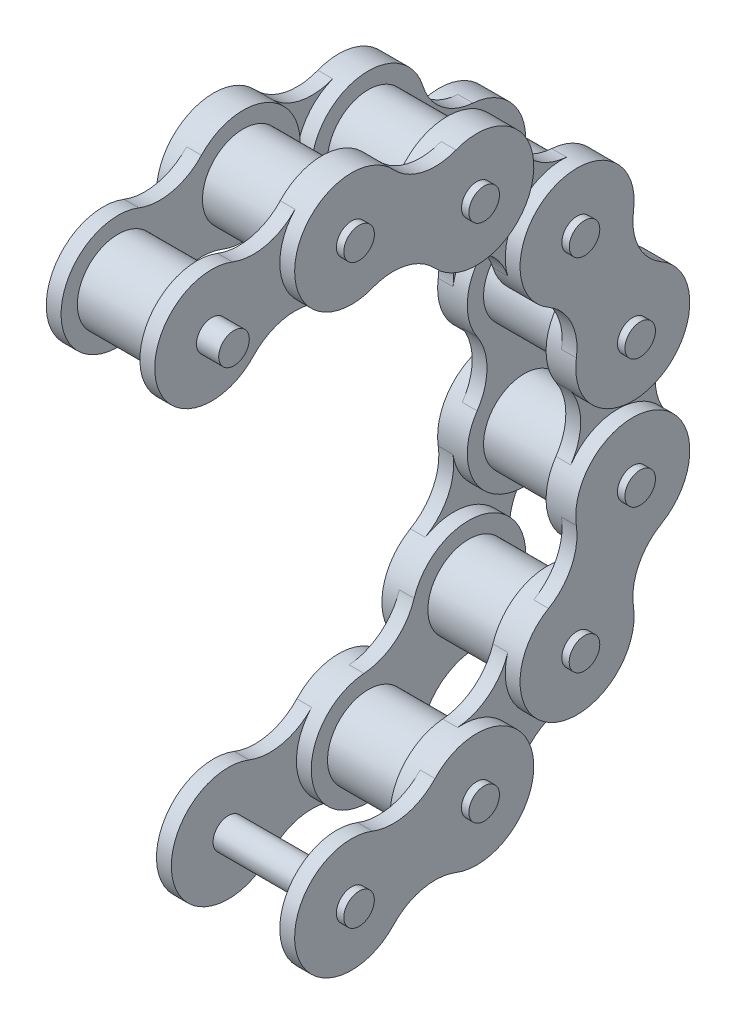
ISO-10303-21;
HEADER;
FILE_DESCRIPTION(('STEP AP214'),'2;1');
FILE_NAME('part.step','',(''),(''),'','','');
FILE_SCHEMA(('AUTOMOTIVE_DESIGN { 1 0 10303 214 1 1 1 1 }'));
ENDSEC;
DATA;
#1=APPLICATION_CONTEXT('core data for automotive mechanical design processes');
#2=APPLICATION_PROTOCOL_DEFINITION('international standard','automotive_design',2000,#1);
#3=PRODUCT_CONTEXT('',#1,'mechanical');
#4=PRODUCT('Part','Part','',(#3));
#5=PRODUCT_RELATED_PRODUCT_CATEGORY('part','',(#4));
#6=PRODUCT_DEFINITION_FORMATION('','',#4);
#7=PRODUCT_DEFINITION_CONTEXT('part definition',#1,'design');
#8=PRODUCT_DEFINITION('design','',#6,#7);
#9=PRODUCT_DEFINITION_SHAPE('','',#8);
#10=(LENGTH_UNIT() NAMED_UNIT(*) SI_UNIT(.MILLI.,.METRE.));
#11=(NAMED_UNIT(*) PLANE_ANGLE_UNIT() SI_UNIT($,.RADIAN.));
#12=(NAMED_UNIT(*) SI_UNIT($,.STERADIAN.) SOLID_ANGLE_UNIT());
#13=UNCERTAINTY_MEASURE_WITH_UNIT(LENGTH_MEASURE(1.E-05),#10,'distance_accuracy_value','');
#14=(GEOMETRIC_REPRESENTATION_CONTEXT(3) GLOBAL_UNCERTAINTY_ASSIGNED_CONTEXT((#13)) GLOBAL_UNIT_ASSIGNED_CONTEXT((#10,
#11,#12)) REPRESENTATION_CONTEXT('',''));
#15=CARTESIAN_POINT('',(0.,0.,0.));
#16=DIRECTION('',(0.,0.,1.));
#17=DIRECTION('',(1.,0.,0.));
#18=AXIS2_PLACEMENT_3D('',#15,#16,#17);
#19=CARTESIAN_POINT('',(5.55,-24.1864200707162,-25.3761696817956));
#20=DIRECTION('',(1.,0.,0.));
#21=DIRECTION('',(0.,0.,-1.));
#22=AXIS2_PLACEMENT_3D('',#19,#20,#21);
#23=PLANE('',#22);
#24=CARTESIAN_POINT('',(5.55,-38.567326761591,-18.5694919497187));
#25=DIRECTION('',(-1.,0.,0.));
#26=DIRECTION('',(0.,0.,1.));
#27=AXIS2_PLACEMENT_3D('',#24,#25,#26);
#28=CIRCLE('',#27,8.467);
#29=CARTESIAN_POINT('',(5.55,-30.1246033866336,-17.9287806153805));
#30=VERTEX_POINT('',#29);
#31=CARTESIAN_POINT('',(5.55,-41.0718668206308,-26.657592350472));
#32=VERTEX_POINT('',#31);
#33=EDGE_CURVE('E1551',#30,#32,#28,.T.);
#34=ORIENTED_EDGE('',*,*,#33,.F.);
#35=CARTESIAN_POINT('',(5.55,-21.6818800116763,-17.2880692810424));
#36=DIRECTION('',(-1.,0.,0.));
#37=DIRECTION('',(0.,0.,-1.));
#38=AXIS2_PLACEMENT_3D('',#35,#36,#37);
#39=CIRCLE('',#38,8.467);
#40=CARTESIAN_POINT('',(5.55,-24.1864200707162,-25.3761696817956));
#41=VERTEX_POINT('',#40);
#42=EDGE_CURVE('E658',#41,#30,#39,.T.);
#43=ORIENTED_EDGE('',*,*,#42,.F.);
#44=CARTESIAN_POINT('',(5.55,-26.6909601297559,-33.4642700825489));
#45=DIRECTION('',(-1.,0.,0.));
#46=DIRECTION('',(0.,0.,1.));
#47=AXIS2_PLACEMENT_3D('',#44,#45,#46);
#48=CIRCLE('',#47,8.467);
#49=CARTESIAN_POINT('',(5.55,-35.1336835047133,-34.104981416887));
#50=VERTEX_POINT('',#49);
#51=EDGE_CURVE('E478',#50,#41,#48,.T.);
#52=ORIENTED_EDGE('',*,*,#51,.F.);
#53=CARTESIAN_POINT('',(5.55,-43.5764068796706,-34.7456927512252));
#54=DIRECTION('',(-1.,0.,0.));
#55=DIRECTION('',(0.,0.,-1.));
#56=AXIS2_PLACEMENT_3D('',#53,#54,#55);
#57=CIRCLE('',#56,8.467);
#58=EDGE_CURVE('E665',#32,#50,#57,.T.);
#59=ORIENTED_EDGE('',*,*,#58,.F.);
#60=EDGE_LOOP('',(#34,#43,#52,#59));
#61=FACE_BOUND('',#60,.T.);
#62=ADVANCED_FACE('F32',(#61),#23,.F.);
#63=CARTESIAN_POINT('',(5.55,4.76076807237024,-34.7313689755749));
#64=DIRECTION('',(1.,0.,0.));
#65=DIRECTION('',(0.,0.,-1.));
#66=AXIS2_PLACEMENT_3D('',#63,#64,#65);
#67=PLANE('',#66);
#68=CARTESIAN_POINT('',(5.55,-9.52708100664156,-41.7312766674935));
#69=DIRECTION('',(-1.,0.,0.));
#70=DIRECTION('',(0.,0.,1.));
#71=AXIS2_PLACEMENT_3D('',#68,#69,#70);
#72=CIRCLE('',#71,8.467);
#73=CARTESIAN_POINT('',(5.55,-4.76423191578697,-34.7308939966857));
#74=VERTEX_POINT('',#73);
#75=CARTESIAN_POINT('',(5.55,-4.76493010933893,-48.7321343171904));
#76=VERTEX_POINT('',#75);
#77=EDGE_CURVE('E457',#74,#76,#72,.T.);
#78=ORIENTED_EDGE('',*,*,#77,.F.);
#79=CARTESIAN_POINT('',(5.55,-0.00138282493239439,-27.730511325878));
#80=DIRECTION('',(-1.,0.,0.));
#81=DIRECTION('',(0.,0.,-1.));
#82=AXIS2_PLACEMENT_3D('',#79,#80,#81);
#83=CIRCLE('',#82,8.467);
#84=CARTESIAN_POINT('',(5.55,4.76076807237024,-34.7313689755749));
#85=VERTEX_POINT('',#84);
#86=EDGE_CURVE('E771',#85,#74,#83,.T.);
#87=ORIENTED_EDGE('',*,*,#86,.F.);
#88=CARTESIAN_POINT('',(5.55,9.52291896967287,-41.7322266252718));
#89=DIRECTION('',(-1.,0.,0.));
#90=DIRECTION('',(0.,0.,1.));
#91=AXIS2_PLACEMENT_3D('',#88,#89,#90);
#92=CIRCLE('',#91,8.467);
#93=CARTESIAN_POINT('',(5.55,4.7600698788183,-48.7326092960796));
#94=VERTEX_POINT('',#93);
#95=EDGE_CURVE('E517',#94,#85,#92,.T.);
#96=ORIENTED_EDGE('',*,*,#95,.F.);
#97=CARTESIAN_POINT('',(5.55,-0.0027792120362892,-55.7329919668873));
#98=DIRECTION('',(-1.,0.,0.));
#99=DIRECTION('',(0.,0.,-1.));
#100=AXIS2_PLACEMENT_3D('',#97,#98,#99);
#101=CIRCLE('',#100,8.46699999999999);
#102=EDGE_CURVE('E778',#76,#94,#101,.T.);
#103=ORIENTED_EDGE('',*,*,#102,.F.);
#104=EDGE_LOOP('',(#78,#87,#96,#103));
#105=FACE_BOUND('',#104,.T.);
#106=ADVANCED_FACE('F1084',(#105),#67,.F.);
#107=CARTESIAN_POINT('',(5.55,30.1228151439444,-17.9317849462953));
#108=DIRECTION('',(1.,0.,0.));
#109=DIRECTION('',(0.,0.,-1.));
#110=AXIS2_PLACEMENT_3D('',#107,#108,#109);
#111=PLANE('',#110);
#112=CARTESIAN_POINT('',(5.55,26.6876225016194,-33.4669318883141));
#113=DIRECTION('',(-1.,0.,0.));
#114=DIRECTION('',(0.,0.,1.));
#115=AXIS2_PLACEMENT_3D('',#112,#113,#114);
#116=CIRCLE('',#115,8.467);
#117=CARTESIAN_POINT('',(5.55,24.1838891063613,-25.3785817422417));
#118=VERTEX_POINT('',#117);
#119=CARTESIAN_POINT('',(5.55,35.1302819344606,-34.1084852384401));
#120=VERTEX_POINT('',#119);
#121=EDGE_CURVE('E496',#118,#120,#116,.T.);
#122=ORIENTED_EDGE('',*,*,#121,.F.);
#123=CARTESIAN_POINT('',(5.55,21.6801557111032,-17.2902315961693));
#124=DIRECTION('',(-1.,0.,0.));
#125=DIRECTION('',(0.,0.,-1.));
#126=AXIS2_PLACEMENT_3D('',#123,#124,#125);
#127=CIRCLE('',#126,8.467);
#128=CARTESIAN_POINT('',(5.55,30.1228151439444,-17.9317849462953));
#129=VERTEX_POINT('',#128);
#130=EDGE_CURVE('E1003',#129,#118,#127,.T.);
#131=ORIENTED_EDGE('',*,*,#130,.F.);
#132=CARTESIAN_POINT('',(5.55,38.5654745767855,-18.5733382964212));
#133=DIRECTION('',(-1.,0.,0.));
#134=DIRECTION('',(0.,0.,1.));
#135=AXIS2_PLACEMENT_3D('',#132,#133,#134);
#136=CIRCLE('',#135,8.467);
#137=CARTESIAN_POINT('',(5.55,41.0692079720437,-26.6616884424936));
#138=VERTEX_POINT('',#137);
#139=EDGE_CURVE('E553',#138,#129,#136,.T.);
#140=ORIENTED_EDGE('',*,*,#139,.F.);
#141=CARTESIAN_POINT('',(5.55,43.5729413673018,-34.750038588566));
#142=DIRECTION('',(-1.,0.,0.));
#143=DIRECTION('',(0.,0.,-1.));
#144=AXIS2_PLACEMENT_3D('',#141,#142,#143);
#145=CIRCLE('',#144,8.46699999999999);
#146=EDGE_CURVE('E1010',#120,#138,#145,.T.);
#147=ORIENTED_EDGE('',*,*,#146,.F.);
#148=EDGE_LOOP('',(#122,#131,#140,#147));
#149=FACE_BOUND('',#148,.T.);
#150=ADVANCED_FACE('F1090',(#149),#111,.F.);
#151=CARTESIAN_POINT('',(5.55,32.8005936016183,12.3714980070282));
#152=DIRECTION('',(1.,0.,0.));
#153=DIRECTION('',(0.,0.,-1.));
#154=AXIS2_PLACEMENT_3D('',#151,#152,#153);
#155=PLANE('',#154);
#156=CARTESIAN_POINT('',(5.55,38.56593765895,18.5723767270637));
#157=DIRECTION('',(1.,0.,0.));
#158=DIRECTION('',(0.,0.,-1.));
#159=AXIS2_PLACEMENT_3D('',#156,#157,#158);
#160=CIRCLE('',#159,2.269);
#161=CARTESIAN_POINT('',(5.55,38.56593765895,16.3033767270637));
#162=VERTEX_POINT('',#161);
#163=EDGE_CURVE('E847',#162,#162,#160,.T.);
#164=ORIENTED_EDGE('',*,*,#163,.T.);
#165=EDGE_LOOP('',(#164));
#166=FACE_BOUND('',#165,.T.);
#167=CARTESIAN_POINT('',(5.55,42.8049614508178,0.));
#168=DIRECTION('',(-1.,0.,0.));
#169=DIRECTION('',(0.,0.,1.));
#170=AXIS2_PLACEMENT_3D('',#167,#168,#169);
#171=CIRCLE('',#170,8.467);
#172=CARTESIAN_POINT('',(5.55,34.9201054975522,3.08530964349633));
#173=VERTEX_POINT('',#172);
#174=CARTESIAN_POINT('',(5.55,48.5703055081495,6.20087872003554));
#175=VERTEX_POINT('',#174);
#176=EDGE_CURVE('E544',#173,#175,#171,.T.);
#177=ORIENTED_EDGE('',*,*,#176,.F.);
#178=CARTESIAN_POINT('',(5.55,27.0352495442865,6.17061928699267));
#179=DIRECTION('',(-1.,0.,0.));
#180=DIRECTION('',(0.,0.,-1.));
#181=AXIS2_PLACEMENT_3D('',#178,#179,#180);
#182=CIRCLE('',#181,8.467);
#183=CARTESIAN_POINT('',(5.55,32.8005936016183,12.3714980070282));
#184=VERTEX_POINT('',#183);
#185=EDGE_CURVE('E889',#184,#173,#182,.T.);
#186=ORIENTED_EDGE('',*,*,#185,.F.);
#187=CARTESIAN_POINT('',(5.55,38.56593765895,18.5723767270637));
#188=DIRECTION('',(1.,0.,0.));
#189=DIRECTION('',(0.,0.,-1.));
#190=AXIS2_PLACEMENT_3D('',#187,#188,#189);
#191=CIRCLE('',#190,8.467);
#192=CARTESIAN_POINT('',(5.55,46.4507936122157,15.4870670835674));
#193=VERTEX_POINT('',#192);
#194=EDGE_CURVE('E896',#193,#184,#191,.T.);
#195=ORIENTED_EDGE('',*,*,#194,.F.);
#196=CARTESIAN_POINT('',(5.55,54.3356495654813,12.4017574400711));
#197=DIRECTION('',(-1.,0.,0.));
#198=DIRECTION('',(0.,0.,-1.));
#199=AXIS2_PLACEMENT_3D('',#196,#197,#198);
#200=CIRCLE('',#199,8.467);
#201=EDGE_CURVE('E905',#175,#193,#200,.T.);
#202=ORIENTED_EDGE('',*,*,#201,.F.);
#203=EDGE_LOOP('',(#177,#186,#195,#202));
#204=FACE_BOUND('',#203,.T.);
#205=ADVANCED_FACE('F1295',(#166,#204),#155,.F.);
#206=CARTESIAN_POINT('',(21.654,-24.1864200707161,-25.3761696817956));
#207=DIRECTION('',(1.,0.,0.));
#208=DIRECTION('',(0.,0.,-1.));
#209=AXIS2_PLACEMENT_3D('',#206,#207,#208);
#210=PLANE('',#209);
#211=CARTESIAN_POINT('',(21.654,-21.6818800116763,-17.2880692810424));
#212=DIRECTION('',(-1.,0.,0.));
#213=DIRECTION('',(0.,0.,-1.));
#214=AXIS2_PLACEMENT_3D('',#211,#212,#213);
#215=CIRCLE('',#214,8.467);
#216=CARTESIAN_POINT('',(21.654,-24.1864200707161,-25.3761696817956));
#217=VERTEX_POINT('',#216);
#218=CARTESIAN_POINT('',(21.654,-30.1246033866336,-17.9287806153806));
#219=VERTEX_POINT('',#218);
#220=EDGE_CURVE('E622',#217,#219,#215,.T.);
#221=ORIENTED_EDGE('',*,*,#220,.T.);
#222=CARTESIAN_POINT('',(21.654,-38.5673267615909,-18.5694919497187));
#223=DIRECTION('',(1.,0.,0.));
#224=DIRECTION('',(0.,0.,-1.));
#225=AXIS2_PLACEMENT_3D('',#222,#223,#224);
#226=CIRCLE('',#225,8.467);
#227=CARTESIAN_POINT('',(21.654,-41.0718668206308,-26.657592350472));
#228=VERTEX_POINT('',#227);
#229=EDGE_CURVE('E592',#228,#219,#226,.T.);
#230=ORIENTED_EDGE('',*,*,#229,.F.);
#231=CARTESIAN_POINT('',(21.654,-43.5764068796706,-34.7456927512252));
#232=DIRECTION('',(-1.,0.,0.));
#233=DIRECTION('',(0.,0.,-1.));
#234=AXIS2_PLACEMENT_3D('',#231,#232,#233);
#235=CIRCLE('',#234,8.467);
#236=CARTESIAN_POINT('',(21.654,-35.1336835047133,-34.1049814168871));
#237=VERTEX_POINT('',#236);
#238=EDGE_CURVE('E624',#228,#237,#235,.T.);
#239=ORIENTED_EDGE('',*,*,#238,.T.);
#240=CARTESIAN_POINT('',(21.654,-26.6909601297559,-33.4642700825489));
#241=DIRECTION('',(1.,0.,0.));
#242=DIRECTION('',(0.,0.,-1.));
#243=AXIS2_PLACEMENT_3D('',#240,#241,#242);
#244=CIRCLE('',#243,8.467);
#245=EDGE_CURVE('E687',#217,#237,#244,.T.);
#246=ORIENTED_EDGE('',*,*,#245,.F.);
#247=EDGE_LOOP('',(#221,#230,#239,#246));
#248=FACE_BOUND('',#247,.T.);
#249=ADVANCED_FACE('F1122',(#248),#210,.T.);
#250=CARTESIAN_POINT('',(21.654,-25.4377619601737,-41.8380137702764));
#251=DIRECTION('',(1.,0.,0.));
#252=DIRECTION('',(0.,0.,-1.));
#253=AXIS2_PLACEMENT_3D('',#250,#251,#252);
#254=PLANE('',#253);
#255=CARTESIAN_POINT('',(21.654,-26.6909601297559,-33.4642700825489));
#256=DIRECTION('',(1.,0.,0.));
#257=DIRECTION('',(0.,0.,-1.));
#258=AXIS2_PLACEMENT_3D('',#255,#256,#257);
#259=CIRCLE('',#258,8.467);
#260=CARTESIAN_POINT('',(21.654,-25.4377619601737,-41.8380137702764));
#261=VERTEX_POINT('',#260);
#262=CARTESIAN_POINT('',(21.654,-19.362218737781,-29.2240296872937));
#263=VERTEX_POINT('',#262);
#264=EDGE_CURVE('E627',#261,#263,#259,.T.);
#265=ORIENTED_EDGE('',*,*,#264,.T.);
#266=CARTESIAN_POINT('',(21.654,-12.0334773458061,-24.9837892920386));
#267=DIRECTION('',(-1.,0.,0.));
#268=DIRECTION('',(0.,0.,-1.));
#269=AXIS2_PLACEMENT_3D('',#266,#267,#268);
#270=CIRCLE('',#269,8.467);
#271=CARTESIAN_POINT('',(21.654,-10.7802791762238,-33.357532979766));
#272=VERTEX_POINT('',#271);
#273=EDGE_CURVE('E695',#272,#263,#270,.T.);
#274=ORIENTED_EDGE('',*,*,#273,.F.);
#275=CARTESIAN_POINT('',(21.654,-9.52708100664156,-41.7312766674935));
#276=DIRECTION('',(1.,0.,0.));
#277=DIRECTION('',(0.,0.,-1.));
#278=AXIS2_PLACEMENT_3D('',#275,#276,#277);
#279=CIRCLE('',#278,8.46700000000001);
#280=CARTESIAN_POINT('',(21.654,-16.8558223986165,-45.9715170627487));
#281=VERTEX_POINT('',#280);
#282=EDGE_CURVE('E720',#272,#281,#279,.T.);
#283=ORIENTED_EDGE('',*,*,#282,.T.);
#284=CARTESIAN_POINT('',(21.654,-24.1845637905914,-50.2117574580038));
#285=DIRECTION('',(-1.,0.,0.));
#286=DIRECTION('',(0.,0.,-1.));
#287=AXIS2_PLACEMENT_3D('',#284,#285,#286);
#288=CIRCLE('',#287,8.467);
#289=EDGE_CURVE('E690',#261,#281,#288,.T.);
#290=ORIENTED_EDGE('',*,*,#289,.F.);
#291=EDGE_LOOP('',(#265,#274,#283,#290));
#292=FACE_BOUND('',#291,.T.);
#293=ADVANCED_FACE('F1118',(#292),#254,.F.);
#294=CARTESIAN_POINT('',(21.654,4.76076807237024,-34.7313689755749));
#295=DIRECTION('',(1.,0.,0.));
#296=DIRECTION('',(0.,0.,-1.));
#297=AXIS2_PLACEMENT_3D('',#294,#295,#296);
#298=PLANE('',#297);
#299=CARTESIAN_POINT('',(21.654,-0.0013828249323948,-27.730511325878));
#300=DIRECTION('',(-1.,0.,0.));
#301=DIRECTION('',(0.,0.,-1.));
#302=AXIS2_PLACEMENT_3D('',#299,#300,#301);
#303=CIRCLE('',#302,8.467);
#304=CARTESIAN_POINT('',(21.654,4.76076807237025,-34.7313689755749));
#305=VERTEX_POINT('',#304);
#306=CARTESIAN_POINT('',(21.654,-4.76423191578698,-34.7308939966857));
#307=VERTEX_POINT('',#306);
#308=EDGE_CURVE('E735',#305,#307,#303,.T.);
#309=ORIENTED_EDGE('',*,*,#308,.T.);
#310=CARTESIAN_POINT('',(21.654,-9.52708100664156,-41.7312766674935));
#311=DIRECTION('',(1.,0.,0.));
#312=DIRECTION('',(0.,0.,-1.));
#313=AXIS2_PLACEMENT_3D('',#310,#311,#312);
#314=CIRCLE('',#313,8.467);
#315=CARTESIAN_POINT('',(21.654,-4.76493010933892,-48.7321343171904));
#316=VERTEX_POINT('',#315);
#317=EDGE_CURVE('E704',#316,#307,#314,.T.);
#318=ORIENTED_EDGE('',*,*,#317,.F.);
#319=CARTESIAN_POINT('',(21.654,-0.00277921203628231,-55.7329919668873));
#320=DIRECTION('',(-1.,0.,0.));
#321=DIRECTION('',(0.,0.,-1.));
#322=AXIS2_PLACEMENT_3D('',#319,#320,#321);
#323=CIRCLE('',#322,8.467);
#324=CARTESIAN_POINT('',(21.654,4.7600698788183,-48.7326092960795));
#325=VERTEX_POINT('',#324);
#326=EDGE_CURVE('E737',#316,#325,#323,.T.);
#327=ORIENTED_EDGE('',*,*,#326,.T.);
#328=CARTESIAN_POINT('',(21.654,9.52291896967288,-41.7322266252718));
#329=DIRECTION('',(1.,0.,0.));
#330=DIRECTION('',(0.,0.,-1.));
#331=AXIS2_PLACEMENT_3D('',#328,#329,#330);
#332=CIRCLE('',#331,8.467);
#333=EDGE_CURVE('E800',#305,#325,#332,.T.);
#334=ORIENTED_EDGE('',*,*,#333,.F.);
#335=EDGE_LOOP('',(#309,#318,#327,#334));
#336=FACE_BOUND('',#335,.T.);
#337=ADVANCED_FACE('F1121',(#336),#298,.T.);
#338=CARTESIAN_POINT('',(21.654,16.8512374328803,-45.9731979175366));
#339=DIRECTION('',(1.,0.,0.));
#340=DIRECTION('',(0.,0.,-1.));
#341=AXIS2_PLACEMENT_3D('',#338,#339,#340);
#342=PLANE('',#341);
#343=CARTESIAN_POINT('',(21.654,9.52291896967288,-41.7322266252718));
#344=DIRECTION('',(1.,0.,0.));
#345=DIRECTION('',(0.,0.,-1.));
#346=AXIS2_PLACEMENT_3D('',#343,#344,#345);
#347=CIRCLE('',#346,8.467);
#348=CARTESIAN_POINT('',(21.654,16.8512374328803,-45.9731979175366));
#349=VERTEX_POINT('',#348);
#350=CARTESIAN_POINT('',(21.654,10.7769522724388,-33.3586079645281));
#351=VERTEX_POINT('',#350);
#352=EDGE_CURVE('E740',#349,#351,#347,.T.);
#353=ORIENTED_EDGE('',*,*,#352,.T.);
#354=CARTESIAN_POINT('',(21.654,12.0309855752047,-24.9849893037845));
#355=DIRECTION('',(-1.,0.,0.));
#356=DIRECTION('',(0.,0.,-1.));
#357=AXIS2_PLACEMENT_3D('',#354,#355,#356);
#358=CIRCLE('',#357,8.467);
#359=CARTESIAN_POINT('',(21.654,19.3593040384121,-29.2259605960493));
#360=VERTEX_POINT('',#359);
#361=EDGE_CURVE('E808',#360,#351,#358,.T.);
#362=ORIENTED_EDGE('',*,*,#361,.F.);
#363=CARTESIAN_POINT('',(21.654,26.6876225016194,-33.4669318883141));
#364=DIRECTION('',(1.,0.,0.));
#365=DIRECTION('',(0.,0.,-1.));
#366=AXIS2_PLACEMENT_3D('',#363,#364,#365);
#367=CIRCLE('',#366,8.467);
#368=CARTESIAN_POINT('',(21.654,25.4335891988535,-41.8405505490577));
#369=VERTEX_POINT('',#368);
#370=EDGE_CURVE('E833',#360,#369,#367,.T.);
#371=ORIENTED_EDGE('',*,*,#370,.T.);
#372=CARTESIAN_POINT('',(21.654,24.1795558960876,-50.2141692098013));
#373=DIRECTION('',(-1.,0.,0.));
#374=DIRECTION('',(0.,0.,-1.));
#375=AXIS2_PLACEMENT_3D('',#372,#373,#374);
#376=CIRCLE('',#375,8.467);
#377=EDGE_CURVE('E803',#349,#369,#376,.T.);
#378=ORIENTED_EDGE('',*,*,#377,.F.);
#379=EDGE_LOOP('',(#353,#362,#371,#378));
#380=FACE_BOUND('',#379,.T.);
#381=ADVANCED_FACE('F1168',(#380),#342,.F.);
#382=CARTESIAN_POINT('',(21.654,30.1228151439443,-17.9317849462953));
#383=DIRECTION('',(1.,0.,0.));
#384=DIRECTION('',(0.,0.,-1.));
#385=AXIS2_PLACEMENT_3D('',#382,#383,#384);
#386=PLANE('',#385);
#387=CARTESIAN_POINT('',(21.654,21.6801557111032,-17.2902315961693));
#388=DIRECTION('',(-1.,0.,0.));
#389=DIRECTION('',(0.,0.,-1.));
#390=AXIS2_PLACEMENT_3D('',#387,#388,#389);
#391=CIRCLE('',#390,8.467);
#392=CARTESIAN_POINT('',(21.654,30.1228151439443,-17.9317849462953));
#393=VERTEX_POINT('',#392);
#394=CARTESIAN_POINT('',(21.654,24.1838891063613,-25.3785817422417));
#395=VERTEX_POINT('',#394);
#396=EDGE_CURVE('E968',#393,#395,#391,.T.);
#397=ORIENTED_EDGE('',*,*,#396,.T.);
#398=CARTESIAN_POINT('',(21.654,26.6876225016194,-33.4669318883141));
#399=DIRECTION('',(1.,0.,0.));
#400=DIRECTION('',(0.,0.,-1.));
#401=AXIS2_PLACEMENT_3D('',#398,#399,#400);
#402=CIRCLE('',#401,8.467);
#403=CARTESIAN_POINT('',(21.654,35.1302819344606,-34.10848523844));
#404=VERTEX_POINT('',#403);
#405=EDGE_CURVE('E817',#404,#395,#402,.T.);
#406=ORIENTED_EDGE('',*,*,#405,.F.);
#407=CARTESIAN_POINT('',(21.654,43.5729413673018,-34.750038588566));
#408=DIRECTION('',(-1.,0.,0.));
#409=DIRECTION('',(0.,0.,-1.));
#410=AXIS2_PLACEMENT_3D('',#407,#408,#409);
#411=CIRCLE('',#410,8.467);
#412=CARTESIAN_POINT('',(21.654,41.0692079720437,-26.6616884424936));
#413=VERTEX_POINT('',#412);
#414=EDGE_CURVE('E970',#404,#413,#411,.T.);
#415=ORIENTED_EDGE('',*,*,#414,.T.);
#416=CARTESIAN_POINT('',(21.654,38.5654745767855,-18.5733382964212));
#417=DIRECTION('',(1.,0.,0.));
#418=DIRECTION('',(0.,0.,-1.));
#419=AXIS2_PLACEMENT_3D('',#416,#417,#418);
#420=CIRCLE('',#419,8.467);
#421=EDGE_CURVE('E936',#393,#413,#420,.T.);
#422=ORIENTED_EDGE('',*,*,#421,.F.);
#423=EDGE_LOOP('',(#397,#406,#415,#422));
#424=FACE_BOUND('',#423,.T.);
#425=ADVANCED_FACE('F1220',(#424),#386,.T.);
#426=CARTESIAN_POINT('',(21.654,34.9201816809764,-3.08550433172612));
#427=DIRECTION('',(1.,0.,0.));
#428=DIRECTION('',(0.,0.,-1.));
#429=AXIS2_PLACEMENT_3D('',#426,#427,#428);
#430=PLANE('',#429);
#431=CARTESIAN_POINT('',(21.654,42.8049614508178,0.));
#432=DIRECTION('',(1.,0.,0.));
#433=DIRECTION('',(0.,0.,-1.));
#434=AXIS2_PLACEMENT_3D('',#431,#432,#433);
#435=CIRCLE('',#434,8.46700000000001);
#436=CARTESIAN_POINT('',(21.654,34.9201816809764,-3.08550433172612));
#437=VERTEX_POINT('',#436);
#438=CARTESIAN_POINT('',(21.654,48.569997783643,-6.2011648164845));
#439=VERTEX_POINT('',#438);
#440=EDGE_CURVE('E853',#437,#439,#435,.T.);
#441=ORIENTED_EDGE('',*,*,#440,.T.);
#442=CARTESIAN_POINT('',(21.654,54.3350341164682,-12.402329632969));
#443=DIRECTION('',(-1.,0.,0.));
#444=DIRECTION('',(0.,0.,-1.));
#445=AXIS2_PLACEMENT_3D('',#442,#443,#444);
#446=CIRCLE('',#445,8.467);
#447=CARTESIAN_POINT('',(21.654,46.4502543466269,-15.4878339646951));
#448=VERTEX_POINT('',#447);
#449=EDGE_CURVE('E938',#448,#439,#446,.T.);
#450=ORIENTED_EDGE('',*,*,#449,.F.);
#451=CARTESIAN_POINT('',(21.654,38.5654745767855,-18.5733382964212));
#452=DIRECTION('',(1.,0.,0.));
#453=DIRECTION('',(0.,0.,-1.));
#454=AXIS2_PLACEMENT_3D('',#451,#452,#453);
#455=CIRCLE('',#454,8.467);
#456=CARTESIAN_POINT('',(21.654,32.8004382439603,-12.3721734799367));
#457=VERTEX_POINT('',#456);
#458=EDGE_CURVE('E953',#448,#457,#455,.T.);
#459=ORIENTED_EDGE('',*,*,#458,.T.);
#460=CARTESIAN_POINT('',(21.654,27.0354019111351,-6.17100866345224));
#461=DIRECTION('',(-1.,0.,0.));
#462=DIRECTION('',(0.,0.,-1.));
#463=AXIS2_PLACEMENT_3D('',#460,#461,#462);
#464=CIRCLE('',#463,8.467);
#465=EDGE_CURVE('E922',#437,#457,#464,.T.);
#466=ORIENTED_EDGE('',*,*,#465,.F.);
#467=EDGE_LOOP('',(#441,#450,#459,#466));
#468=FACE_BOUND('',#467,.T.);
#469=ADVANCED_FACE('F1319',(#468),#430,.F.);
#470=CARTESIAN_POINT('',(7.752,30.1228151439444,-17.9317849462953));
#471=DIRECTION('',(1.,0.,0.));
#472=DIRECTION('',(0.,0.,-1.));
#473=AXIS2_PLACEMENT_3D('',#470,#471,#472);
#474=PLANE('',#473);
#475=CARTESIAN_POINT('',(7.752,38.5654745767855,-18.5733382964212));
#476=DIRECTION('',(1.,0.,0.));
#477=DIRECTION('',(0.,0.,-1.));
#478=AXIS2_PLACEMENT_3D('',#475,#476,#477);
#479=CIRCLE('',#478,6.05);
#480=CARTESIAN_POINT('',(7.752,38.5654745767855,-24.6233382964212));
#481=VERTEX_POINT('',#480);
#482=EDGE_CURVE('E997',#481,#481,#479,.T.);
#483=ORIENTED_EDGE('',*,*,#482,.F.);
#484=EDGE_LOOP('',(#483));
#485=FACE_BOUND('',#484,.T.);
#486=CARTESIAN_POINT('',(7.752,21.6801557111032,-17.2902315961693));
#487=DIRECTION('',(-1.,0.,0.));
#488=DIRECTION('',(0.,0.,-1.));
#489=AXIS2_PLACEMENT_3D('',#486,#487,#488);
#490=CIRCLE('',#489,8.467);
#491=CARTESIAN_POINT('',(7.752,30.1228151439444,-17.9317849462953));
#492=VERTEX_POINT('',#491);
#493=CARTESIAN_POINT('',(7.752,24.1838891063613,-25.3785817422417));
#494=VERTEX_POINT('',#493);
#495=EDGE_CURVE('E1006',#492,#494,#490,.T.);
#496=ORIENTED_EDGE('',*,*,#495,.T.);
#497=CARTESIAN_POINT('',(7.752,26.6876225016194,-33.4669318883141));
#498=DIRECTION('',(1.,0.,0.));
#499=DIRECTION('',(0.,0.,-1.));
#500=AXIS2_PLACEMENT_3D('',#497,#498,#499);
#501=CIRCLE('',#500,8.46700000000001);
#502=CARTESIAN_POINT('',(7.752,35.1302819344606,-34.1084852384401));
#503=VERTEX_POINT('',#502);
#504=EDGE_CURVE('E1009',#494,#503,#501,.T.);
#505=ORIENTED_EDGE('',*,*,#504,.T.);
#506=CARTESIAN_POINT('',(7.752,43.5729413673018,-34.750038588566));
#507=DIRECTION('',(-1.,0.,0.));
#508=DIRECTION('',(0.,0.,-1.));
#509=AXIS2_PLACEMENT_3D('',#506,#507,#508);
#510=CIRCLE('',#509,8.46699999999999);
#511=CARTESIAN_POINT('',(7.752,41.0692079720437,-26.6616884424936));
#512=VERTEX_POINT('',#511);
#513=EDGE_CURVE('E1012',#503,#512,#510,.T.);
#514=ORIENTED_EDGE('',*,*,#513,.T.);
#515=CARTESIAN_POINT('',(7.752,38.5654745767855,-18.5733382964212));
#516=DIRECTION('',(1.,0.,0.));
#517=DIRECTION('',(0.,0.,-1.));
#518=AXIS2_PLACEMENT_3D('',#515,#516,#517);
#519=CIRCLE('',#518,8.46700000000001);
#520=EDGE_CURVE('E1014',#512,#492,#519,.T.);
#521=ORIENTED_EDGE('',*,*,#520,.T.);
#522=EDGE_LOOP('',(#496,#505,#514,#521));
#523=FACE_BOUND('',#522,.T.);
#524=CARTESIAN_POINT('',(7.752,26.6876225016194,-33.4669318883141));
#525=DIRECTION('',(1.,0.,0.));
#526=DIRECTION('',(0.,0.,-1.));
#527=AXIS2_PLACEMENT_3D('',#524,#525,#526);
#528=CIRCLE('',#527,6.05);
#529=CARTESIAN_POINT('',(7.752,26.6876225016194,-39.5169318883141));
#530=VERTEX_POINT('',#529);
#531=EDGE_CURVE('E993',#530,#530,#528,.T.);
#532=ORIENTED_EDGE('',*,*,#531,.F.);
#533=EDGE_LOOP('',(#532));
#534=FACE_BOUND('',#533,.T.);
#535=ADVANCED_FACE('F1322',(#485,#523,#534),#474,.T.);
#536=CARTESIAN_POINT('',(7.752,21.6801557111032,-17.2902315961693));
#537=DIRECTION('',(-1.,0.,0.));
#538=DIRECTION('',(0.,0.,1.));
#539=AXIS2_PLACEMENT_3D('',#536,#537,#538);
#540=CYLINDRICAL_SURFACE('',#539,8.467);
#541=ORIENTED_EDGE('',*,*,#130,.T.);
#542=DIRECTION('',(-1.,0.,0.));
#543=VECTOR('',#542,1.);
#544=CARTESIAN_POINT('',(7.752,24.1838891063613,-25.3785817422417));
#545=LINE('',#544,#543);
#546=EDGE_CURVE('E1029',#494,#118,#545,.T.);
#547=ORIENTED_EDGE('',*,*,#546,.F.);
#548=ORIENTED_EDGE('',*,*,#495,.F.);
#549=DIRECTION('',(-1.,0.,0.));
#550=VECTOR('',#549,1.);
#551=CARTESIAN_POINT('',(7.752,30.1228151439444,-17.9317849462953));
#552=LINE('',#551,#550);
#553=EDGE_CURVE('E1016',#492,#129,#552,.T.);
#554=ORIENTED_EDGE('',*,*,#553,.T.);
#555=EDGE_LOOP('',(#541,#547,#548,#554));
#556=FACE_BOUND('',#555,.T.);
#557=ADVANCED_FACE('F34',(#556),#540,.F.);
#558=CARTESIAN_POINT('',(7.752,26.6876225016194,-33.4669318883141));
#559=DIRECTION('',(-1.,0.,0.));
#560=DIRECTION('',(0.,0.,1.));
#561=AXIS2_PLACEMENT_3D('',#558,#559,#560);
#562=CYLINDRICAL_SURFACE('',#561,8.46700000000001);
#563=DIRECTION('',(1.,0.,0.));
#564=VECTOR('',#563,1.);
#565=CARTESIAN_POINT('',(3.348,19.3593040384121,-29.2259605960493));
#566=LINE('',#565,#564);
#567=CARTESIAN_POINT('',(3.348,19.3593040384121,-29.2259605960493));
#568=VERTEX_POINT('',#567);
#569=CARTESIAN_POINT('',(5.55,19.3593040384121,-29.2259605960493));
#570=VERTEX_POINT('',#569);
#571=EDGE_CURVE('E512',#568,#570,#566,.T.);
#572=ORIENTED_EDGE('',*,*,#571,.T.);
#573=CARTESIAN_POINT('',(5.55,26.6876225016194,-33.4669318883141));
#574=DIRECTION('',(-1.,0.,0.));
#575=DIRECTION('',(0.,0.,1.));
#576=AXIS2_PLACEMENT_3D('',#573,#574,#575);
#577=CIRCLE('',#576,8.46700000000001);
#578=CARTESIAN_POINT('',(5.55,25.4335891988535,-41.8405505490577));
#579=VERTEX_POINT('',#578);
#580=EDGE_CURVE('E533',#579,#570,#577,.T.);
#581=ORIENTED_EDGE('',*,*,#580,.F.);
#582=DIRECTION('',(1.,0.,0.));
#583=VECTOR('',#582,1.);
#584=CARTESIAN_POINT('',(3.348,25.4335891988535,-41.8405505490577));
#585=LINE('',#584,#583);
#586=CARTESIAN_POINT('',(3.348,25.4335891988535,-41.8405505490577));
#587=VERTEX_POINT('',#586);
#588=EDGE_CURVE('E528',#587,#579,#585,.T.);
#589=ORIENTED_EDGE('',*,*,#588,.F.);
#590=CARTESIAN_POINT('',(3.348,26.6876225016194,-33.4669318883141));
#591=DIRECTION('',(-1.,0.,0.));
#592=DIRECTION('',(0.,0.,1.));
#593=AXIS2_PLACEMENT_3D('',#590,#591,#592);
#594=CIRCLE('',#593,8.467);
#595=EDGE_CURVE('E502',#568,#587,#594,.T.);
#596=ORIENTED_EDGE('',*,*,#595,.F.);
#597=EDGE_LOOP('',(#572,#581,#589,#596));
#598=FACE_BOUND('',#597,.T.);
#599=ORIENTED_EDGE('',*,*,#546,.T.);
#600=ORIENTED_EDGE('',*,*,#121,.T.);
#601=DIRECTION('',(-1.,0.,0.));
#602=VECTOR('',#601,1.);
#603=CARTESIAN_POINT('',(7.752,35.1302819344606,-34.1084852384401));
#604=LINE('',#603,#602);
#605=EDGE_CURVE('E1026',#503,#120,#604,.T.);
#606=ORIENTED_EDGE('',*,*,#605,.F.);
#607=ORIENTED_EDGE('',*,*,#504,.F.);
#608=EDGE_LOOP('',(#599,#600,#606,#607));
#609=FACE_BOUND('',#608,.T.);
#610=ADVANCED_FACE('F1399',(#598,#609),#562,.T.);
#611=CARTESIAN_POINT('',(7.752,43.5729413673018,-34.750038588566));
#612=DIRECTION('',(-1.,0.,0.));
#613=DIRECTION('',(0.,0.,1.));
#614=AXIS2_PLACEMENT_3D('',#611,#612,#613);
#615=CYLINDRICAL_SURFACE('',#614,8.46699999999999);
#616=ORIENTED_EDGE('',*,*,#146,.T.);
#617=DIRECTION('',(-1.,0.,0.));
#618=VECTOR('',#617,1.);
#619=CARTESIAN_POINT('',(7.752,41.0692079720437,-26.6616884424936));
#620=LINE('',#619,#618);
#621=EDGE_CURVE('E1023',#512,#138,#620,.T.);
#622=ORIENTED_EDGE('',*,*,#621,.F.);
#623=ORIENTED_EDGE('',*,*,#513,.F.);
#624=ORIENTED_EDGE('',*,*,#605,.T.);
#625=EDGE_LOOP('',(#616,#622,#623,#624));
#626=FACE_BOUND('',#625,.T.);
#627=ADVANCED_FACE('F1397',(#626),#615,.F.);
#628=CARTESIAN_POINT('',(7.752,38.5654745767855,-18.5733382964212));
#629=DIRECTION('',(-1.,0.,0.));
#630=DIRECTION('',(0.,0.,1.));
#631=AXIS2_PLACEMENT_3D('',#628,#629,#630);
#632=CYLINDRICAL_SURFACE('',#631,8.46700000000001);
#633=DIRECTION('',(1.,0.,0.));
#634=VECTOR('',#633,1.);
#635=CARTESIAN_POINT('',(3.348,46.4502543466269,-15.4878339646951));
#636=LINE('',#635,#634);
#637=CARTESIAN_POINT('',(3.348,46.4502543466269,-15.4878339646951));
#638=VERTEX_POINT('',#637);
#639=CARTESIAN_POINT('',(5.55,46.4502543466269,-15.4878339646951));
#640=VERTEX_POINT('',#639);
#641=EDGE_CURVE('E566',#638,#640,#636,.T.);
#642=ORIENTED_EDGE('',*,*,#641,.T.);
#643=CARTESIAN_POINT('',(5.55,38.5654745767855,-18.5733382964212));
#644=DIRECTION('',(-1.,0.,0.));
#645=DIRECTION('',(0.,0.,1.));
#646=AXIS2_PLACEMENT_3D('',#643,#644,#645);
#647=CIRCLE('',#646,8.46700000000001);
#648=CARTESIAN_POINT('',(5.55,32.8004382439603,-12.3721734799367));
#649=VERTEX_POINT('',#648);
#650=EDGE_CURVE('E56',#649,#640,#647,.T.);
#651=ORIENTED_EDGE('',*,*,#650,.F.);
#652=DIRECTION('',(1.,0.,0.));
#653=VECTOR('',#652,1.);
#654=CARTESIAN_POINT('',(3.348,32.8004382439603,-12.3721734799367));
#655=LINE('',#654,#653);
#656=CARTESIAN_POINT('',(3.348,32.8004382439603,-12.3721734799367));
#657=VERTEX_POINT('',#656);
#658=EDGE_CURVE('E564',#657,#649,#655,.T.);
#659=ORIENTED_EDGE('',*,*,#658,.F.);
#660=CARTESIAN_POINT('',(3.348,38.5654745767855,-18.5733382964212));
#661=DIRECTION('',(-1.,0.,0.));
#662=DIRECTION('',(0.,0.,1.));
#663=AXIS2_PLACEMENT_3D('',#660,#661,#662);
#664=CIRCLE('',#663,8.467);
#665=EDGE_CURVE('E543',#638,#657,#664,.T.);
#666=ORIENTED_EDGE('',*,*,#665,.F.);
#667=EDGE_LOOP('',(#642,#651,#659,#666));
#668=FACE_BOUND('',#667,.T.);
#669=ORIENTED_EDGE('',*,*,#621,.T.);
#670=ORIENTED_EDGE('',*,*,#139,.T.);
#671=ORIENTED_EDGE('',*,*,#553,.F.);
#672=ORIENTED_EDGE('',*,*,#520,.F.);
#673=EDGE_LOOP('',(#669,#670,#671,#672));
#674=FACE_BOUND('',#673,.T.);
#675=ADVANCED_FACE('F1387',(#668,#674),#632,.T.);
#676=CARTESIAN_POINT('',(19.452,38.5654745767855,-18.5733382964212));
#677=DIRECTION('',(-1.,0.,0.));
#678=DIRECTION('',(0.,0.,1.));
#679=AXIS2_PLACEMENT_3D('',#676,#677,#678);
#680=CYLINDRICAL_SURFACE('',#679,6.05);
#681=CARTESIAN_POINT('',(19.452,38.5654745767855,-18.5733382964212));
#682=DIRECTION('',(1.,0.,0.));
#683=DIRECTION('',(0.,0.,-1.));
#684=AXIS2_PLACEMENT_3D('',#681,#682,#683);
#685=CIRCLE('',#684,6.05);
#686=CARTESIAN_POINT('',(19.452,38.5654745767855,-24.6233382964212));
#687=VERTEX_POINT('',#686);
#688=EDGE_CURVE('E1000',#687,#687,#685,.T.);
#689=ORIENTED_EDGE('',*,*,#688,.F.);
#690=EDGE_LOOP('',(#689));
#691=FACE_BOUND('',#690,.T.);
#692=ORIENTED_EDGE('',*,*,#482,.T.);
#693=EDGE_LOOP('',(#692));
#694=FACE_BOUND('',#693,.T.);
#695=ADVANCED_FACE('F1383',(#691,#694),#680,.T.);
#696=CARTESIAN_POINT('',(19.452,26.6876225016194,-33.4669318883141));
#697=DIRECTION('',(-1.,0.,0.));
#698=DIRECTION('',(0.,0.,1.));
#699=AXIS2_PLACEMENT_3D('',#696,#697,#698);
#700=CYLINDRICAL_SURFACE('',#699,6.05);
#701=CARTESIAN_POINT('',(19.452,26.6876225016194,-33.4669318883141));
#702=DIRECTION('',(1.,0.,0.));
#703=DIRECTION('',(0.,0.,-1.));
#704=AXIS2_PLACEMENT_3D('',#701,#702,#703);
#705=CIRCLE('',#704,6.05);
#706=CARTESIAN_POINT('',(19.452,26.6876225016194,-39.5169318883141));
#707=VERTEX_POINT('',#706);
#708=EDGE_CURVE('E994',#707,#707,#705,.T.);
#709=ORIENTED_EDGE('',*,*,#708,.F.);
#710=EDGE_LOOP('',(#709));
#711=FACE_BOUND('',#710,.T.);
#712=ORIENTED_EDGE('',*,*,#531,.T.);
#713=EDGE_LOOP('',(#712));
#714=FACE_BOUND('',#713,.T.);
#715=ADVANCED_FACE('F1365',(#711,#714),#700,.T.);
#716=CARTESIAN_POINT('',(19.452,30.1228151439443,-17.9317849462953));
#717=DIRECTION('',(1.,0.,0.));
#718=DIRECTION('',(0.,0.,-1.));
#719=AXIS2_PLACEMENT_3D('',#716,#717,#718);
#720=PLANE('',#719);
#721=ORIENTED_EDGE('',*,*,#708,.T.);
#722=EDGE_LOOP('',(#721));
#723=FACE_BOUND('',#722,.T.);
#724=CARTESIAN_POINT('',(19.452,21.6801557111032,-17.2902315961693));
#725=DIRECTION('',(-1.,0.,0.));
#726=DIRECTION('',(0.,0.,-1.));
#727=AXIS2_PLACEMENT_3D('',#724,#725,#726);
#728=CIRCLE('',#727,8.467);
#729=CARTESIAN_POINT('',(19.452,30.1228151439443,-17.9317849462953));
#730=VERTEX_POINT('',#729);
#731=CARTESIAN_POINT('',(19.452,24.1838891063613,-25.3785817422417));
#732=VERTEX_POINT('',#731);
#733=EDGE_CURVE('E967',#730,#732,#728,.T.);
#734=ORIENTED_EDGE('',*,*,#733,.F.);
#735=CARTESIAN_POINT('',(19.452,38.5654745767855,-18.5733382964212));
#736=DIRECTION('',(1.,0.,0.));
#737=DIRECTION('',(0.,0.,-1.));
#738=AXIS2_PLACEMENT_3D('',#735,#736,#737);
#739=CIRCLE('',#738,8.467);
#740=CARTESIAN_POINT('',(19.452,41.0692079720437,-26.6616884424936));
#741=VERTEX_POINT('',#740);
#742=EDGE_CURVE('E971',#741,#730,#739,.T.);
#743=ORIENTED_EDGE('',*,*,#742,.F.);
#744=CARTESIAN_POINT('',(19.452,43.5729413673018,-34.750038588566));
#745=DIRECTION('',(-1.,0.,0.));
#746=DIRECTION('',(0.,0.,-1.));
#747=AXIS2_PLACEMENT_3D('',#744,#745,#746);
#748=CIRCLE('',#747,8.467);
#749=CARTESIAN_POINT('',(19.452,35.1302819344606,-34.10848523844));
#750=VERTEX_POINT('',#749);
#751=EDGE_CURVE('E979',#750,#741,#748,.T.);
#752=ORIENTED_EDGE('',*,*,#751,.F.);
#753=CARTESIAN_POINT('',(19.452,26.6876225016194,-33.4669318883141));
#754=DIRECTION('',(1.,0.,0.));
#755=DIRECTION('',(0.,0.,-1.));
#756=AXIS2_PLACEMENT_3D('',#753,#754,#755);
#757=CIRCLE('',#756,8.467);
#758=EDGE_CURVE('E977',#732,#750,#757,.T.);
#759=ORIENTED_EDGE('',*,*,#758,.F.);
#760=EDGE_LOOP('',(#734,#743,#752,#759));
#761=FACE_BOUND('',#760,.T.);
#762=ORIENTED_EDGE('',*,*,#688,.T.);
#763=EDGE_LOOP('',(#762));
#764=FACE_BOUND('',#763,.T.);
#765=ADVANCED_FACE('F1361',(#723,#761,#764),#720,.F.);
#766=CARTESIAN_POINT('',(21.654,21.6801557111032,-17.2902315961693));
#767=DIRECTION('',(-1.,0.,0.));
#768=DIRECTION('',(0.,0.,1.));
#769=AXIS2_PLACEMENT_3D('',#766,#767,#768);
#770=CYLINDRICAL_SURFACE('',#769,8.467);
#771=ORIENTED_EDGE('',*,*,#733,.T.);
#772=DIRECTION('',(-1.,0.,0.));
#773=VECTOR('',#772,1.);
#774=CARTESIAN_POINT('',(21.654,24.1838891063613,-25.3785817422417));
#775=LINE('',#774,#773);
#776=EDGE_CURVE('E990',#395,#732,#775,.T.);
#777=ORIENTED_EDGE('',*,*,#776,.F.);
#778=ORIENTED_EDGE('',*,*,#396,.F.);
#779=DIRECTION('',(-1.,0.,0.));
#780=VECTOR('',#779,1.);
#781=CARTESIAN_POINT('',(21.654,30.1228151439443,-17.9317849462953));
#782=LINE('',#781,#780);
#783=EDGE_CURVE('E974',#393,#730,#782,.T.);
#784=ORIENTED_EDGE('',*,*,#783,.T.);
#785=EDGE_LOOP('',(#771,#777,#778,#784));
#786=FACE_BOUND('',#785,.T.);
#787=ADVANCED_FACE('F1364',(#786),#770,.F.);
#788=CARTESIAN_POINT('',(21.654,26.6876225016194,-33.4669318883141));
#789=DIRECTION('',(-1.,0.,0.));
#790=DIRECTION('',(0.,0.,1.));
#791=AXIS2_PLACEMENT_3D('',#788,#789,#790);
#792=CYLINDRICAL_SURFACE('',#791,8.467);
#793=DIRECTION('',(-1.,0.,0.));
#794=VECTOR('',#793,1.);
#795=CARTESIAN_POINT('',(21.654,35.1302819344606,-34.10848523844));
#796=LINE('',#795,#794);
#797=EDGE_CURVE('E987',#404,#750,#796,.T.);
#798=ORIENTED_EDGE('',*,*,#797,.F.);
#799=ORIENTED_EDGE('',*,*,#405,.T.);
#800=ORIENTED_EDGE('',*,*,#776,.T.);
#801=ORIENTED_EDGE('',*,*,#758,.T.);
#802=EDGE_LOOP('',(#798,#799,#800,#801));
#803=FACE_BOUND('',#802,.T.);
#804=DIRECTION('',(-1.,0.,0.));
#805=VECTOR('',#804,1.);
#806=CARTESIAN_POINT('',(23.856,25.4335891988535,-41.8405505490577));
#807=LINE('',#806,#805);
#808=CARTESIAN_POINT('',(23.856,25.4335891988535,-41.8405505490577));
#809=VERTEX_POINT('',#808);
#810=EDGE_CURVE('E827',#809,#369,#807,.T.);
#811=ORIENTED_EDGE('',*,*,#810,.T.);
#812=ORIENTED_EDGE('',*,*,#370,.F.);
#813=DIRECTION('',(-1.,0.,0.));
#814=VECTOR('',#813,1.);
#815=CARTESIAN_POINT('',(23.856,19.3593040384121,-29.2259605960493));
#816=LINE('',#815,#814);
#817=CARTESIAN_POINT('',(23.856,19.3593040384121,-29.2259605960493));
#818=VERTEX_POINT('',#817);
#819=EDGE_CURVE('E824',#818,#360,#816,.T.);
#820=ORIENTED_EDGE('',*,*,#819,.F.);
#821=CARTESIAN_POINT('',(23.856,26.6876225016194,-33.4669318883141));
#822=DIRECTION('',(1.,0.,0.));
#823=DIRECTION('',(0.,0.,-1.));
#824=AXIS2_PLACEMENT_3D('',#821,#822,#823);
#825=CIRCLE('',#824,8.467);
#826=EDGE_CURVE('E810',#809,#818,#825,.T.);
#827=ORIENTED_EDGE('',*,*,#826,.F.);
#828=EDGE_LOOP('',(#811,#812,#820,#827));
#829=FACE_BOUND('',#828,.T.);
#830=ADVANCED_FACE('F1373',(#803,#829),#792,.T.);
#831=CARTESIAN_POINT('',(21.654,43.5729413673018,-34.750038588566));
#832=DIRECTION('',(-1.,0.,0.));
#833=DIRECTION('',(0.,0.,1.));
#834=AXIS2_PLACEMENT_3D('',#831,#832,#833);
#835=CYLINDRICAL_SURFACE('',#834,8.467);
#836=ORIENTED_EDGE('',*,*,#751,.T.);
#837=DIRECTION('',(-1.,0.,0.));
#838=VECTOR('',#837,1.);
#839=CARTESIAN_POINT('',(21.654,41.0692079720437,-26.6616884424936));
#840=LINE('',#839,#838);
#841=EDGE_CURVE('E984',#413,#741,#840,.T.);
#842=ORIENTED_EDGE('',*,*,#841,.F.);
#843=ORIENTED_EDGE('',*,*,#414,.F.);
#844=ORIENTED_EDGE('',*,*,#797,.T.);
#845=EDGE_LOOP('',(#836,#842,#843,#844));
#846=FACE_BOUND('',#845,.T.);
#847=ADVANCED_FACE('F1369',(#846),#835,.F.);
#848=CARTESIAN_POINT('',(21.654,38.5654745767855,-18.5733382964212));
#849=DIRECTION('',(-1.,0.,0.));
#850=DIRECTION('',(0.,0.,1.));
#851=AXIS2_PLACEMENT_3D('',#848,#849,#850);
#852=CYLINDRICAL_SURFACE('',#851,8.467);
#853=ORIENTED_EDGE('',*,*,#458,.F.);
#854=DIRECTION('',(-1.,0.,0.));
#855=VECTOR('',#854,1.);
#856=CARTESIAN_POINT('',(23.856,46.4502543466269,-15.4878339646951));
#857=LINE('',#856,#855);
#858=CARTESIAN_POINT('',(23.856,46.4502543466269,-15.4878339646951));
#859=VERTEX_POINT('',#858);
#860=EDGE_CURVE('E948',#859,#448,#857,.T.);
#861=ORIENTED_EDGE('',*,*,#860,.F.);
#862=CARTESIAN_POINT('',(23.856,38.5654745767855,-18.5733382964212));
#863=DIRECTION('',(1.,0.,0.));
#864=DIRECTION('',(0.,0.,-1.));
#865=AXIS2_PLACEMENT_3D('',#862,#863,#864);
#866=CIRCLE('',#865,8.467);
#867=CARTESIAN_POINT('',(23.856,32.8004382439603,-12.3721734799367));
#868=VERTEX_POINT('',#867);
#869=EDGE_CURVE('E926',#868,#859,#866,.T.);
#870=ORIENTED_EDGE('',*,*,#869,.F.);
#871=DIRECTION('',(-1.,0.,0.));
#872=VECTOR('',#871,1.);
#873=CARTESIAN_POINT('',(23.856,32.8004382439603,-12.3721734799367));
#874=LINE('',#873,#872);
#875=EDGE_CURVE('E950',#868,#457,#874,.T.);
#876=ORIENTED_EDGE('',*,*,#875,.T.);
#877=EDGE_LOOP('',(#853,#861,#870,#876));
#878=FACE_BOUND('',#877,.T.);
#879=ORIENTED_EDGE('',*,*,#742,.T.);
#880=ORIENTED_EDGE('',*,*,#783,.F.);
#881=ORIENTED_EDGE('',*,*,#421,.T.);
#882=ORIENTED_EDGE('',*,*,#841,.T.);
#883=EDGE_LOOP('',(#879,#880,#881,#882));
#884=FACE_BOUND('',#883,.T.);
#885=ADVANCED_FACE('F1334',(#878,#884),#852,.T.);
#886=CARTESIAN_POINT('',(23.856,27.0354019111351,-6.17100866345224));
#887=DIRECTION('',(-1.,0.,0.));
#888=DIRECTION('',(0.,0.,1.));
#889=AXIS2_PLACEMENT_3D('',#886,#887,#888);
#890=CYLINDRICAL_SURFACE('',#889,8.467);
#891=ORIENTED_EDGE('',*,*,#465,.T.);
#892=ORIENTED_EDGE('',*,*,#875,.F.);
#893=CARTESIAN_POINT('',(23.856,27.0354019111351,-6.17100866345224));
#894=DIRECTION('',(-1.,0.,0.));
#895=DIRECTION('',(0.,0.,-1.));
#896=AXIS2_PLACEMENT_3D('',#893,#894,#895);
#897=CIRCLE('',#896,8.467);
#898=CARTESIAN_POINT('',(23.856,34.9201816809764,-3.08550433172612));
#899=VERTEX_POINT('',#898);
#900=EDGE_CURVE('E923',#899,#868,#897,.T.);
#901=ORIENTED_EDGE('',*,*,#900,.F.);
#902=DIRECTION('',(-1.,0.,0.));
#903=VECTOR('',#902,1.);
#904=CARTESIAN_POINT('',(23.856,34.9201816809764,-3.08550433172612));
#905=LINE('',#904,#903);
#906=EDGE_CURVE('E933',#899,#437,#905,.T.);
#907=ORIENTED_EDGE('',*,*,#906,.T.);
#908=EDGE_LOOP('',(#891,#892,#901,#907));
#909=FACE_BOUND('',#908,.T.);
#910=ADVANCED_FACE('F1330',(#909),#890,.F.);
#911=CARTESIAN_POINT('',(23.856,54.3350341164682,-12.402329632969));
#912=DIRECTION('',(-1.,0.,0.));
#913=DIRECTION('',(0.,0.,1.));
#914=AXIS2_PLACEMENT_3D('',#911,#912,#913);
#915=CYLINDRICAL_SURFACE('',#914,8.467);
#916=ORIENTED_EDGE('',*,*,#449,.T.);
#917=DIRECTION('',(-1.,0.,0.));
#918=VECTOR('',#917,1.);
#919=CARTESIAN_POINT('',(23.856,48.569997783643,-6.20116481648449));
#920=LINE('',#919,#918);
#921=CARTESIAN_POINT('',(23.856,48.569997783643,-6.20116481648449));
#922=VERTEX_POINT('',#921);
#923=EDGE_CURVE('E945',#922,#439,#920,.T.);
#924=ORIENTED_EDGE('',*,*,#923,.F.);
#925=CARTESIAN_POINT('',(23.856,54.3350341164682,-12.402329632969));
#926=DIRECTION('',(-1.,0.,0.));
#927=DIRECTION('',(0.,0.,-1.));
#928=AXIS2_PLACEMENT_3D('',#925,#926,#927);
#929=CIRCLE('',#928,8.467);
#930=EDGE_CURVE('E929',#859,#922,#929,.T.);
#931=ORIENTED_EDGE('',*,*,#930,.F.);
#932=ORIENTED_EDGE('',*,*,#860,.T.);
#933=EDGE_LOOP('',(#916,#924,#931,#932));
#934=FACE_BOUND('',#933,.T.);
#935=ADVANCED_FACE('F1326',(#934),#915,.F.);
#936=CARTESIAN_POINT('',(23.856,42.8049614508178,0.));
#937=DIRECTION('',(-1.,0.,0.));
#938=DIRECTION('',(0.,0.,1.));
#939=AXIS2_PLACEMENT_3D('',#936,#937,#938);
#940=CYLINDRICAL_SURFACE('',#939,8.467);
#941=ORIENTED_EDGE('',*,*,#440,.F.);
#942=ORIENTED_EDGE('',*,*,#906,.F.);
#943=CARTESIAN_POINT('',(23.856,42.8049614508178,0.));
#944=DIRECTION('',(1.,0.,0.));
#945=DIRECTION('',(0.,0.,-1.));
#946=AXIS2_PLACEMENT_3D('',#943,#944,#945);
#947=CIRCLE('',#946,8.467);
#948=EDGE_CURVE('E931',#922,#899,#947,.T.);
#949=ORIENTED_EDGE('',*,*,#948,.F.);
#950=ORIENTED_EDGE('',*,*,#923,.T.);
#951=EDGE_LOOP('',(#941,#942,#949,#950));
#952=FACE_BOUND('',#951,.T.);
#953=CARTESIAN_POINT('',(21.654,42.8049614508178,0.));
#954=DIRECTION('',(1.,0.,0.));
#955=DIRECTION('',(0.,0.,-1.));
#956=AXIS2_PLACEMENT_3D('',#953,#954,#955);
#957=CIRCLE('',#956,8.467);
#958=CARTESIAN_POINT('',(21.654,48.5703055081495,6.20087872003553));
#959=VERTEX_POINT('',#958);
#960=CARTESIAN_POINT('',(21.654,34.9201054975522,3.08530964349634));
#961=VERTEX_POINT('',#960);
#962=EDGE_CURVE('E927',#959,#961,#957,.T.);
#963=ORIENTED_EDGE('',*,*,#962,.T.);
#964=DIRECTION('',(-1.,0.,0.));
#965=VECTOR('',#964,1.);
#966=CARTESIAN_POINT('',(21.654,34.9201054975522,3.08530964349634));
#967=LINE('',#966,#965);
#968=CARTESIAN_POINT('',(19.452,34.9201054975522,3.08530964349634));
#969=VERTEX_POINT('',#968);
#970=EDGE_CURVE('E876',#961,#969,#967,.T.);
#971=ORIENTED_EDGE('',*,*,#970,.T.);
#972=CARTESIAN_POINT('',(19.452,42.8049614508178,0.));
#973=DIRECTION('',(1.,0.,0.));
#974=DIRECTION('',(0.,0.,-1.));
#975=AXIS2_PLACEMENT_3D('',#972,#973,#974);
#976=CIRCLE('',#975,8.46700000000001);
#977=CARTESIAN_POINT('',(19.452,48.5703055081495,6.20087872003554));
#978=VERTEX_POINT('',#977);
#979=EDGE_CURVE('E863',#969,#978,#976,.T.);
#980=ORIENTED_EDGE('',*,*,#979,.T.);
#981=DIRECTION('',(-1.,0.,0.));
#982=VECTOR('',#981,1.);
#983=CARTESIAN_POINT('',(21.654,48.5703055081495,6.20087872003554));
#984=LINE('',#983,#982);
#985=EDGE_CURVE('E873',#959,#978,#984,.T.);
#986=ORIENTED_EDGE('',*,*,#985,.F.);
#987=EDGE_LOOP('',(#963,#971,#980,#986));
#988=FACE_BOUND('',#987,.T.);
#989=ADVANCED_FACE('F1317',(#952,#988),#940,.T.);
#990=CARTESIAN_POINT('',(23.856,34.9201816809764,-3.08550433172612));
#991=DIRECTION('',(1.,0.,0.));
#992=DIRECTION('',(0.,0.,-1.));
#993=AXIS2_PLACEMENT_3D('',#990,#991,#992);
#994=PLANE('',#993);
#995=CARTESIAN_POINT('',(23.856,42.8049614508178,0.));
#996=DIRECTION('',(1.,0.,0.));
#997=DIRECTION('',(0.,0.,-1.));
#998=AXIS2_PLACEMENT_3D('',#995,#996,#997);
#999=CIRCLE('',#998,2.269);
#1000=CARTESIAN_POINT('',(23.856,42.8049614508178,-2.269));
#1001=VERTEX_POINT('',#1000);
#1002=EDGE_CURVE('E1035',#1001,#1001,#999,.T.);
#1003=ORIENTED_EDGE('',*,*,#1002,.F.);
#1004=EDGE_LOOP('',(#1003));
#1005=FACE_BOUND('',#1004,.T.);
#1006=CARTESIAN_POINT('',(23.856,38.5654745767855,-18.5733382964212));
#1007=DIRECTION('',(1.,0.,0.));
#1008=DIRECTION('',(0.,0.,-1.));
#1009=AXIS2_PLACEMENT_3D('',#1006,#1007,#1008);
#1010=CIRCLE('',#1009,2.269);
#1011=CARTESIAN_POINT('',(23.856,38.5654745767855,-20.8423382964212));
#1012=VERTEX_POINT('',#1011);
#1013=EDGE_CURVE('E1032',#1012,#1012,#1010,.F.);
#1014=ORIENTED_EDGE('',*,*,#1013,.T.);
#1015=EDGE_LOOP('',(#1014));
#1016=FACE_BOUND('',#1015,.T.);
#1017=ORIENTED_EDGE('',*,*,#900,.T.);
#1018=ORIENTED_EDGE('',*,*,#869,.T.);
#1019=ORIENTED_EDGE('',*,*,#930,.T.);
#1020=ORIENTED_EDGE('',*,*,#948,.T.);
#1021=EDGE_LOOP('',(#1017,#1018,#1019,#1020));
#1022=FACE_BOUND('',#1021,.T.);
#1023=ADVANCED_FACE('F1313',(#1005,#1016,#1022),#994,.T.);
#1024=CARTESIAN_POINT('',(24.957,38.5654745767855,-18.5733382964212));
#1025=DIRECTION('',(1.,0.,0.));
#1026=DIRECTION('',(0.,0.,-1.));
#1027=AXIS2_PLACEMENT_3D('',#1024,#1025,#1026);
#1028=PLANE('',#1027);
#1029=CARTESIAN_POINT('',(24.957,38.5654745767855,-18.5733382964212));
#1030=DIRECTION('',(1.,0.,0.));
#1031=DIRECTION('',(0.,0.,-1.));
#1032=AXIS2_PLACEMENT_3D('',#1029,#1030,#1031);
#1033=CIRCLE('',#1032,2.269);
#1034=CARTESIAN_POINT('',(24.957,38.5654745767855,-20.8423382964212));
#1035=VERTEX_POINT('',#1034);
#1036=EDGE_CURVE('E961',#1035,#1035,#1033,.T.);
#1037=ORIENTED_EDGE('',*,*,#1036,.T.);
#1038=EDGE_LOOP('',(#1037));
#1039=FACE_BOUND('',#1038,.T.);
#1040=ADVANCED_FACE('F1316',(#1039),#1028,.T.);
#1041=CARTESIAN_POINT('',(2.247,38.5654745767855,-18.5733382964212));
#1042=DIRECTION('',(1.,0.,0.));
#1043=DIRECTION('',(0.,0.,-1.));
#1044=AXIS2_PLACEMENT_3D('',#1041,#1042,#1043);
#1045=CYLINDRICAL_SURFACE('',#1044,2.269);
#1046=ORIENTED_EDGE('',*,*,#1013,.F.);
#1047=EDGE_LOOP('',(#1046));
#1048=FACE_BOUND('',#1047,.T.);
#1049=ORIENTED_EDGE('',*,*,#1036,.F.);
#1050=EDGE_LOOP('',(#1049));
#1051=FACE_BOUND('',#1050,.T.);
#1052=ADVANCED_FACE('F1238',(#1048,#1051),#1045,.T.);
#1053=CARTESIAN_POINT('',(24.957,42.8049614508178,0.));
#1054=DIRECTION('',(1.,0.,0.));
#1055=DIRECTION('',(0.,0.,-1.));
#1056=AXIS2_PLACEMENT_3D('',#1053,#1054,#1055);
#1057=PLANE('',#1056);
#1058=CARTESIAN_POINT('',(24.957,42.8049614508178,0.));
#1059=DIRECTION('',(1.,0.,0.));
#1060=DIRECTION('',(0.,0.,-1.));
#1061=AXIS2_PLACEMENT_3D('',#1058,#1059,#1060);
#1062=CIRCLE('',#1061,2.269);
#1063=CARTESIAN_POINT('',(24.957,42.8049614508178,-2.269));
#1064=VERTEX_POINT('',#1063);
#1065=EDGE_CURVE('E835',#1064,#1064,#1062,.T.);
#1066=ORIENTED_EDGE('',*,*,#1065,.T.);
#1067=EDGE_LOOP('',(#1066));
#1068=FACE_BOUND('',#1067,.T.);
#1069=ADVANCED_FACE('F1234',(#1068),#1057,.T.);
#1070=CARTESIAN_POINT('',(2.247,42.8049614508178,0.));
#1071=DIRECTION('',(1.,0.,0.));
#1072=DIRECTION('',(0.,0.,-1.));
#1073=AXIS2_PLACEMENT_3D('',#1070,#1071,#1072);
#1074=CYLINDRICAL_SURFACE('',#1073,2.269);
#1075=ORIENTED_EDGE('',*,*,#1002,.T.);
#1076=EDGE_LOOP('',(#1075));
#1077=FACE_BOUND('',#1076,.T.);
#1078=ORIENTED_EDGE('',*,*,#1065,.F.);
#1079=EDGE_LOOP('',(#1078));
#1080=FACE_BOUND('',#1079,.T.);
#1081=ADVANCED_FACE('F1237',(#1077,#1080),#1074,.T.);
#1082=CARTESIAN_POINT('',(21.654,32.8005936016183,12.3714980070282));
#1083=DIRECTION('',(1.,0.,0.));
#1084=DIRECTION('',(0.,0.,-1.));
#1085=AXIS2_PLACEMENT_3D('',#1082,#1083,#1084);
#1086=PLANE('',#1085);
#1087=CARTESIAN_POINT('',(21.654,38.56593765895,18.5723767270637));
#1088=DIRECTION('',(1.,0.,0.));
#1089=DIRECTION('',(0.,0.,-1.));
#1090=AXIS2_PLACEMENT_3D('',#1087,#1088,#1089);
#1091=CIRCLE('',#1090,2.269);
#1092=CARTESIAN_POINT('',(21.654,38.56593765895,16.3033767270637));
#1093=VERTEX_POINT('',#1092);
#1094=EDGE_CURVE('E919',#1093,#1093,#1091,.T.);
#1095=ORIENTED_EDGE('',*,*,#1094,.F.);
#1096=EDGE_LOOP('',(#1095));
#1097=FACE_BOUND('',#1096,.T.);
#1098=ORIENTED_EDGE('',*,*,#962,.F.);
#1099=CARTESIAN_POINT('',(21.654,54.3356495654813,12.4017574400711));
#1100=DIRECTION('',(-1.,0.,0.));
#1101=DIRECTION('',(0.,0.,-1.));
#1102=AXIS2_PLACEMENT_3D('',#1099,#1100,#1101);
#1103=CIRCLE('',#1102,8.467);
#1104=CARTESIAN_POINT('',(21.654,46.4507936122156,15.4870670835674));
#1105=VERTEX_POINT('',#1104);
#1106=EDGE_CURVE('E856',#959,#1105,#1103,.T.);
#1107=ORIENTED_EDGE('',*,*,#1106,.T.);
#1108=CARTESIAN_POINT('',(21.654,38.56593765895,18.5723767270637));
#1109=DIRECTION('',(1.,0.,0.));
#1110=DIRECTION('',(0.,0.,-1.));
#1111=AXIS2_PLACEMENT_3D('',#1108,#1109,#1110);
#1112=CIRCLE('',#1111,8.467);
#1113=CARTESIAN_POINT('',(21.654,32.8005936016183,12.3714980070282));
#1114=VERTEX_POINT('',#1113);
#1115=EDGE_CURVE('E858',#1105,#1114,#1112,.T.);
#1116=ORIENTED_EDGE('',*,*,#1115,.T.);
#1117=CARTESIAN_POINT('',(21.654,27.0352495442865,6.17061928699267));
#1118=DIRECTION('',(-1.,0.,0.));
#1119=DIRECTION('',(0.,0.,-1.));
#1120=AXIS2_PLACEMENT_3D('',#1117,#1118,#1119);
#1121=CIRCLE('',#1120,8.467);
#1122=EDGE_CURVE('E851',#1114,#961,#1121,.T.);
#1123=ORIENTED_EDGE('',*,*,#1122,.T.);
#1124=EDGE_LOOP('',(#1098,#1107,#1116,#1123));
#1125=FACE_BOUND('',#1124,.T.);
#1126=ADVANCED_FACE('F1248',(#1097,#1125),#1086,.T.);
#1127=CARTESIAN_POINT('',(7.752,32.8005936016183,12.3714980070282));
#1128=DIRECTION('',(1.,0.,0.));
#1129=DIRECTION('',(0.,0.,-1.));
#1130=AXIS2_PLACEMENT_3D('',#1127,#1128,#1129);
#1131=PLANE('',#1130);
#1132=CARTESIAN_POINT('',(7.752,38.56593765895,18.5723767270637));
#1133=DIRECTION('',(1.,0.,0.));
#1134=DIRECTION('',(0.,0.,-1.));
#1135=AXIS2_PLACEMENT_3D('',#1132,#1133,#1134);
#1136=CIRCLE('',#1135,6.05);
#1137=CARTESIAN_POINT('',(7.752,38.56593765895,12.5223767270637));
#1138=VERTEX_POINT('',#1137);
#1139=EDGE_CURVE('E883',#1138,#1138,#1136,.T.);
#1140=ORIENTED_EDGE('',*,*,#1139,.F.);
#1141=EDGE_LOOP('',(#1140));
#1142=FACE_BOUND('',#1141,.T.);
#1143=CARTESIAN_POINT('',(7.752,27.0352495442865,6.17061928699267));
#1144=DIRECTION('',(-1.,0.,0.));
#1145=DIRECTION('',(0.,0.,-1.));
#1146=AXIS2_PLACEMENT_3D('',#1143,#1144,#1145);
#1147=CIRCLE('',#1146,8.467);
#1148=CARTESIAN_POINT('',(7.752,32.8005936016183,12.3714980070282));
#1149=VERTEX_POINT('',#1148);
#1150=CARTESIAN_POINT('',(7.752,34.9201054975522,3.08530964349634));
#1151=VERTEX_POINT('',#1150);
#1152=EDGE_CURVE('E892',#1149,#1151,#1147,.T.);
#1153=ORIENTED_EDGE('',*,*,#1152,.T.);
#1154=CARTESIAN_POINT('',(7.752,42.8049614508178,0.));
#1155=DIRECTION('',(1.,0.,0.));
#1156=DIRECTION('',(0.,0.,-1.));
#1157=AXIS2_PLACEMENT_3D('',#1154,#1155,#1156);
#1158=CIRCLE('',#1157,8.46700000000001);
#1159=CARTESIAN_POINT('',(7.752,48.5703055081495,6.20087872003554));
#1160=VERTEX_POINT('',#1159);
#1161=EDGE_CURVE('E895',#1151,#1160,#1158,.T.);
#1162=ORIENTED_EDGE('',*,*,#1161,.T.);
#1163=CARTESIAN_POINT('',(7.752,54.3356495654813,12.4017574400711));
#1164=DIRECTION('',(-1.,0.,0.));
#1165=DIRECTION('',(0.,0.,-1.));
#1166=AXIS2_PLACEMENT_3D('',#1163,#1164,#1165);
#1167=CIRCLE('',#1166,8.467);
#1168=CARTESIAN_POINT('',(7.752,46.4507936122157,15.4870670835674));
#1169=VERTEX_POINT('',#1168);
#1170=EDGE_CURVE('E898',#1160,#1169,#1167,.T.);
#1171=ORIENTED_EDGE('',*,*,#1170,.T.);
#1172=CARTESIAN_POINT('',(7.752,38.56593765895,18.5723767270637));
#1173=DIRECTION('',(1.,0.,0.));
#1174=DIRECTION('',(0.,0.,-1.));
#1175=AXIS2_PLACEMENT_3D('',#1172,#1173,#1174);
#1176=CIRCLE('',#1175,8.467);
#1177=EDGE_CURVE('E900',#1169,#1149,#1176,.T.);
#1178=ORIENTED_EDGE('',*,*,#1177,.T.);
#1179=EDGE_LOOP('',(#1153,#1162,#1171,#1178));
#1180=FACE_BOUND('',#1179,.T.);
#1181=CARTESIAN_POINT('',(7.752,42.8049614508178,0.));
#1182=DIRECTION('',(1.,0.,0.));
#1183=DIRECTION('',(0.,0.,-1.));
#1184=AXIS2_PLACEMENT_3D('',#1181,#1182,#1183);
#1185=CIRCLE('',#1184,6.05);
#1186=CARTESIAN_POINT('',(7.752,42.8049614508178,-6.05));
#1187=VERTEX_POINT('',#1186);
#1188=EDGE_CURVE('E879',#1187,#1187,#1185,.T.);
#1189=ORIENTED_EDGE('',*,*,#1188,.F.);
#1190=EDGE_LOOP('',(#1189));
#1191=FACE_BOUND('',#1190,.T.);
#1192=ADVANCED_FACE('F1265',(#1142,#1180,#1191),#1131,.T.);
#1193=CARTESIAN_POINT('',(7.752,27.0352495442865,6.17061928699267));
#1194=DIRECTION('',(-1.,0.,0.));
#1195=DIRECTION('',(0.,0.,1.));
#1196=AXIS2_PLACEMENT_3D('',#1193,#1194,#1195);
#1197=CYLINDRICAL_SURFACE('',#1196,8.467);
#1198=ORIENTED_EDGE('',*,*,#185,.T.);
#1199=DIRECTION('',(-1.,0.,0.));
#1200=VECTOR('',#1199,1.);
#1201=CARTESIAN_POINT('',(7.752,34.9201054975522,3.08530964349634));
#1202=LINE('',#1201,#1200);
#1203=EDGE_CURVE('E916',#1151,#173,#1202,.T.);
#1204=ORIENTED_EDGE('',*,*,#1203,.F.);
#1205=ORIENTED_EDGE('',*,*,#1152,.F.);
#1206=DIRECTION('',(-1.,0.,0.));
#1207=VECTOR('',#1206,1.);
#1208=CARTESIAN_POINT('',(7.752,32.8005936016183,12.3714980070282));
#1209=LINE('',#1208,#1207);
#1210=EDGE_CURVE('E902',#1149,#184,#1209,.T.);
#1211=ORIENTED_EDGE('',*,*,#1210,.T.);
#1212=EDGE_LOOP('',(#1198,#1204,#1205,#1211));
#1213=FACE_BOUND('',#1212,.T.);
#1214=ADVANCED_FACE('F1293',(#1213),#1197,.F.);
#1215=CARTESIAN_POINT('',(7.752,42.8049614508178,0.));
#1216=DIRECTION('',(-1.,0.,0.));
#1217=DIRECTION('',(0.,0.,1.));
#1218=AXIS2_PLACEMENT_3D('',#1215,#1216,#1217);
#1219=CYLINDRICAL_SURFACE('',#1218,8.46700000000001);
#1220=DIRECTION('',(1.,0.,0.));
#1221=VECTOR('',#1220,1.);
#1222=CARTESIAN_POINT('',(3.348,34.9201816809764,-3.08550433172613));
#1223=LINE('',#1222,#1221);
#1224=CARTESIAN_POINT('',(3.348,34.9201816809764,-3.08550433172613));
#1225=VERTEX_POINT('',#1224);
#1226=CARTESIAN_POINT('',(5.55,34.9201816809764,-3.08550433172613));
#1227=VERTEX_POINT('',#1226);
#1228=EDGE_CURVE('E561',#1225,#1227,#1223,.T.);
#1229=ORIENTED_EDGE('',*,*,#1228,.T.);
#1230=CARTESIAN_POINT('',(5.55,42.8049614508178,0.));
#1231=DIRECTION('',(-1.,0.,0.));
#1232=DIRECTION('',(0.,0.,1.));
#1233=AXIS2_PLACEMENT_3D('',#1230,#1231,#1232);
#1234=CIRCLE('',#1233,8.46700000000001);
#1235=CARTESIAN_POINT('',(5.55,48.569997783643,-6.2011648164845));
#1236=VERTEX_POINT('',#1235);
#1237=EDGE_CURVE('E568',#1236,#1227,#1234,.T.);
#1238=ORIENTED_EDGE('',*,*,#1237,.F.);
#1239=DIRECTION('',(1.,0.,0.));
#1240=VECTOR('',#1239,1.);
#1241=CARTESIAN_POINT('',(3.348,48.569997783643,-6.2011648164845));
#1242=LINE('',#1241,#1240);
#1243=CARTESIAN_POINT('',(3.348,48.569997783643,-6.2011648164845));
#1244=VERTEX_POINT('',#1243);
#1245=EDGE_CURVE('E550',#1244,#1236,#1242,.T.);
#1246=ORIENTED_EDGE('',*,*,#1245,.F.);
#1247=CARTESIAN_POINT('',(3.348,42.8049614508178,0.));
#1248=DIRECTION('',(-1.,0.,0.));
#1249=DIRECTION('',(0.,0.,1.));
#1250=AXIS2_PLACEMENT_3D('',#1247,#1248,#1249);
#1251=CIRCLE('',#1250,8.467);
#1252=EDGE_CURVE('E548',#1225,#1244,#1251,.T.);
#1253=ORIENTED_EDGE('',*,*,#1252,.F.);
#1254=EDGE_LOOP('',(#1229,#1238,#1246,#1253));
#1255=FACE_BOUND('',#1254,.T.);
#1256=ORIENTED_EDGE('',*,*,#1203,.T.);
#1257=ORIENTED_EDGE('',*,*,#176,.T.);
#1258=DIRECTION('',(-1.,0.,0.));
#1259=VECTOR('',#1258,1.);
#1260=CARTESIAN_POINT('',(7.752,48.5703055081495,6.20087872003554));
#1261=LINE('',#1260,#1259);
#1262=EDGE_CURVE('E913',#1160,#175,#1261,.T.);
#1263=ORIENTED_EDGE('',*,*,#1262,.F.);
#1264=ORIENTED_EDGE('',*,*,#1161,.F.);
#1265=EDGE_LOOP('',(#1256,#1257,#1263,#1264));
#1266=FACE_BOUND('',#1265,.T.);
#1267=ADVANCED_FACE('F1305',(#1255,#1266),#1219,.T.);
#1268=CARTESIAN_POINT('',(7.752,54.3356495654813,12.4017574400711));
#1269=DIRECTION('',(-1.,0.,0.));
#1270=DIRECTION('',(0.,0.,1.));
#1271=AXIS2_PLACEMENT_3D('',#1268,#1269,#1270);
#1272=CYLINDRICAL_SURFACE('',#1271,8.467);
#1273=ORIENTED_EDGE('',*,*,#201,.T.);
#1274=DIRECTION('',(-1.,0.,0.));
#1275=VECTOR('',#1274,1.);
#1276=CARTESIAN_POINT('',(7.752,46.4507936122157,15.4870670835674));
#1277=LINE('',#1276,#1275);
#1278=EDGE_CURVE('E910',#1169,#193,#1277,.T.);
#1279=ORIENTED_EDGE('',*,*,#1278,.F.);
#1280=ORIENTED_EDGE('',*,*,#1170,.F.);
#1281=ORIENTED_EDGE('',*,*,#1262,.T.);
#1282=EDGE_LOOP('',(#1273,#1279,#1280,#1281));
#1283=FACE_BOUND('',#1282,.T.);
#1284=ADVANCED_FACE('F1301',(#1283),#1272,.F.);
#1285=CARTESIAN_POINT('',(7.752,38.56593765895,18.5723767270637));
#1286=DIRECTION('',(-1.,0.,0.));
#1287=DIRECTION('',(0.,0.,1.));
#1288=AXIS2_PLACEMENT_3D('',#1285,#1286,#1287);
#1289=CYLINDRICAL_SURFACE('',#1288,8.467);
#1290=ORIENTED_EDGE('',*,*,#194,.T.);
#1291=ORIENTED_EDGE('',*,*,#1210,.F.);
#1292=ORIENTED_EDGE('',*,*,#1177,.F.);
#1293=ORIENTED_EDGE('',*,*,#1278,.T.);
#1294=EDGE_LOOP('',(#1290,#1291,#1292,#1293));
#1295=FACE_BOUND('',#1294,.T.);
#1296=ADVANCED_FACE('F1289',(#1295),#1289,.T.);
#1297=CARTESIAN_POINT('',(19.452,38.56593765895,18.5723767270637));
#1298=DIRECTION('',(-1.,0.,0.));
#1299=DIRECTION('',(0.,0.,1.));
#1300=AXIS2_PLACEMENT_3D('',#1297,#1298,#1299);
#1301=CYLINDRICAL_SURFACE('',#1300,6.05);
#1302=CARTESIAN_POINT('',(19.452,38.56593765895,18.5723767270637));
#1303=DIRECTION('',(1.,0.,0.));
#1304=DIRECTION('',(0.,0.,-1.));
#1305=AXIS2_PLACEMENT_3D('',#1302,#1303,#1304);
#1306=CIRCLE('',#1305,6.05);
#1307=CARTESIAN_POINT('',(19.452,38.56593765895,12.5223767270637));
#1308=VERTEX_POINT('',#1307);
#1309=EDGE_CURVE('E886',#1308,#1308,#1306,.T.);
#1310=ORIENTED_EDGE('',*,*,#1309,.F.);
#1311=EDGE_LOOP('',(#1310));
#1312=FACE_BOUND('',#1311,.T.);
#1313=ORIENTED_EDGE('',*,*,#1139,.T.);
#1314=EDGE_LOOP('',(#1313));
#1315=FACE_BOUND('',#1314,.T.);
#1316=ADVANCED_FACE('F1285',(#1312,#1315),#1301,.T.);
#1317=CARTESIAN_POINT('',(19.452,42.8049614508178,0.));
#1318=DIRECTION('',(-1.,0.,0.));
#1319=DIRECTION('',(0.,0.,1.));
#1320=AXIS2_PLACEMENT_3D('',#1317,#1318,#1319);
#1321=CYLINDRICAL_SURFACE('',#1320,6.05);
#1322=CARTESIAN_POINT('',(19.452,42.8049614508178,0.));
#1323=DIRECTION('',(1.,0.,0.));
#1324=DIRECTION('',(0.,0.,-1.));
#1325=AXIS2_PLACEMENT_3D('',#1322,#1323,#1324);
#1326=CIRCLE('',#1325,6.05);
#1327=CARTESIAN_POINT('',(19.452,42.8049614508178,-6.05));
#1328=VERTEX_POINT('',#1327);
#1329=EDGE_CURVE('E880',#1328,#1328,#1326,.T.);
#1330=ORIENTED_EDGE('',*,*,#1329,.F.);
#1331=EDGE_LOOP('',(#1330));
#1332=FACE_BOUND('',#1331,.T.);
#1333=ORIENTED_EDGE('',*,*,#1188,.T.);
#1334=EDGE_LOOP('',(#1333));
#1335=FACE_BOUND('',#1334,.T.);
#1336=ADVANCED_FACE('F1271',(#1332,#1335),#1321,.T.);
#1337=CARTESIAN_POINT('',(19.452,32.8005936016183,12.3714980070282));
#1338=DIRECTION('',(1.,0.,0.));
#1339=DIRECTION('',(0.,0.,-1.));
#1340=AXIS2_PLACEMENT_3D('',#1337,#1338,#1339);
#1341=PLANE('',#1340);
#1342=ORIENTED_EDGE('',*,*,#1329,.T.);
#1343=EDGE_LOOP('',(#1342));
#1344=FACE_BOUND('',#1343,.T.);
#1345=CARTESIAN_POINT('',(19.452,27.0352495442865,6.17061928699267));
#1346=DIRECTION('',(-1.,0.,0.));
#1347=DIRECTION('',(0.,0.,-1.));
#1348=AXIS2_PLACEMENT_3D('',#1345,#1346,#1347);
#1349=CIRCLE('',#1348,8.467);
#1350=CARTESIAN_POINT('',(19.452,32.8005936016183,12.3714980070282));
#1351=VERTEX_POINT('',#1350);
#1352=EDGE_CURVE('E850',#1351,#969,#1349,.T.);
#1353=ORIENTED_EDGE('',*,*,#1352,.F.);
#1354=CARTESIAN_POINT('',(19.452,38.56593765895,18.5723767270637));
#1355=DIRECTION('',(1.,0.,0.));
#1356=DIRECTION('',(0.,0.,-1.));
#1357=AXIS2_PLACEMENT_3D('',#1354,#1355,#1356);
#1358=CIRCLE('',#1357,8.467);
#1359=CARTESIAN_POINT('',(19.452,46.4507936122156,15.4870670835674));
#1360=VERTEX_POINT('',#1359);
#1361=EDGE_CURVE('E854',#1360,#1351,#1358,.T.);
#1362=ORIENTED_EDGE('',*,*,#1361,.F.);
#1363=CARTESIAN_POINT('',(19.452,54.3356495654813,12.4017574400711));
#1364=DIRECTION('',(-1.,0.,0.));
#1365=DIRECTION('',(0.,0.,-1.));
#1366=AXIS2_PLACEMENT_3D('',#1363,#1364,#1365);
#1367=CIRCLE('',#1366,8.467);
#1368=EDGE_CURVE('E865',#978,#1360,#1367,.T.);
#1369=ORIENTED_EDGE('',*,*,#1368,.F.);
#1370=ORIENTED_EDGE('',*,*,#979,.F.);
#1371=EDGE_LOOP('',(#1353,#1362,#1369,#1370));
#1372=FACE_BOUND('',#1371,.T.);
#1373=ORIENTED_EDGE('',*,*,#1309,.T.);
#1374=EDGE_LOOP('',(#1373));
#1375=FACE_BOUND('',#1374,.T.);
#1376=ADVANCED_FACE('F1267',(#1344,#1372,#1375),#1341,.F.);
#1377=CARTESIAN_POINT('',(21.654,27.0352495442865,6.17061928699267));
#1378=DIRECTION('',(-1.,0.,0.));
#1379=DIRECTION('',(0.,0.,1.));
#1380=AXIS2_PLACEMENT_3D('',#1377,#1378,#1379);
#1381=CYLINDRICAL_SURFACE('',#1380,8.467);
#1382=ORIENTED_EDGE('',*,*,#1352,.T.);
#1383=ORIENTED_EDGE('',*,*,#970,.F.);
#1384=ORIENTED_EDGE('',*,*,#1122,.F.);
#1385=DIRECTION('',(-1.,0.,0.));
#1386=VECTOR('',#1385,1.);
#1387=CARTESIAN_POINT('',(21.654,32.8005936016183,12.3714980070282));
#1388=LINE('',#1387,#1386);
#1389=EDGE_CURVE('E860',#1114,#1351,#1388,.T.);
#1390=ORIENTED_EDGE('',*,*,#1389,.T.);
#1391=EDGE_LOOP('',(#1382,#1383,#1384,#1390));
#1392=FACE_BOUND('',#1391,.T.);
#1393=ADVANCED_FACE('F1270',(#1392),#1381,.F.);
#1394=CARTESIAN_POINT('',(21.654,54.3356495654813,12.4017574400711));
#1395=DIRECTION('',(-1.,0.,0.));
#1396=DIRECTION('',(0.,0.,1.));
#1397=AXIS2_PLACEMENT_3D('',#1394,#1395,#1396);
#1398=CYLINDRICAL_SURFACE('',#1397,8.467);
#1399=ORIENTED_EDGE('',*,*,#1368,.T.);
#1400=DIRECTION('',(-1.,0.,0.));
#1401=VECTOR('',#1400,1.);
#1402=CARTESIAN_POINT('',(21.654,46.4507936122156,15.4870670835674));
#1403=LINE('',#1402,#1401);
#1404=EDGE_CURVE('E870',#1105,#1360,#1403,.T.);
#1405=ORIENTED_EDGE('',*,*,#1404,.F.);
#1406=ORIENTED_EDGE('',*,*,#1106,.F.);
#1407=ORIENTED_EDGE('',*,*,#985,.T.);
#1408=EDGE_LOOP('',(#1399,#1405,#1406,#1407));
#1409=FACE_BOUND('',#1408,.T.);
#1410=ADVANCED_FACE('F1275',(#1409),#1398,.F.);
#1411=CARTESIAN_POINT('',(21.654,38.56593765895,18.5723767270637));
#1412=DIRECTION('',(-1.,0.,0.));
#1413=DIRECTION('',(0.,0.,1.));
#1414=AXIS2_PLACEMENT_3D('',#1411,#1412,#1413);
#1415=CYLINDRICAL_SURFACE('',#1414,8.467);
#1416=ORIENTED_EDGE('',*,*,#1361,.T.);
#1417=ORIENTED_EDGE('',*,*,#1389,.F.);
#1418=ORIENTED_EDGE('',*,*,#1115,.F.);
#1419=ORIENTED_EDGE('',*,*,#1404,.T.);
#1420=EDGE_LOOP('',(#1416,#1417,#1418,#1419));
#1421=FACE_BOUND('',#1420,.T.);
#1422=ADVANCED_FACE('F1254',(#1421),#1415,.T.);
#1423=CARTESIAN_POINT('',(24.957,38.56593765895,18.5723767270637));
#1424=DIRECTION('',(1.,0.,0.));
#1425=DIRECTION('',(0.,0.,-1.));
#1426=AXIS2_PLACEMENT_3D('',#1423,#1424,#1425);
#1427=PLANE('',#1426);
#1428=CARTESIAN_POINT('',(24.957,38.56593765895,18.5723767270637));
#1429=DIRECTION('',(1.,0.,0.));
#1430=DIRECTION('',(0.,0.,-1.));
#1431=AXIS2_PLACEMENT_3D('',#1428,#1429,#1430);
#1432=CIRCLE('',#1431,2.269);
#1433=CARTESIAN_POINT('',(24.957,38.56593765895,16.3033767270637));
#1434=VERTEX_POINT('',#1433);
#1435=EDGE_CURVE('E841',#1434,#1434,#1432,.T.);
#1436=ORIENTED_EDGE('',*,*,#1435,.T.);
#1437=EDGE_LOOP('',(#1436));
#1438=FACE_BOUND('',#1437,.T.);
#1439=ADVANCED_FACE('F1250',(#1438),#1427,.T.);
#1440=CARTESIAN_POINT('',(2.247,38.56593765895,18.5723767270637));
#1441=DIRECTION('',(1.,0.,0.));
#1442=DIRECTION('',(0.,0.,-1.));
#1443=AXIS2_PLACEMENT_3D('',#1440,#1441,#1442);
#1444=CYLINDRICAL_SURFACE('',#1443,2.269);
#1445=ORIENTED_EDGE('',*,*,#1094,.T.);
#1446=EDGE_LOOP('',(#1445));
#1447=FACE_BOUND('',#1446,.T.);
#1448=ORIENTED_EDGE('',*,*,#1435,.F.);
#1449=EDGE_LOOP('',(#1448));
#1450=FACE_BOUND('',#1449,.T.);
#1451=ADVANCED_FACE('F1253',(#1447,#1450),#1444,.T.);
#1452=CARTESIAN_POINT('',(2.247,38.56593765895,18.5723767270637));
#1453=DIRECTION('',(1.,0.,0.));
#1454=DIRECTION('',(0.,0.,-1.));
#1455=AXIS2_PLACEMENT_3D('',#1452,#1453,#1454);
#1456=CIRCLE('',#1455,2.269);
#1457=CARTESIAN_POINT('',(2.247,38.56593765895,16.3033767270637));
#1458=VERTEX_POINT('',#1457);
#1459=EDGE_CURVE('E844',#1458,#1458,#1456,.T.);
#1460=ORIENTED_EDGE('',*,*,#1459,.T.);
#1461=EDGE_LOOP('',(#1460));
#1462=FACE_BOUND('',#1461,.T.);
#1463=ORIENTED_EDGE('',*,*,#163,.F.);
#1464=EDGE_LOOP('',(#1463));
#1465=FACE_BOUND('',#1464,.T.);
#1466=ADVANCED_FACE('F1258',(#1462,#1465),#1444,.T.);
#1467=CARTESIAN_POINT('',(2.247,38.56593765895,18.5723767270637));
#1468=DIRECTION('',(1.,0.,0.));
#1469=DIRECTION('',(0.,0.,-1.));
#1470=AXIS2_PLACEMENT_3D('',#1467,#1468,#1469);
#1471=PLANE('',#1470);
#1472=ORIENTED_EDGE('',*,*,#1459,.F.);
#1473=EDGE_LOOP('',(#1472));
#1474=FACE_BOUND('',#1473,.T.);
#1475=ADVANCED_FACE('F1232',(#1474),#1471,.F.);
#1476=CARTESIAN_POINT('',(23.856,9.52291896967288,-41.7322266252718));
#1477=DIRECTION('',(-1.,0.,0.));
#1478=DIRECTION('',(0.,0.,1.));
#1479=AXIS2_PLACEMENT_3D('',#1476,#1477,#1478);
#1480=CYLINDRICAL_SURFACE('',#1479,8.467);
#1481=ORIENTED_EDGE('',*,*,#352,.F.);
#1482=DIRECTION('',(-1.,0.,0.));
#1483=VECTOR('',#1482,1.);
#1484=CARTESIAN_POINT('',(23.856,16.8512374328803,-45.9731979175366));
#1485=LINE('',#1484,#1483);
#1486=CARTESIAN_POINT('',(23.856,16.8512374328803,-45.9731979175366));
#1487=VERTEX_POINT('',#1486);
#1488=EDGE_CURVE('E830',#1487,#349,#1485,.T.);
#1489=ORIENTED_EDGE('',*,*,#1488,.F.);
#1490=CARTESIAN_POINT('',(23.856,9.52291896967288,-41.7322266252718));
#1491=DIRECTION('',(1.,0.,0.));
#1492=DIRECTION('',(0.,0.,-1.));
#1493=AXIS2_PLACEMENT_3D('',#1490,#1491,#1492);
#1494=CIRCLE('',#1493,8.467);
#1495=CARTESIAN_POINT('',(23.856,10.7769522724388,-33.3586079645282));
#1496=VERTEX_POINT('',#1495);
#1497=EDGE_CURVE('E804',#1496,#1487,#1494,.T.);
#1498=ORIENTED_EDGE('',*,*,#1497,.F.);
#1499=DIRECTION('',(-1.,0.,0.));
#1500=VECTOR('',#1499,1.);
#1501=CARTESIAN_POINT('',(23.856,10.7769522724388,-33.3586079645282));
#1502=LINE('',#1501,#1500);
#1503=EDGE_CURVE('E814',#1496,#351,#1502,.T.);
#1504=ORIENTED_EDGE('',*,*,#1503,.T.);
#1505=EDGE_LOOP('',(#1481,#1489,#1498,#1504));
#1506=FACE_BOUND('',#1505,.T.);
#1507=ORIENTED_EDGE('',*,*,#333,.T.);
#1508=DIRECTION('',(-1.,0.,0.));
#1509=VECTOR('',#1508,1.);
#1510=CARTESIAN_POINT('',(21.654,4.7600698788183,-48.7326092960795));
#1511=LINE('',#1510,#1509);
#1512=CARTESIAN_POINT('',(19.452,4.7600698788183,-48.7326092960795));
#1513=VERTEX_POINT('',#1512);
#1514=EDGE_CURVE('E752',#325,#1513,#1511,.T.);
#1515=ORIENTED_EDGE('',*,*,#1514,.T.);
#1516=CARTESIAN_POINT('',(19.452,9.52291896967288,-41.7322266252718));
#1517=DIRECTION('',(1.,0.,0.));
#1518=DIRECTION('',(0.,0.,-1.));
#1519=AXIS2_PLACEMENT_3D('',#1516,#1517,#1518);
#1520=CIRCLE('',#1519,8.467);
#1521=CARTESIAN_POINT('',(19.452,4.76076807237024,-34.7313689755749));
#1522=VERTEX_POINT('',#1521);
#1523=EDGE_CURVE('E738',#1513,#1522,#1520,.T.);
#1524=ORIENTED_EDGE('',*,*,#1523,.T.);
#1525=DIRECTION('',(-1.,0.,0.));
#1526=VECTOR('',#1525,1.);
#1527=CARTESIAN_POINT('',(21.654,4.76076807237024,-34.7313689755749));
#1528=LINE('',#1527,#1526);
#1529=EDGE_CURVE('E742',#305,#1522,#1528,.T.);
#1530=ORIENTED_EDGE('',*,*,#1529,.F.);
#1531=EDGE_LOOP('',(#1507,#1515,#1524,#1530));
#1532=FACE_BOUND('',#1531,.T.);
#1533=ADVANCED_FACE('F1228',(#1506,#1532),#1480,.T.);
#1534=CARTESIAN_POINT('',(23.856,24.1795558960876,-50.2141692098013));
#1535=DIRECTION('',(-1.,0.,0.));
#1536=DIRECTION('',(0.,0.,1.));
#1537=AXIS2_PLACEMENT_3D('',#1534,#1535,#1536);
#1538=CYLINDRICAL_SURFACE('',#1537,8.467);
#1539=ORIENTED_EDGE('',*,*,#377,.T.);
#1540=ORIENTED_EDGE('',*,*,#810,.F.);
#1541=CARTESIAN_POINT('',(23.856,24.1795558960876,-50.2141692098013));
#1542=DIRECTION('',(-1.,0.,0.));
#1543=DIRECTION('',(0.,0.,-1.));
#1544=AXIS2_PLACEMENT_3D('',#1541,#1542,#1543);
#1545=CIRCLE('',#1544,8.467);
#1546=EDGE_CURVE('E807',#1487,#809,#1545,.T.);
#1547=ORIENTED_EDGE('',*,*,#1546,.F.);
#1548=ORIENTED_EDGE('',*,*,#1488,.T.);
#1549=EDGE_LOOP('',(#1539,#1540,#1547,#1548));
#1550=FACE_BOUND('',#1549,.T.);
#1551=ADVANCED_FACE('F1224',(#1550),#1538,.F.);
#1552=CARTESIAN_POINT('',(23.856,12.0309855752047,-24.9849893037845));
#1553=DIRECTION('',(-1.,0.,0.));
#1554=DIRECTION('',(0.,0.,1.));
#1555=AXIS2_PLACEMENT_3D('',#1552,#1553,#1554);
#1556=CYLINDRICAL_SURFACE('',#1555,8.467);
#1557=ORIENTED_EDGE('',*,*,#361,.T.);
#1558=ORIENTED_EDGE('',*,*,#1503,.F.);
#1559=CARTESIAN_POINT('',(23.856,12.0309855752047,-24.9849893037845));
#1560=DIRECTION('',(-1.,0.,0.));
#1561=DIRECTION('',(0.,0.,-1.));
#1562=AXIS2_PLACEMENT_3D('',#1559,#1560,#1561);
#1563=CIRCLE('',#1562,8.467);
#1564=EDGE_CURVE('E812',#818,#1496,#1563,.T.);
#1565=ORIENTED_EDGE('',*,*,#1564,.F.);
#1566=ORIENTED_EDGE('',*,*,#819,.T.);
#1567=EDGE_LOOP('',(#1557,#1558,#1565,#1566));
#1568=FACE_BOUND('',#1567,.T.);
#1569=ADVANCED_FACE('F1216',(#1568),#1556,.F.);
#1570=CARTESIAN_POINT('',(23.856,16.8512374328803,-45.9731979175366));
#1571=DIRECTION('',(1.,0.,0.));
#1572=DIRECTION('',(0.,0.,-1.));
#1573=AXIS2_PLACEMENT_3D('',#1570,#1571,#1572);
#1574=PLANE('',#1573);
#1575=CARTESIAN_POINT('',(23.856,9.52291896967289,-41.7322266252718));
#1576=DIRECTION('',(1.,0.,0.));
#1577=DIRECTION('',(0.,0.,-1.));
#1578=AXIS2_PLACEMENT_3D('',#1575,#1576,#1577);
#1579=CIRCLE('',#1578,2.269);
#1580=CARTESIAN_POINT('',(23.856,9.52291896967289,-44.0012266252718));
#1581=VERTEX_POINT('',#1580);
#1582=EDGE_CURVE('E1041',#1581,#1581,#1579,.T.);
#1583=ORIENTED_EDGE('',*,*,#1582,.F.);
#1584=EDGE_LOOP('',(#1583));
#1585=FACE_BOUND('',#1584,.T.);
#1586=CARTESIAN_POINT('',(23.856,26.6876225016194,-33.4669318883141));
#1587=DIRECTION('',(1.,0.,0.));
#1588=DIRECTION('',(0.,0.,-1.));
#1589=AXIS2_PLACEMENT_3D('',#1586,#1587,#1588);
#1590=CIRCLE('',#1589,2.26899999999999);
#1591=CARTESIAN_POINT('',(23.856,26.6876225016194,-35.7359318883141));
#1592=VERTEX_POINT('',#1591);
#1593=EDGE_CURVE('E1038',#1592,#1592,#1590,.F.);
#1594=ORIENTED_EDGE('',*,*,#1593,.T.);
#1595=EDGE_LOOP('',(#1594));
#1596=FACE_BOUND('',#1595,.T.);
#1597=ORIENTED_EDGE('',*,*,#1497,.T.);
#1598=ORIENTED_EDGE('',*,*,#1546,.T.);
#1599=ORIENTED_EDGE('',*,*,#826,.T.);
#1600=ORIENTED_EDGE('',*,*,#1564,.T.);
#1601=EDGE_LOOP('',(#1597,#1598,#1599,#1600));
#1602=FACE_BOUND('',#1601,.T.);
#1603=ADVANCED_FACE('F1212',(#1585,#1596,#1602),#1574,.T.);
#1604=CARTESIAN_POINT('',(24.957,26.6876225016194,-33.4669318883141));
#1605=DIRECTION('',(1.,0.,0.));
#1606=DIRECTION('',(0.,0.,-1.));
#1607=AXIS2_PLACEMENT_3D('',#1604,#1605,#1606);
#1608=PLANE('',#1607);
#1609=CARTESIAN_POINT('',(24.957,26.6876225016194,-33.4669318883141));
#1610=DIRECTION('',(1.,0.,0.));
#1611=DIRECTION('',(0.,0.,-1.));
#1612=AXIS2_PLACEMENT_3D('',#1609,#1610,#1611);
#1613=CIRCLE('',#1612,2.26899999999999);
#1614=CARTESIAN_POINT('',(24.957,26.6876225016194,-35.7359318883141));
#1615=VERTEX_POINT('',#1614);
#1616=EDGE_CURVE('E955',#1615,#1615,#1613,.T.);
#1617=ORIENTED_EDGE('',*,*,#1616,.T.);
#1618=EDGE_LOOP('',(#1617));
#1619=FACE_BOUND('',#1618,.T.);
#1620=ADVANCED_FACE('F1215',(#1619),#1608,.T.);
#1621=CARTESIAN_POINT('',(2.247,26.6876225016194,-33.4669318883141));
#1622=DIRECTION('',(1.,0.,0.));
#1623=DIRECTION('',(0.,0.,-1.));
#1624=AXIS2_PLACEMENT_3D('',#1621,#1622,#1623);
#1625=CYLINDRICAL_SURFACE('',#1624,2.26899999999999);
#1626=ORIENTED_EDGE('',*,*,#1593,.F.);
#1627=EDGE_LOOP('',(#1626));
#1628=FACE_BOUND('',#1627,.T.);
#1629=ORIENTED_EDGE('',*,*,#1616,.F.);
#1630=EDGE_LOOP('',(#1629));
#1631=FACE_BOUND('',#1630,.T.);
#1632=ADVANCED_FACE('F1154',(#1628,#1631),#1625,.T.);
#1633=CARTESIAN_POINT('',(24.957,9.52291896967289,-41.7322266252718));
#1634=DIRECTION('',(1.,0.,0.));
#1635=DIRECTION('',(0.,0.,-1.));
#1636=AXIS2_PLACEMENT_3D('',#1633,#1634,#1635);
#1637=PLANE('',#1636);
#1638=CARTESIAN_POINT('',(24.957,9.52291896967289,-41.7322266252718));
#1639=DIRECTION('',(1.,0.,0.));
#1640=DIRECTION('',(0.,0.,-1.));
#1641=AXIS2_PLACEMENT_3D('',#1638,#1639,#1640);
#1642=CIRCLE('',#1641,2.269);
#1643=CARTESIAN_POINT('',(24.957,9.52291896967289,-44.0012266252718));
#1644=VERTEX_POINT('',#1643);
#1645=EDGE_CURVE('E728',#1644,#1644,#1642,.T.);
#1646=ORIENTED_EDGE('',*,*,#1645,.T.);
#1647=EDGE_LOOP('',(#1646));
#1648=FACE_BOUND('',#1647,.T.);
#1649=ADVANCED_FACE('F1150',(#1648),#1637,.T.);
#1650=CARTESIAN_POINT('',(2.247,9.52291896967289,-41.7322266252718));
#1651=DIRECTION('',(1.,0.,0.));
#1652=DIRECTION('',(0.,0.,-1.));
#1653=AXIS2_PLACEMENT_3D('',#1650,#1651,#1652);
#1654=CYLINDRICAL_SURFACE('',#1653,2.269);
#1655=ORIENTED_EDGE('',*,*,#1582,.T.);
#1656=EDGE_LOOP('',(#1655));
#1657=FACE_BOUND('',#1656,.T.);
#1658=ORIENTED_EDGE('',*,*,#1645,.F.);
#1659=EDGE_LOOP('',(#1658));
#1660=FACE_BOUND('',#1659,.T.);
#1661=ADVANCED_FACE('F1153',(#1657,#1660),#1654,.T.);
#1662=CARTESIAN_POINT('',(7.752,4.76076807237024,-34.7313689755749));
#1663=DIRECTION('',(1.,0.,0.));
#1664=DIRECTION('',(0.,0.,-1.));
#1665=AXIS2_PLACEMENT_3D('',#1662,#1663,#1664);
#1666=PLANE('',#1665);
#1667=CARTESIAN_POINT('',(7.752,9.52291896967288,-41.7322266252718));
#1668=DIRECTION('',(1.,0.,0.));
#1669=DIRECTION('',(0.,0.,-1.));
#1670=AXIS2_PLACEMENT_3D('',#1667,#1668,#1669);
#1671=CIRCLE('',#1670,6.05);
#1672=CARTESIAN_POINT('',(7.752,9.52291896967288,-47.7822266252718));
#1673=VERTEX_POINT('',#1672);
#1674=EDGE_CURVE('E765',#1673,#1673,#1671,.T.);
#1675=ORIENTED_EDGE('',*,*,#1674,.F.);
#1676=EDGE_LOOP('',(#1675));
#1677=FACE_BOUND('',#1676,.T.);
#1678=CARTESIAN_POINT('',(7.752,-0.00138282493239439,-27.730511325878));
#1679=DIRECTION('',(-1.,0.,0.));
#1680=DIRECTION('',(0.,0.,-1.));
#1681=AXIS2_PLACEMENT_3D('',#1678,#1679,#1680);
#1682=CIRCLE('',#1681,8.467);
#1683=CARTESIAN_POINT('',(7.752,4.76076807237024,-34.7313689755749));
#1684=VERTEX_POINT('',#1683);
#1685=CARTESIAN_POINT('',(7.752,-4.76423191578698,-34.7308939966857));
#1686=VERTEX_POINT('',#1685);
#1687=EDGE_CURVE('E774',#1684,#1686,#1682,.T.);
#1688=ORIENTED_EDGE('',*,*,#1687,.T.);
#1689=CARTESIAN_POINT('',(7.752,-9.52708100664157,-41.7312766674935));
#1690=DIRECTION('',(1.,0.,0.));
#1691=DIRECTION('',(0.,0.,-1.));
#1692=AXIS2_PLACEMENT_3D('',#1689,#1690,#1691);
#1693=CIRCLE('',#1692,8.46700000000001);
#1694=CARTESIAN_POINT('',(7.752,-4.76493010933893,-48.7321343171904));
#1695=VERTEX_POINT('',#1694);
#1696=EDGE_CURVE('E777',#1686,#1695,#1693,.T.);
#1697=ORIENTED_EDGE('',*,*,#1696,.T.);
#1698=CARTESIAN_POINT('',(7.752,-0.0027792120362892,-55.7329919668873));
#1699=DIRECTION('',(-1.,0.,0.));
#1700=DIRECTION('',(0.,0.,-1.));
#1701=AXIS2_PLACEMENT_3D('',#1698,#1699,#1700);
#1702=CIRCLE('',#1701,8.46699999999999);
#1703=CARTESIAN_POINT('',(7.752,4.76006987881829,-48.7326092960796));
#1704=VERTEX_POINT('',#1703);
#1705=EDGE_CURVE('E780',#1695,#1704,#1702,.T.);
#1706=ORIENTED_EDGE('',*,*,#1705,.T.);
#1707=CARTESIAN_POINT('',(7.752,9.52291896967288,-41.7322266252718));
#1708=DIRECTION('',(1.,0.,0.));
#1709=DIRECTION('',(0.,0.,-1.));
#1710=AXIS2_PLACEMENT_3D('',#1707,#1708,#1709);
#1711=CIRCLE('',#1710,8.46700000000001);
#1712=EDGE_CURVE('E782',#1704,#1684,#1711,.T.);
#1713=ORIENTED_EDGE('',*,*,#1712,.T.);
#1714=EDGE_LOOP('',(#1688,#1697,#1706,#1713));
#1715=FACE_BOUND('',#1714,.T.);
#1716=CARTESIAN_POINT('',(7.752,-9.52708100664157,-41.7312766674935));
#1717=DIRECTION('',(1.,0.,0.));
#1718=DIRECTION('',(0.,0.,-1.));
#1719=AXIS2_PLACEMENT_3D('',#1716,#1717,#1718);
#1720=CIRCLE('',#1719,6.05);
#1721=CARTESIAN_POINT('',(7.752,-9.52708100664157,-47.7812766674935));
#1722=VERTEX_POINT('',#1721);
#1723=EDGE_CURVE('E761',#1722,#1722,#1720,.T.);
#1724=ORIENTED_EDGE('',*,*,#1723,.F.);
#1725=EDGE_LOOP('',(#1724));
#1726=FACE_BOUND('',#1725,.T.);
#1727=ADVANCED_FACE('F1164',(#1677,#1715,#1726),#1666,.T.);
#1728=CARTESIAN_POINT('',(7.752,-0.00138282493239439,-27.730511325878));
#1729=DIRECTION('',(-1.,0.,0.));
#1730=DIRECTION('',(0.,0.,1.));
#1731=AXIS2_PLACEMENT_3D('',#1728,#1729,#1730);
#1732=CYLINDRICAL_SURFACE('',#1731,8.467);
#1733=ORIENTED_EDGE('',*,*,#86,.T.);
#1734=DIRECTION('',(-1.,0.,0.));
#1735=VECTOR('',#1734,1.);
#1736=CARTESIAN_POINT('',(7.752,-4.76423191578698,-34.7308939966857));
#1737=LINE('',#1736,#1735);
#1738=EDGE_CURVE('E797',#1686,#74,#1737,.T.);
#1739=ORIENTED_EDGE('',*,*,#1738,.F.);
#1740=ORIENTED_EDGE('',*,*,#1687,.F.);
#1741=DIRECTION('',(-1.,0.,0.));
#1742=VECTOR('',#1741,1.);
#1743=CARTESIAN_POINT('',(7.752,4.76076807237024,-34.7313689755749));
#1744=LINE('',#1743,#1742);
#1745=EDGE_CURVE('E784',#1684,#85,#1744,.T.);
#1746=ORIENTED_EDGE('',*,*,#1745,.T.);
#1747=EDGE_LOOP('',(#1733,#1739,#1740,#1746));
#1748=FACE_BOUND('',#1747,.T.);
#1749=ADVANCED_FACE('F1195',(#1748),#1732,.F.);
#1750=CARTESIAN_POINT('',(7.752,-9.52708100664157,-41.7312766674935));
#1751=DIRECTION('',(-1.,0.,0.));
#1752=DIRECTION('',(0.,0.,1.));
#1753=AXIS2_PLACEMENT_3D('',#1750,#1751,#1752);
#1754=CYLINDRICAL_SURFACE('',#1753,8.46700000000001);
#1755=DIRECTION('',(1.,0.,0.));
#1756=VECTOR('',#1755,1.);
#1757=CARTESIAN_POINT('',(3.348,-10.7802791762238,-33.357532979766));
#1758=LINE('',#1757,#1756);
#1759=CARTESIAN_POINT('',(3.348,-10.7802791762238,-33.357532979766));
#1760=VERTEX_POINT('',#1759);
#1761=CARTESIAN_POINT('',(5.55,-10.7802791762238,-33.357532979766));
#1762=VERTEX_POINT('',#1761);
#1763=EDGE_CURVE('E473',#1760,#1762,#1758,.T.);
#1764=ORIENTED_EDGE('',*,*,#1763,.T.);
#1765=CARTESIAN_POINT('',(5.55,-9.52708100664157,-41.7312766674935));
#1766=DIRECTION('',(-1.,0.,0.));
#1767=DIRECTION('',(0.,0.,1.));
#1768=AXIS2_PLACEMENT_3D('',#1765,#1766,#1767);
#1769=CIRCLE('',#1768,8.46700000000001);
#1770=CARTESIAN_POINT('',(5.55,-16.8558223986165,-45.9715170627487));
#1771=VERTEX_POINT('',#1770);
#1772=EDGE_CURVE('E494',#1771,#1762,#1769,.T.);
#1773=ORIENTED_EDGE('',*,*,#1772,.F.);
#1774=DIRECTION('',(1.,0.,0.));
#1775=VECTOR('',#1774,1.);
#1776=CARTESIAN_POINT('',(3.348,-16.8558223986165,-45.9715170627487));
#1777=LINE('',#1776,#1775);
#1778=CARTESIAN_POINT('',(3.348,-16.8558223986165,-45.9715170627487));
#1779=VERTEX_POINT('',#1778);
#1780=EDGE_CURVE('E489',#1779,#1771,#1777,.T.);
#1781=ORIENTED_EDGE('',*,*,#1780,.F.);
#1782=CARTESIAN_POINT('',(3.348,-9.52708100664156,-41.7312766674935));
#1783=DIRECTION('',(-1.,0.,0.));
#1784=DIRECTION('',(0.,0.,1.));
#1785=AXIS2_PLACEMENT_3D('',#1782,#1783,#1784);
#1786=CIRCLE('',#1785,8.467);
#1787=EDGE_CURVE('E463',#1760,#1779,#1786,.T.);
#1788=ORIENTED_EDGE('',*,*,#1787,.F.);
#1789=EDGE_LOOP('',(#1764,#1773,#1781,#1788));
#1790=FACE_BOUND('',#1789,.T.);
#1791=ORIENTED_EDGE('',*,*,#1738,.T.);
#1792=ORIENTED_EDGE('',*,*,#77,.T.);
#1793=DIRECTION('',(-1.,0.,0.));
#1794=VECTOR('',#1793,1.);
#1795=CARTESIAN_POINT('',(7.752,-4.76493010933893,-48.7321343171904));
#1796=LINE('',#1795,#1794);
#1797=EDGE_CURVE('E794',#1695,#76,#1796,.T.);
#1798=ORIENTED_EDGE('',*,*,#1797,.F.);
#1799=ORIENTED_EDGE('',*,*,#1696,.F.);
#1800=EDGE_LOOP('',(#1791,#1792,#1798,#1799));
#1801=FACE_BOUND('',#1800,.T.);
#1802=ADVANCED_FACE('F1204',(#1790,#1801),#1754,.T.);
#1803=CARTESIAN_POINT('',(7.752,-0.0027792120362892,-55.7329919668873));
#1804=DIRECTION('',(-1.,0.,0.));
#1805=DIRECTION('',(0.,0.,1.));
#1806=AXIS2_PLACEMENT_3D('',#1803,#1804,#1805);
#1807=CYLINDRICAL_SURFACE('',#1806,8.46699999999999);
#1808=ORIENTED_EDGE('',*,*,#102,.T.);
#1809=DIRECTION('',(-1.,0.,0.));
#1810=VECTOR('',#1809,1.);
#1811=CARTESIAN_POINT('',(7.752,4.76006987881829,-48.7326092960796));
#1812=LINE('',#1811,#1810);
#1813=EDGE_CURVE('E791',#1704,#94,#1812,.T.);
#1814=ORIENTED_EDGE('',*,*,#1813,.F.);
#1815=ORIENTED_EDGE('',*,*,#1705,.F.);
#1816=ORIENTED_EDGE('',*,*,#1797,.T.);
#1817=EDGE_LOOP('',(#1808,#1814,#1815,#1816));
#1818=FACE_BOUND('',#1817,.T.);
#1819=ADVANCED_FACE('F1200',(#1818),#1807,.F.);
#1820=CARTESIAN_POINT('',(7.752,9.52291896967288,-41.7322266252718));
#1821=DIRECTION('',(-1.,0.,0.));
#1822=DIRECTION('',(0.,0.,1.));
#1823=AXIS2_PLACEMENT_3D('',#1820,#1821,#1822);
#1824=CYLINDRICAL_SURFACE('',#1823,8.46700000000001);
#1825=DIRECTION('',(1.,0.,0.));
#1826=VECTOR('',#1825,1.);
#1827=CARTESIAN_POINT('',(3.348,16.8512374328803,-45.9731979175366));
#1828=LINE('',#1827,#1826);
#1829=CARTESIAN_POINT('',(3.348,16.8512374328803,-45.9731979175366));
#1830=VERTEX_POINT('',#1829);
#1831=CARTESIAN_POINT('',(5.55,16.8512374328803,-45.9731979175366));
#1832=VERTEX_POINT('',#1831);
#1833=EDGE_CURVE('E525',#1830,#1832,#1828,.T.);
#1834=ORIENTED_EDGE('',*,*,#1833,.T.);
#1835=CARTESIAN_POINT('',(5.55,9.52291896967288,-41.7322266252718));
#1836=DIRECTION('',(-1.,0.,0.));
#1837=DIRECTION('',(0.,0.,1.));
#1838=AXIS2_PLACEMENT_3D('',#1835,#1836,#1837);
#1839=CIRCLE('',#1838,8.46700000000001);
#1840=CARTESIAN_POINT('',(5.55,10.7769522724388,-33.3586079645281));
#1841=VERTEX_POINT('',#1840);
#1842=EDGE_CURVE('E531',#1841,#1832,#1839,.T.);
#1843=ORIENTED_EDGE('',*,*,#1842,.F.);
#1844=DIRECTION('',(1.,0.,0.));
#1845=VECTOR('',#1844,1.);
#1846=CARTESIAN_POINT('',(3.348,10.7769522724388,-33.3586079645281));
#1847=LINE('',#1846,#1845);
#1848=CARTESIAN_POINT('',(3.348,10.7769522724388,-33.3586079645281));
#1849=VERTEX_POINT('',#1848);
#1850=EDGE_CURVE('E523',#1849,#1841,#1847,.T.);
#1851=ORIENTED_EDGE('',*,*,#1850,.F.);
#1852=CARTESIAN_POINT('',(3.348,9.52291896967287,-41.7322266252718));
#1853=DIRECTION('',(-1.,0.,0.));
#1854=DIRECTION('',(0.,0.,1.));
#1855=AXIS2_PLACEMENT_3D('',#1852,#1853,#1854);
#1856=CIRCLE('',#1855,8.467);
#1857=EDGE_CURVE('E508',#1830,#1849,#1856,.T.);
#1858=ORIENTED_EDGE('',*,*,#1857,.F.);
#1859=EDGE_LOOP('',(#1834,#1843,#1851,#1858));
#1860=FACE_BOUND('',#1859,.T.);
#1861=ORIENTED_EDGE('',*,*,#1813,.T.);
#1862=ORIENTED_EDGE('',*,*,#95,.T.);
#1863=ORIENTED_EDGE('',*,*,#1745,.F.);
#1864=ORIENTED_EDGE('',*,*,#1712,.F.);
#1865=EDGE_LOOP('',(#1861,#1862,#1863,#1864));
#1866=FACE_BOUND('',#1865,.T.);
#1867=ADVANCED_FACE('F1192',(#1860,#1866),#1824,.T.);
#1868=CARTESIAN_POINT('',(19.452,9.52291896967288,-41.7322266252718));
#1869=DIRECTION('',(-1.,0.,0.));
#1870=DIRECTION('',(0.,0.,1.));
#1871=AXIS2_PLACEMENT_3D('',#1868,#1869,#1870);
#1872=CYLINDRICAL_SURFACE('',#1871,6.05);
#1873=CARTESIAN_POINT('',(19.452,9.52291896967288,-41.7322266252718));
#1874=DIRECTION('',(1.,0.,0.));
#1875=DIRECTION('',(0.,0.,-1.));
#1876=AXIS2_PLACEMENT_3D('',#1873,#1874,#1875);
#1877=CIRCLE('',#1876,6.05);
#1878=CARTESIAN_POINT('',(19.452,9.52291896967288,-47.7822266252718));
#1879=VERTEX_POINT('',#1878);
#1880=EDGE_CURVE('E768',#1879,#1879,#1877,.T.);
#1881=ORIENTED_EDGE('',*,*,#1880,.F.);
#1882=EDGE_LOOP('',(#1881));
#1883=FACE_BOUND('',#1882,.T.);
#1884=ORIENTED_EDGE('',*,*,#1674,.T.);
#1885=EDGE_LOOP('',(#1884));
#1886=FACE_BOUND('',#1885,.T.);
#1887=ADVANCED_FACE('F1188',(#1883,#1886),#1872,.T.);
#1888=CARTESIAN_POINT('',(19.452,-9.52708100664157,-41.7312766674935));
#1889=DIRECTION('',(-1.,0.,0.));
#1890=DIRECTION('',(0.,0.,1.));
#1891=AXIS2_PLACEMENT_3D('',#1888,#1889,#1890);
#1892=CYLINDRICAL_SURFACE('',#1891,6.05);
#1893=CARTESIAN_POINT('',(19.452,-9.52708100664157,-41.7312766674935));
#1894=DIRECTION('',(1.,0.,0.));
#1895=DIRECTION('',(0.,0.,-1.));
#1896=AXIS2_PLACEMENT_3D('',#1893,#1894,#1895);
#1897=CIRCLE('',#1896,6.05);
#1898=CARTESIAN_POINT('',(19.452,-9.52708100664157,-47.7812766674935));
#1899=VERTEX_POINT('',#1898);
#1900=EDGE_CURVE('E762',#1899,#1899,#1897,.T.);
#1901=ORIENTED_EDGE('',*,*,#1900,.F.);
#1902=EDGE_LOOP('',(#1901));
#1903=FACE_BOUND('',#1902,.T.);
#1904=ORIENTED_EDGE('',*,*,#1723,.T.);
#1905=EDGE_LOOP('',(#1904));
#1906=FACE_BOUND('',#1905,.T.);
#1907=ADVANCED_FACE('F1174',(#1903,#1906),#1892,.T.);
#1908=CARTESIAN_POINT('',(19.452,4.76076807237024,-34.7313689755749));
#1909=DIRECTION('',(1.,0.,0.));
#1910=DIRECTION('',(0.,0.,-1.));
#1911=AXIS2_PLACEMENT_3D('',#1908,#1909,#1910);
#1912=PLANE('',#1911);
#1913=ORIENTED_EDGE('',*,*,#1900,.T.);
#1914=EDGE_LOOP('',(#1913));
#1915=FACE_BOUND('',#1914,.T.);
#1916=CARTESIAN_POINT('',(19.452,-0.0013828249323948,-27.730511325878));
#1917=DIRECTION('',(-1.,0.,0.));
#1918=DIRECTION('',(0.,0.,-1.));
#1919=AXIS2_PLACEMENT_3D('',#1916,#1917,#1918);
#1920=CIRCLE('',#1919,8.467);
#1921=CARTESIAN_POINT('',(19.452,-4.76423191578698,-34.7308939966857));
#1922=VERTEX_POINT('',#1921);
#1923=EDGE_CURVE('E734',#1522,#1922,#1920,.T.);
#1924=ORIENTED_EDGE('',*,*,#1923,.F.);
#1925=ORIENTED_EDGE('',*,*,#1523,.F.);
#1926=CARTESIAN_POINT('',(19.452,-0.00277921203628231,-55.7329919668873));
#1927=DIRECTION('',(-1.,0.,0.));
#1928=DIRECTION('',(0.,0.,-1.));
#1929=AXIS2_PLACEMENT_3D('',#1926,#1927,#1928);
#1930=CIRCLE('',#1929,8.467);
#1931=CARTESIAN_POINT('',(19.452,-4.76493010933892,-48.7321343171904));
#1932=VERTEX_POINT('',#1931);
#1933=EDGE_CURVE('E747',#1932,#1513,#1930,.T.);
#1934=ORIENTED_EDGE('',*,*,#1933,.F.);
#1935=CARTESIAN_POINT('',(19.452,-9.52708100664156,-41.7312766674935));
#1936=DIRECTION('',(1.,0.,0.));
#1937=DIRECTION('',(0.,0.,-1.));
#1938=AXIS2_PLACEMENT_3D('',#1935,#1936,#1937);
#1939=CIRCLE('',#1938,8.46700000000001);
#1940=EDGE_CURVE('E745',#1922,#1932,#1939,.T.);
#1941=ORIENTED_EDGE('',*,*,#1940,.F.);
#1942=EDGE_LOOP('',(#1924,#1925,#1934,#1941));
#1943=FACE_BOUND('',#1942,.T.);
#1944=ORIENTED_EDGE('',*,*,#1880,.T.);
#1945=EDGE_LOOP('',(#1944));
#1946=FACE_BOUND('',#1945,.T.);
#1947=ADVANCED_FACE('F1170',(#1915,#1943,#1946),#1912,.F.);
#1948=CARTESIAN_POINT('',(21.654,-0.0013828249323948,-27.730511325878));
#1949=DIRECTION('',(-1.,0.,0.));
#1950=DIRECTION('',(0.,0.,1.));
#1951=AXIS2_PLACEMENT_3D('',#1948,#1949,#1950);
#1952=CYLINDRICAL_SURFACE('',#1951,8.467);
#1953=ORIENTED_EDGE('',*,*,#1923,.T.);
#1954=DIRECTION('',(-1.,0.,0.));
#1955=VECTOR('',#1954,1.);
#1956=CARTESIAN_POINT('',(21.654,-4.76423191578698,-34.7308939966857));
#1957=LINE('',#1956,#1955);
#1958=EDGE_CURVE('E758',#307,#1922,#1957,.T.);
#1959=ORIENTED_EDGE('',*,*,#1958,.F.);
#1960=ORIENTED_EDGE('',*,*,#308,.F.);
#1961=ORIENTED_EDGE('',*,*,#1529,.T.);
#1962=EDGE_LOOP('',(#1953,#1959,#1960,#1961));
#1963=FACE_BOUND('',#1962,.T.);
#1964=ADVANCED_FACE('F1173',(#1963),#1952,.F.);
#1965=CARTESIAN_POINT('',(21.654,-9.52708100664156,-41.7312766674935));
#1966=DIRECTION('',(-1.,0.,0.));
#1967=DIRECTION('',(0.,0.,1.));
#1968=AXIS2_PLACEMENT_3D('',#1965,#1966,#1967);
#1969=CYLINDRICAL_SURFACE('',#1968,8.46700000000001);
#1970=DIRECTION('',(-1.,0.,0.));
#1971=VECTOR('',#1970,1.);
#1972=CARTESIAN_POINT('',(21.654,-4.76493010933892,-48.7321343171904));
#1973=LINE('',#1972,#1971);
#1974=EDGE_CURVE('E755',#316,#1932,#1973,.T.);
#1975=ORIENTED_EDGE('',*,*,#1974,.F.);
#1976=ORIENTED_EDGE('',*,*,#317,.T.);
#1977=ORIENTED_EDGE('',*,*,#1958,.T.);
#1978=ORIENTED_EDGE('',*,*,#1940,.T.);
#1979=EDGE_LOOP('',(#1975,#1976,#1977,#1978));
#1980=FACE_BOUND('',#1979,.T.);
#1981=DIRECTION('',(-1.,0.,0.));
#1982=VECTOR('',#1981,1.);
#1983=CARTESIAN_POINT('',(23.856,-16.8558223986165,-45.9715170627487));
#1984=LINE('',#1983,#1982);
#1985=CARTESIAN_POINT('',(23.856,-16.8558223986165,-45.9715170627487));
#1986=VERTEX_POINT('',#1985);
#1987=EDGE_CURVE('E714',#1986,#281,#1984,.T.);
#1988=ORIENTED_EDGE('',*,*,#1987,.T.);
#1989=ORIENTED_EDGE('',*,*,#282,.F.);
#1990=DIRECTION('',(-1.,0.,0.));
#1991=VECTOR('',#1990,1.);
#1992=CARTESIAN_POINT('',(23.856,-10.7802791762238,-33.357532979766));
#1993=LINE('',#1992,#1991);
#1994=CARTESIAN_POINT('',(23.856,-10.7802791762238,-33.357532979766));
#1995=VERTEX_POINT('',#1994);
#1996=EDGE_CURVE('E711',#1995,#272,#1993,.T.);
#1997=ORIENTED_EDGE('',*,*,#1996,.F.);
#1998=CARTESIAN_POINT('',(23.856,-9.52708100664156,-41.7312766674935));
#1999=DIRECTION('',(1.,0.,0.));
#2000=DIRECTION('',(0.,0.,-1.));
#2001=AXIS2_PLACEMENT_3D('',#1998,#1999,#2000);
#2002=CIRCLE('',#2001,8.467);
#2003=EDGE_CURVE('E697',#1986,#1995,#2002,.T.);
#2004=ORIENTED_EDGE('',*,*,#2003,.F.);
#2005=EDGE_LOOP('',(#1988,#1989,#1997,#2004));
#2006=FACE_BOUND('',#2005,.T.);
#2007=ADVANCED_FACE('F1178',(#1980,#2006),#1969,.T.);
#2008=CARTESIAN_POINT('',(21.654,-0.00277921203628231,-55.7329919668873));
#2009=DIRECTION('',(-1.,0.,0.));
#2010=DIRECTION('',(0.,0.,1.));
#2011=AXIS2_PLACEMENT_3D('',#2008,#2009,#2010);
#2012=CYLINDRICAL_SURFACE('',#2011,8.467);
#2013=ORIENTED_EDGE('',*,*,#1933,.T.);
#2014=ORIENTED_EDGE('',*,*,#1514,.F.);
#2015=ORIENTED_EDGE('',*,*,#326,.F.);
#2016=ORIENTED_EDGE('',*,*,#1974,.T.);
#2017=EDGE_LOOP('',(#2013,#2014,#2015,#2016));
#2018=FACE_BOUND('',#2017,.T.);
#2019=ADVANCED_FACE('F1134',(#2018),#2012,.F.);
#2020=CARTESIAN_POINT('',(23.856,-26.6909601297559,-33.4642700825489));
#2021=DIRECTION('',(-1.,0.,0.));
#2022=DIRECTION('',(0.,0.,1.));
#2023=AXIS2_PLACEMENT_3D('',#2020,#2021,#2022);
#2024=CYLINDRICAL_SURFACE('',#2023,8.467);
#2025=ORIENTED_EDGE('',*,*,#264,.F.);
#2026=DIRECTION('',(-1.,0.,0.));
#2027=VECTOR('',#2026,1.);
#2028=CARTESIAN_POINT('',(23.856,-25.4377619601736,-41.8380137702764));
#2029=LINE('',#2028,#2027);
#2030=CARTESIAN_POINT('',(23.856,-25.4377619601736,-41.8380137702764));
#2031=VERTEX_POINT('',#2030);
#2032=EDGE_CURVE('E717',#2031,#261,#2029,.T.);
#2033=ORIENTED_EDGE('',*,*,#2032,.F.);
#2034=CARTESIAN_POINT('',(23.856,-26.6909601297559,-33.4642700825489));
#2035=DIRECTION('',(1.,0.,0.));
#2036=DIRECTION('',(0.,0.,-1.));
#2037=AXIS2_PLACEMENT_3D('',#2034,#2035,#2036);
#2038=CIRCLE('',#2037,8.467);
#2039=CARTESIAN_POINT('',(23.856,-19.362218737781,-29.2240296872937));
#2040=VERTEX_POINT('',#2039);
#2041=EDGE_CURVE('E691',#2040,#2031,#2038,.T.);
#2042=ORIENTED_EDGE('',*,*,#2041,.F.);
#2043=DIRECTION('',(-1.,0.,0.));
#2044=VECTOR('',#2043,1.);
#2045=CARTESIAN_POINT('',(23.856,-19.362218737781,-29.2240296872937));
#2046=LINE('',#2045,#2044);
#2047=EDGE_CURVE('E701',#2040,#263,#2046,.T.);
#2048=ORIENTED_EDGE('',*,*,#2047,.T.);
#2049=EDGE_LOOP('',(#2025,#2033,#2042,#2048));
#2050=FACE_BOUND('',#2049,.T.);
#2051=ORIENTED_EDGE('',*,*,#245,.T.);
#2052=DIRECTION('',(-1.,0.,0.));
#2053=VECTOR('',#2052,1.);
#2054=CARTESIAN_POINT('',(21.654,-35.1336835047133,-34.1049814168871));
#2055=LINE('',#2054,#2053);
#2056=CARTESIAN_POINT('',(19.452,-35.1336835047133,-34.1049814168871));
#2057=VERTEX_POINT('',#2056);
#2058=EDGE_CURVE('E639',#237,#2057,#2055,.T.);
#2059=ORIENTED_EDGE('',*,*,#2058,.T.);
#2060=CARTESIAN_POINT('',(19.452,-26.6909601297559,-33.4642700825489));
#2061=DIRECTION('',(1.,0.,0.));
#2062=DIRECTION('',(0.,0.,-1.));
#2063=AXIS2_PLACEMENT_3D('',#2060,#2061,#2062);
#2064=CIRCLE('',#2063,8.467);
#2065=CARTESIAN_POINT('',(19.452,-24.1864200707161,-25.3761696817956));
#2066=VERTEX_POINT('',#2065);
#2067=EDGE_CURVE('E625',#2057,#2066,#2064,.T.);
#2068=ORIENTED_EDGE('',*,*,#2067,.T.);
#2069=DIRECTION('',(-1.,0.,0.));
#2070=VECTOR('',#2069,1.);
#2071=CARTESIAN_POINT('',(21.654,-24.1864200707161,-25.3761696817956));
#2072=LINE('',#2071,#2070);
#2073=EDGE_CURVE('E629',#217,#2066,#2072,.T.);
#2074=ORIENTED_EDGE('',*,*,#2073,.F.);
#2075=EDGE_LOOP('',(#2051,#2059,#2068,#2074));
#2076=FACE_BOUND('',#2075,.T.);
#2077=ADVANCED_FACE('F1130',(#2050,#2076),#2024,.T.);
#2078=CARTESIAN_POINT('',(23.856,-24.1845637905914,-50.2117574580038));
#2079=DIRECTION('',(-1.,0.,0.));
#2080=DIRECTION('',(0.,0.,1.));
#2081=AXIS2_PLACEMENT_3D('',#2078,#2079,#2080);
#2082=CYLINDRICAL_SURFACE('',#2081,8.467);
#2083=ORIENTED_EDGE('',*,*,#289,.T.);
#2084=ORIENTED_EDGE('',*,*,#1987,.F.);
#2085=CARTESIAN_POINT('',(23.856,-24.1845637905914,-50.2117574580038));
#2086=DIRECTION('',(-1.,0.,0.));
#2087=DIRECTION('',(0.,0.,-1.));
#2088=AXIS2_PLACEMENT_3D('',#2085,#2086,#2087);
#2089=CIRCLE('',#2088,8.467);
#2090=EDGE_CURVE('E694',#2031,#1986,#2089,.T.);
#2091=ORIENTED_EDGE('',*,*,#2090,.F.);
#2092=ORIENTED_EDGE('',*,*,#2032,.T.);
#2093=EDGE_LOOP('',(#2083,#2084,#2091,#2092));
#2094=FACE_BOUND('',#2093,.T.);
#2095=ADVANCED_FACE('F1126',(#2094),#2082,.F.);
#2096=CARTESIAN_POINT('',(23.856,-12.0334773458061,-24.9837892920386));
#2097=DIRECTION('',(-1.,0.,0.));
#2098=DIRECTION('',(0.,0.,1.));
#2099=AXIS2_PLACEMENT_3D('',#2096,#2097,#2098);
#2100=CYLINDRICAL_SURFACE('',#2099,8.467);
#2101=ORIENTED_EDGE('',*,*,#273,.T.);
#2102=ORIENTED_EDGE('',*,*,#2047,.F.);
#2103=CARTESIAN_POINT('',(23.856,-12.0334773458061,-24.9837892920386));
#2104=DIRECTION('',(-1.,0.,0.));
#2105=DIRECTION('',(0.,0.,-1.));
#2106=AXIS2_PLACEMENT_3D('',#2103,#2104,#2105);
#2107=CIRCLE('',#2106,8.467);
#2108=EDGE_CURVE('E699',#1995,#2040,#2107,.T.);
#2109=ORIENTED_EDGE('',*,*,#2108,.F.);
#2110=ORIENTED_EDGE('',*,*,#1996,.T.);
#2111=EDGE_LOOP('',(#2101,#2102,#2109,#2110));
#2112=FACE_BOUND('',#2111,.T.);
#2113=ADVANCED_FACE('F1116',(#2112),#2100,.F.);
#2114=CARTESIAN_POINT('',(23.856,-25.4377619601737,-41.8380137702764));
#2115=DIRECTION('',(1.,0.,0.));
#2116=DIRECTION('',(0.,0.,-1.));
#2117=AXIS2_PLACEMENT_3D('',#2114,#2115,#2116);
#2118=PLANE('',#2117);
#2119=CARTESIAN_POINT('',(23.856,-26.6909601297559,-33.4642700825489));
#2120=DIRECTION('',(1.,0.,0.));
#2121=DIRECTION('',(0.,0.,-1.));
#2122=AXIS2_PLACEMENT_3D('',#2119,#2120,#2121);
#2123=CIRCLE('',#2122,2.269);
#2124=CARTESIAN_POINT('',(23.856,-26.6909601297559,-35.7332700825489));
#2125=VERTEX_POINT('',#2124);
#2126=EDGE_CURVE('E1047',#2125,#2125,#2123,.T.);
#2127=ORIENTED_EDGE('',*,*,#2126,.F.);
#2128=EDGE_LOOP('',(#2127));
#2129=FACE_BOUND('',#2128,.T.);
#2130=CARTESIAN_POINT('',(23.856,-9.52708100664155,-41.7312766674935));
#2131=DIRECTION('',(1.,0.,0.));
#2132=DIRECTION('',(0.,0.,-1.));
#2133=AXIS2_PLACEMENT_3D('',#2130,#2131,#2132);
#2134=CIRCLE('',#2133,2.269);
#2135=CARTESIAN_POINT('',(23.856,-9.52708100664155,-44.0002766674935));
#2136=VERTEX_POINT('',#2135);
#2137=EDGE_CURVE('E1044',#2136,#2136,#2134,.F.);
#2138=ORIENTED_EDGE('',*,*,#2137,.T.);
#2139=EDGE_LOOP('',(#2138));
#2140=FACE_BOUND('',#2139,.T.);
#2141=ORIENTED_EDGE('',*,*,#2041,.T.);
#2142=ORIENTED_EDGE('',*,*,#2090,.T.);
#2143=ORIENTED_EDGE('',*,*,#2003,.T.);
#2144=ORIENTED_EDGE('',*,*,#2108,.T.);
#2145=EDGE_LOOP('',(#2141,#2142,#2143,#2144));
#2146=FACE_BOUND('',#2145,.T.);
#2147=ADVANCED_FACE('F1112',(#2129,#2140,#2146),#2118,.T.);
#2148=CARTESIAN_POINT('',(24.957,-9.52708100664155,-41.7312766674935));
#2149=DIRECTION('',(1.,0.,0.));
#2150=DIRECTION('',(0.,0.,-1.));
#2151=AXIS2_PLACEMENT_3D('',#2148,#2149,#2150);
#2152=PLANE('',#2151);
#2153=CARTESIAN_POINT('',(24.957,-9.52708100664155,-41.7312766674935));
#2154=DIRECTION('',(1.,0.,0.));
#2155=DIRECTION('',(0.,0.,-1.));
#2156=AXIS2_PLACEMENT_3D('',#2153,#2154,#2155);
#2157=CIRCLE('',#2156,2.269);
#2158=CARTESIAN_POINT('',(24.957,-9.52708100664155,-44.0002766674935));
#2159=VERTEX_POINT('',#2158);
#2160=EDGE_CURVE('E722',#2159,#2159,#2157,.T.);
#2161=ORIENTED_EDGE('',*,*,#2160,.T.);
#2162=EDGE_LOOP('',(#2161));
#2163=FACE_BOUND('',#2162,.T.);
#2164=ADVANCED_FACE('F1115',(#2163),#2152,.T.);
#2165=CARTESIAN_POINT('',(2.247,-9.52708100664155,-41.7312766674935));
#2166=DIRECTION('',(1.,0.,0.));
#2167=DIRECTION('',(0.,0.,-1.));
#2168=AXIS2_PLACEMENT_3D('',#2165,#2166,#2167);
#2169=CYLINDRICAL_SURFACE('',#2168,2.269);
#2170=ORIENTED_EDGE('',*,*,#2137,.F.);
#2171=EDGE_LOOP('',(#2170));
#2172=FACE_BOUND('',#2171,.T.);
#2173=ORIENTED_EDGE('',*,*,#2160,.F.);
#2174=EDGE_LOOP('',(#2173));
#2175=FACE_BOUND('',#2174,.T.);
#2176=ADVANCED_FACE('F1138',(#2172,#2175),#2169,.T.);
#2177=CARTESIAN_POINT('',(24.957,-26.6909601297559,-33.4642700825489));
#2178=DIRECTION('',(1.,0.,0.));
#2179=DIRECTION('',(0.,0.,-1.));
#2180=AXIS2_PLACEMENT_3D('',#2177,#2178,#2179);
#2181=PLANE('',#2180);
#2182=CARTESIAN_POINT('',(24.957,-26.6909601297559,-33.4642700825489));
#2183=DIRECTION('',(1.,0.,0.));
#2184=DIRECTION('',(0.,0.,-1.));
#2185=AXIS2_PLACEMENT_3D('',#2182,#2183,#2184);
#2186=CIRCLE('',#2185,2.269);
#2187=CARTESIAN_POINT('',(24.957,-26.6909601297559,-35.7332700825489));
#2188=VERTEX_POINT('',#2187);
#2189=EDGE_CURVE('E615',#2188,#2188,#2186,.T.);
#2190=ORIENTED_EDGE('',*,*,#2189,.T.);
#2191=EDGE_LOOP('',(#2190));
#2192=FACE_BOUND('',#2191,.T.);
#2193=ADVANCED_FACE('F1148',(#2192),#2181,.T.);
#2194=CARTESIAN_POINT('',(2.247,-26.6909601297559,-33.4642700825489));
#2195=DIRECTION('',(1.,0.,0.));
#2196=DIRECTION('',(0.,0.,-1.));
#2197=AXIS2_PLACEMENT_3D('',#2194,#2195,#2196);
#2198=CYLINDRICAL_SURFACE('',#2197,2.269);
#2199=ORIENTED_EDGE('',*,*,#2126,.T.);
#2200=EDGE_LOOP('',(#2199));
#2201=FACE_BOUND('',#2200,.T.);
#2202=ORIENTED_EDGE('',*,*,#2189,.F.);
#2203=EDGE_LOOP('',(#2202));
#2204=FACE_BOUND('',#2203,.T.);
#2205=ADVANCED_FACE('F1501',(#2201,#2204),#2198,.T.);
#2206=CARTESIAN_POINT('',(7.752,-24.1864200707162,-25.3761696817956));
#2207=DIRECTION('',(1.,0.,0.));
#2208=DIRECTION('',(0.,0.,-1.));
#2209=AXIS2_PLACEMENT_3D('',#2206,#2207,#2208);
#2210=PLANE('',#2209);
#2211=CARTESIAN_POINT('',(7.752,-26.6909601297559,-33.4642700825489));
#2212=DIRECTION('',(1.,0.,0.));
#2213=DIRECTION('',(0.,0.,-1.));
#2214=AXIS2_PLACEMENT_3D('',#2211,#2212,#2213);
#2215=CIRCLE('',#2214,6.05);
#2216=CARTESIAN_POINT('',(7.752,-26.6909601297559,-39.5142700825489));
#2217=VERTEX_POINT('',#2216);
#2218=EDGE_CURVE('E652',#2217,#2217,#2215,.T.);
#2219=ORIENTED_EDGE('',*,*,#2218,.F.);
#2220=EDGE_LOOP('',(#2219));
#2221=FACE_BOUND('',#2220,.T.);
#2222=CARTESIAN_POINT('',(7.752,-21.6818800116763,-17.2880692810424));
#2223=DIRECTION('',(-1.,0.,0.));
#2224=DIRECTION('',(0.,0.,-1.));
#2225=AXIS2_PLACEMENT_3D('',#2222,#2223,#2224);
#2226=CIRCLE('',#2225,8.467);
#2227=CARTESIAN_POINT('',(7.752,-24.1864200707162,-25.3761696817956));
#2228=VERTEX_POINT('',#2227);
#2229=CARTESIAN_POINT('',(7.752,-30.1246033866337,-17.9287806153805));
#2230=VERTEX_POINT('',#2229);
#2231=EDGE_CURVE('E661',#2228,#2230,#2226,.T.);
#2232=ORIENTED_EDGE('',*,*,#2231,.T.);
#2233=CARTESIAN_POINT('',(7.752,-38.567326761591,-18.5694919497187));
#2234=DIRECTION('',(1.,0.,0.));
#2235=DIRECTION('',(0.,0.,-1.));
#2236=AXIS2_PLACEMENT_3D('',#2233,#2234,#2235);
#2237=CIRCLE('',#2236,8.46700000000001);
#2238=CARTESIAN_POINT('',(7.752,-41.0718668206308,-26.6575923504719));
#2239=VERTEX_POINT('',#2238);
#2240=EDGE_CURVE('E664',#2230,#2239,#2237,.T.);
#2241=ORIENTED_EDGE('',*,*,#2240,.T.);
#2242=CARTESIAN_POINT('',(7.752,-43.5764068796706,-34.7456927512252));
#2243=DIRECTION('',(-1.,0.,0.));
#2244=DIRECTION('',(0.,0.,-1.));
#2245=AXIS2_PLACEMENT_3D('',#2242,#2243,#2244);
#2246=CIRCLE('',#2245,8.467);
#2247=CARTESIAN_POINT('',(7.752,-35.1336835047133,-34.104981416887));
#2248=VERTEX_POINT('',#2247);
#2249=EDGE_CURVE('E667',#2239,#2248,#2246,.T.);
#2250=ORIENTED_EDGE('',*,*,#2249,.T.);
#2251=CARTESIAN_POINT('',(7.752,-26.690960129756,-33.4642700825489));
#2252=DIRECTION('',(1.,0.,0.));
#2253=DIRECTION('',(0.,0.,-1.));
#2254=AXIS2_PLACEMENT_3D('',#2251,#2252,#2253);
#2255=CIRCLE('',#2254,8.46700000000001);
#2256=EDGE_CURVE('E669',#2248,#2228,#2255,.T.);
#2257=ORIENTED_EDGE('',*,*,#2256,.T.);
#2258=EDGE_LOOP('',(#2232,#2241,#2250,#2257));
#2259=FACE_BOUND('',#2258,.T.);
#2260=CARTESIAN_POINT('',(7.752,-38.5673267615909,-18.5694919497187));
#2261=DIRECTION('',(1.,0.,0.));
#2262=DIRECTION('',(0.,0.,-1.));
#2263=AXIS2_PLACEMENT_3D('',#2260,#2261,#2262);
#2264=CIRCLE('',#2263,6.05);
#2265=CARTESIAN_POINT('',(7.752,-38.5673267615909,-24.6194919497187));
#2266=VERTEX_POINT('',#2265);
#2267=EDGE_CURVE('E648',#2266,#2266,#2264,.T.);
#2268=ORIENTED_EDGE('',*,*,#2267,.F.);
#2269=EDGE_LOOP('',(#2268));
#2270=FACE_BOUND('',#2269,.T.);
#2271=ADVANCED_FACE('F1095',(#2221,#2259,#2270),#2210,.T.);
#2272=CARTESIAN_POINT('',(7.752,-21.6818800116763,-17.2880692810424));
#2273=DIRECTION('',(-1.,0.,0.));
#2274=DIRECTION('',(0.,0.,1.));
#2275=AXIS2_PLACEMENT_3D('',#2272,#2273,#2274);
#2276=CYLINDRICAL_SURFACE('',#2275,8.467);
#2277=ORIENTED_EDGE('',*,*,#42,.T.);
#2278=DIRECTION('',(-1.,0.,0.));
#2279=VECTOR('',#2278,1.);
#2280=CARTESIAN_POINT('',(7.752,-30.1246033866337,-17.9287806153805));
#2281=LINE('',#2280,#2279);
#2282=EDGE_CURVE('E684',#2230,#30,#2281,.T.);
#2283=ORIENTED_EDGE('',*,*,#2282,.F.);
#2284=ORIENTED_EDGE('',*,*,#2231,.F.);
#2285=DIRECTION('',(-1.,0.,0.));
#2286=VECTOR('',#2285,1.);
#2287=CARTESIAN_POINT('',(7.752,-24.1864200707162,-25.3761696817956));
#2288=LINE('',#2287,#2286);
#2289=EDGE_CURVE('E671',#2228,#41,#2288,.T.);
#2290=ORIENTED_EDGE('',*,*,#2289,.T.);
#2291=EDGE_LOOP('',(#2277,#2283,#2284,#2290));
#2292=FACE_BOUND('',#2291,.T.);
#2293=ADVANCED_FACE('F1108',(#2292),#2276,.F.);
#2294=CARTESIAN_POINT('',(7.752,-38.567326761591,-18.5694919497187));
#2295=DIRECTION('',(-1.,0.,0.));
#2296=DIRECTION('',(0.,0.,1.));
#2297=AXIS2_PLACEMENT_3D('',#2294,#2295,#2296);
#2298=CYLINDRICAL_SURFACE('',#2297,8.46700000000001);
#2299=DIRECTION('',(1.,0.,0.));
#2300=VECTOR('',#2299,1.);
#2301=CARTESIAN_POINT('',(3.348,-32.8016719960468,-12.3689021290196));
#2302=LINE('',#2301,#2300);
#2303=CARTESIAN_POINT('',(3.348,-32.8016719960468,-12.3689021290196));
#2304=VERTEX_POINT('',#2303);
#2305=CARTESIAN_POINT('',(5.55,-32.8016719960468,-12.3689021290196));
#2306=VERTEX_POINT('',#2305);
#2307=EDGE_CURVE('E1570',#2304,#2306,#2302,.T.);
#2308=ORIENTED_EDGE('',*,*,#2307,.T.);
#2309=CARTESIAN_POINT('',(5.55,-38.567326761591,-18.5694919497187));
#2310=DIRECTION('',(-1.,0.,0.));
#2311=DIRECTION('',(0.,0.,1.));
#2312=AXIS2_PLACEMENT_3D('',#2309,#2310,#2311);
#2313=CIRCLE('',#2312,8.46700000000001);
#2314=CARTESIAN_POINT('',(5.55,-46.4517987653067,-15.483201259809));
#2315=VERTEX_POINT('',#2314);
#2316=EDGE_CURVE('E455',#2315,#2306,#2313,.T.);
#2317=ORIENTED_EDGE('',*,*,#2316,.F.);
#2318=DIRECTION('',(1.,0.,0.));
#2319=VECTOR('',#2318,1.);
#2320=CARTESIAN_POINT('',(3.348,-46.4517987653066,-15.483201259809));
#2321=LINE('',#2320,#2319);
#2322=CARTESIAN_POINT('',(3.348,-46.4517987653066,-15.483201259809));
#2323=VERTEX_POINT('',#2322);
#2324=EDGE_CURVE('E48',#2323,#2315,#2321,.T.);
#2325=ORIENTED_EDGE('',*,*,#2324,.F.);
#2326=CARTESIAN_POINT('',(3.348,-38.567326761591,-18.5694919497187));
#2327=DIRECTION('',(-1.,0.,0.));
#2328=DIRECTION('',(0.,0.,1.));
#2329=AXIS2_PLACEMENT_3D('',#2326,#2327,#2328);
#2330=CIRCLE('',#2329,8.467);
#2331=EDGE_CURVE('E441',#2304,#2323,#2330,.T.);
#2332=ORIENTED_EDGE('',*,*,#2331,.F.);
#2333=EDGE_LOOP('',(#2308,#2317,#2325,#2332));
#2334=FACE_BOUND('',#2333,.T.);
#2335=ORIENTED_EDGE('',*,*,#2282,.T.);
#2336=ORIENTED_EDGE('',*,*,#33,.T.);
#2337=DIRECTION('',(-1.,0.,0.));
#2338=VECTOR('',#2337,1.);
#2339=CARTESIAN_POINT('',(7.752,-41.0718668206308,-26.6575923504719));
#2340=LINE('',#2339,#2338);
#2341=EDGE_CURVE('E681',#2239,#32,#2340,.T.);
#2342=ORIENTED_EDGE('',*,*,#2341,.F.);
#2343=ORIENTED_EDGE('',*,*,#2240,.F.);
#2344=EDGE_LOOP('',(#2335,#2336,#2342,#2343));
#2345=FACE_BOUND('',#2344,.T.);
#2346=ADVANCED_FACE('F453',(#2334,#2345),#2298,.T.);
#2347=CARTESIAN_POINT('',(7.752,-43.5764068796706,-34.7456927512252));
#2348=DIRECTION('',(-1.,0.,0.));
#2349=DIRECTION('',(0.,0.,1.));
#2350=AXIS2_PLACEMENT_3D('',#2347,#2348,#2349);
#2351=CYLINDRICAL_SURFACE('',#2350,8.467);
#2352=ORIENTED_EDGE('',*,*,#58,.T.);
#2353=DIRECTION('',(-1.,0.,0.));
#2354=VECTOR('',#2353,1.);
#2355=CARTESIAN_POINT('',(7.752,-35.1336835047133,-34.104981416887));
#2356=LINE('',#2355,#2354);
#2357=EDGE_CURVE('E678',#2248,#50,#2356,.T.);
#2358=ORIENTED_EDGE('',*,*,#2357,.F.);
#2359=ORIENTED_EDGE('',*,*,#2249,.F.);
#2360=ORIENTED_EDGE('',*,*,#2341,.T.);
#2361=EDGE_LOOP('',(#2352,#2358,#2359,#2360));
#2362=FACE_BOUND('',#2361,.T.);
#2363=ADVANCED_FACE('F1101',(#2362),#2351,.F.);
#2364=CARTESIAN_POINT('',(7.752,-26.690960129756,-33.4642700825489));
#2365=DIRECTION('',(-1.,0.,0.));
#2366=DIRECTION('',(0.,0.,1.));
#2367=AXIS2_PLACEMENT_3D('',#2364,#2365,#2366);
#2368=CYLINDRICAL_SURFACE('',#2367,8.46700000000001);
#2369=DIRECTION('',(1.,0.,0.));
#2370=VECTOR('',#2369,1.);
#2371=CARTESIAN_POINT('',(3.348,-25.4377619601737,-41.8380137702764));
#2372=LINE('',#2371,#2370);
#2373=CARTESIAN_POINT('',(3.348,-25.4377619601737,-41.8380137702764));
#2374=VERTEX_POINT('',#2373);
#2375=CARTESIAN_POINT('',(5.55,-25.4377619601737,-41.8380137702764));
#2376=VERTEX_POINT('',#2375);
#2377=EDGE_CURVE('E486',#2374,#2376,#2372,.T.);
#2378=ORIENTED_EDGE('',*,*,#2377,.T.);
#2379=CARTESIAN_POINT('',(5.55,-26.690960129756,-33.4642700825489));
#2380=DIRECTION('',(-1.,0.,0.));
#2381=DIRECTION('',(0.,0.,1.));
#2382=AXIS2_PLACEMENT_3D('',#2379,#2380,#2381);
#2383=CIRCLE('',#2382,8.46700000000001);
#2384=CARTESIAN_POINT('',(5.55,-19.362218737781,-29.2240296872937));
#2385=VERTEX_POINT('',#2384);
#2386=EDGE_CURVE('E492',#2385,#2376,#2383,.T.);
#2387=ORIENTED_EDGE('',*,*,#2386,.F.);
#2388=DIRECTION('',(1.,0.,0.));
#2389=VECTOR('',#2388,1.);
#2390=CARTESIAN_POINT('',(3.348,-19.362218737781,-29.2240296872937));
#2391=LINE('',#2390,#2389);
#2392=CARTESIAN_POINT('',(3.348,-19.362218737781,-29.2240296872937));
#2393=VERTEX_POINT('',#2392);
#2394=EDGE_CURVE('E484',#2393,#2385,#2391,.T.);
#2395=ORIENTED_EDGE('',*,*,#2394,.F.);
#2396=CARTESIAN_POINT('',(3.348,-26.6909601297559,-33.4642700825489));
#2397=DIRECTION('',(-1.,0.,0.));
#2398=DIRECTION('',(0.,0.,1.));
#2399=AXIS2_PLACEMENT_3D('',#2396,#2397,#2398);
#2400=CIRCLE('',#2399,8.467);
#2401=EDGE_CURVE('E469',#2374,#2393,#2400,.T.);
#2402=ORIENTED_EDGE('',*,*,#2401,.F.);
#2403=EDGE_LOOP('',(#2378,#2387,#2395,#2402));
#2404=FACE_BOUND('',#2403,.T.);
#2405=ORIENTED_EDGE('',*,*,#2357,.T.);
#2406=ORIENTED_EDGE('',*,*,#51,.T.);
#2407=ORIENTED_EDGE('',*,*,#2289,.F.);
#2408=ORIENTED_EDGE('',*,*,#2256,.F.);
#2409=EDGE_LOOP('',(#2405,#2406,#2407,#2408));
#2410=FACE_BOUND('',#2409,.T.);
#2411=ADVANCED_FACE('F1097',(#2404,#2410),#2368,.T.);
#2412=CARTESIAN_POINT('',(19.452,-26.6909601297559,-33.4642700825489));
#2413=DIRECTION('',(-1.,0.,0.));
#2414=DIRECTION('',(0.,0.,1.));
#2415=AXIS2_PLACEMENT_3D('',#2412,#2413,#2414);
#2416=CYLINDRICAL_SURFACE('',#2415,6.05);
#2417=CARTESIAN_POINT('',(19.452,-26.6909601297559,-33.4642700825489));
#2418=DIRECTION('',(1.,0.,0.));
#2419=DIRECTION('',(0.,0.,-1.));
#2420=AXIS2_PLACEMENT_3D('',#2417,#2418,#2419);
#2421=CIRCLE('',#2420,6.05);
#2422=CARTESIAN_POINT('',(19.452,-26.6909601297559,-39.5142700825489));
#2423=VERTEX_POINT('',#2422);
#2424=EDGE_CURVE('E655',#2423,#2423,#2421,.T.);
#2425=ORIENTED_EDGE('',*,*,#2424,.F.);
#2426=EDGE_LOOP('',(#2425));
#2427=FACE_BOUND('',#2426,.T.);
#2428=ORIENTED_EDGE('',*,*,#2218,.T.);
#2429=EDGE_LOOP('',(#2428));
#2430=FACE_BOUND('',#2429,.T.);
#2431=ADVANCED_FACE('F1100',(#2427,#2430),#2416,.T.);
#2432=CARTESIAN_POINT('',(19.452,-38.5673267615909,-18.5694919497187));
#2433=DIRECTION('',(-1.,0.,0.));
#2434=DIRECTION('',(0.,0.,1.));
#2435=AXIS2_PLACEMENT_3D('',#2432,#2433,#2434);
#2436=CYLINDRICAL_SURFACE('',#2435,6.05);
#2437=CARTESIAN_POINT('',(19.452,-38.5673267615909,-18.5694919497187));
#2438=DIRECTION('',(1.,0.,0.));
#2439=DIRECTION('',(0.,0.,-1.));
#2440=AXIS2_PLACEMENT_3D('',#2437,#2438,#2439);
#2441=CIRCLE('',#2440,6.05);
#2442=CARTESIAN_POINT('',(19.452,-38.5673267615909,-24.6194919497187));
#2443=VERTEX_POINT('',#2442);
#2444=EDGE_CURVE('E649',#2443,#2443,#2441,.T.);
#2445=ORIENTED_EDGE('',*,*,#2444,.F.);
#2446=EDGE_LOOP('',(#2445));
#2447=FACE_BOUND('',#2446,.T.);
#2448=ORIENTED_EDGE('',*,*,#2267,.T.);
#2449=EDGE_LOOP('',(#2448));
#2450=FACE_BOUND('',#2449,.T.);
#2451=ADVANCED_FACE('F1518',(#2447,#2450),#2436,.T.);
#2452=CARTESIAN_POINT('',(19.452,-24.1864200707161,-25.3761696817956));
#2453=DIRECTION('',(1.,0.,0.));
#2454=DIRECTION('',(0.,0.,-1.));
#2455=AXIS2_PLACEMENT_3D('',#2452,#2453,#2454);
#2456=PLANE('',#2455);
#2457=ORIENTED_EDGE('',*,*,#2444,.T.);
#2458=EDGE_LOOP('',(#2457));
#2459=FACE_BOUND('',#2458,.T.);
#2460=CARTESIAN_POINT('',(19.452,-21.6818800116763,-17.2880692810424));
#2461=DIRECTION('',(-1.,0.,0.));
#2462=DIRECTION('',(0.,0.,-1.));
#2463=AXIS2_PLACEMENT_3D('',#2460,#2461,#2462);
#2464=CIRCLE('',#2463,8.467);
#2465=CARTESIAN_POINT('',(19.452,-30.1246033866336,-17.9287806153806));
#2466=VERTEX_POINT('',#2465);
#2467=EDGE_CURVE('E621',#2066,#2466,#2464,.T.);
#2468=ORIENTED_EDGE('',*,*,#2467,.F.);
#2469=ORIENTED_EDGE('',*,*,#2067,.F.);
#2470=CARTESIAN_POINT('',(19.452,-43.5764068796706,-34.7456927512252));
#2471=DIRECTION('',(-1.,0.,0.));
#2472=DIRECTION('',(0.,0.,-1.));
#2473=AXIS2_PLACEMENT_3D('',#2470,#2471,#2472);
#2474=CIRCLE('',#2473,8.467);
#2475=CARTESIAN_POINT('',(19.452,-41.0718668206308,-26.657592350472));
#2476=VERTEX_POINT('',#2475);
#2477=EDGE_CURVE('E634',#2476,#2057,#2474,.T.);
#2478=ORIENTED_EDGE('',*,*,#2477,.F.);
#2479=CARTESIAN_POINT('',(19.452,-38.567326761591,-18.5694919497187));
#2480=DIRECTION('',(1.,0.,0.));
#2481=DIRECTION('',(0.,0.,-1.));
#2482=AXIS2_PLACEMENT_3D('',#2479,#2480,#2481);
#2483=CIRCLE('',#2482,8.46700000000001);
#2484=EDGE_CURVE('E632',#2466,#2476,#2483,.T.);
#2485=ORIENTED_EDGE('',*,*,#2484,.F.);
#2486=EDGE_LOOP('',(#2468,#2469,#2478,#2485));
#2487=FACE_BOUND('',#2486,.T.);
#2488=ORIENTED_EDGE('',*,*,#2424,.T.);
#2489=EDGE_LOOP('',(#2488));
#2490=FACE_BOUND('',#2489,.T.);
#2491=ADVANCED_FACE('F1514',(#2459,#2487,#2490),#2456,.F.);
#2492=CARTESIAN_POINT('',(21.654,-21.6818800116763,-17.2880692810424));
#2493=DIRECTION('',(-1.,0.,0.));
#2494=DIRECTION('',(0.,0.,1.));
#2495=AXIS2_PLACEMENT_3D('',#2492,#2493,#2494);
#2496=CYLINDRICAL_SURFACE('',#2495,8.467);
#2497=ORIENTED_EDGE('',*,*,#2467,.T.);
#2498=DIRECTION('',(-1.,0.,0.));
#2499=VECTOR('',#2498,1.);
#2500=CARTESIAN_POINT('',(21.654,-30.1246033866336,-17.9287806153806));
#2501=LINE('',#2500,#2499);
#2502=EDGE_CURVE('E645',#219,#2466,#2501,.T.);
#2503=ORIENTED_EDGE('',*,*,#2502,.F.);
#2504=ORIENTED_EDGE('',*,*,#220,.F.);
#2505=ORIENTED_EDGE('',*,*,#2073,.T.);
#2506=EDGE_LOOP('',(#2497,#2503,#2504,#2505));
#2507=FACE_BOUND('',#2506,.T.);
#2508=ADVANCED_FACE('F1517',(#2507),#2496,.F.);
#2509=CARTESIAN_POINT('',(21.654,-38.567326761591,-18.5694919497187));
#2510=DIRECTION('',(-1.,0.,0.));
#2511=DIRECTION('',(0.,0.,1.));
#2512=AXIS2_PLACEMENT_3D('',#2509,#2510,#2511);
#2513=CYLINDRICAL_SURFACE('',#2512,8.46700000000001);
#2514=DIRECTION('',(-1.,0.,0.));
#2515=VECTOR('',#2514,1.);
#2516=CARTESIAN_POINT('',(21.654,-41.0718668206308,-26.657592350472));
#2517=LINE('',#2516,#2515);
#2518=EDGE_CURVE('E642',#228,#2476,#2517,.T.);
#2519=ORIENTED_EDGE('',*,*,#2518,.F.);
#2520=ORIENTED_EDGE('',*,*,#229,.T.);
#2521=ORIENTED_EDGE('',*,*,#2502,.T.);
#2522=ORIENTED_EDGE('',*,*,#2484,.T.);
#2523=EDGE_LOOP('',(#2519,#2520,#2521,#2522));
#2524=FACE_BOUND('',#2523,.T.);
#2525=DIRECTION('',(-1.,0.,0.));
#2526=VECTOR('',#2525,1.);
#2527=CARTESIAN_POINT('',(23.856,-46.4517987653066,-15.483201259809));
#2528=LINE('',#2527,#2526);
#2529=CARTESIAN_POINT('',(23.856,-46.4517987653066,-15.483201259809));
#2530=VERTEX_POINT('',#2529);
#2531=CARTESIAN_POINT('',(21.654,-46.4517987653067,-15.483201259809));
#2532=VERTEX_POINT('',#2531);
#2533=EDGE_CURVE('E601',#2530,#2532,#2528,.T.);
#2534=ORIENTED_EDGE('',*,*,#2533,.T.);
#2535=CARTESIAN_POINT('',(21.654,-38.567326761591,-18.5694919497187));
#2536=DIRECTION('',(1.,0.,0.));
#2537=DIRECTION('',(0.,0.,-1.));
#2538=AXIS2_PLACEMENT_3D('',#2535,#2536,#2537);
#2539=CIRCLE('',#2538,8.46700000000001);
#2540=CARTESIAN_POINT('',(21.654,-32.8016719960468,-12.3689021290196));
#2541=VERTEX_POINT('',#2540);
#2542=EDGE_CURVE('E607',#2541,#2532,#2539,.T.);
#2543=ORIENTED_EDGE('',*,*,#2542,.F.);
#2544=DIRECTION('',(-1.,0.,0.));
#2545=VECTOR('',#2544,1.);
#2546=CARTESIAN_POINT('',(23.856,-32.8016719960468,-12.3689021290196));
#2547=LINE('',#2546,#2545);
#2548=CARTESIAN_POINT('',(23.856,-32.8016719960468,-12.3689021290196));
#2549=VERTEX_POINT('',#2548);
#2550=EDGE_CURVE('E598',#2549,#2541,#2547,.T.);
#2551=ORIENTED_EDGE('',*,*,#2550,.F.);
#2552=CARTESIAN_POINT('',(23.856,-38.5673267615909,-18.5694919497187));
#2553=DIRECTION('',(1.,0.,0.));
#2554=DIRECTION('',(0.,0.,-1.));
#2555=AXIS2_PLACEMENT_3D('',#2552,#2553,#2554);
#2556=CIRCLE('',#2555,8.467);
#2557=EDGE_CURVE('E582',#2530,#2549,#2556,.T.);
#2558=ORIENTED_EDGE('',*,*,#2557,.F.);
#2559=EDGE_LOOP('',(#2534,#2543,#2551,#2558));
#2560=FACE_BOUND('',#2559,.T.);
#2561=ADVANCED_FACE('F1522',(#2524,#2560),#2513,.T.);
#2562=CARTESIAN_POINT('',(21.654,-43.5764068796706,-34.7456927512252));
#2563=DIRECTION('',(-1.,0.,0.));
#2564=DIRECTION('',(0.,0.,1.));
#2565=AXIS2_PLACEMENT_3D('',#2562,#2563,#2564);
#2566=CYLINDRICAL_SURFACE('',#2565,8.467);
#2567=ORIENTED_EDGE('',*,*,#2477,.T.);
#2568=ORIENTED_EDGE('',*,*,#2058,.F.);
#2569=ORIENTED_EDGE('',*,*,#238,.F.);
#2570=ORIENTED_EDGE('',*,*,#2518,.T.);
#2571=EDGE_LOOP('',(#2567,#2568,#2569,#2570));
#2572=FACE_BOUND('',#2571,.T.);
#2573=ADVANCED_FACE('F1481',(#2572),#2566,.F.);
#2574=CARTESIAN_POINT('',(21.654,-48.5706160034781,-6.1963207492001));
#2575=DIRECTION('',(1.,0.,0.));
#2576=DIRECTION('',(0.,0.,-1.));
#2577=AXIS2_PLACEMENT_3D('',#2574,#2575,#2576);
#2578=PLANE('',#2577);
#2579=CARTESIAN_POINT('',(21.654,-42.8049612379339,0.00426907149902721));
#2580=DIRECTION('',(1.,0.,0.));
#2581=DIRECTION('',(0.,0.,-1.));
#2582=AXIS2_PLACEMENT_3D('',#2579,#2580,#2581);
#2583=CIRCLE('',#2582,2.269);
#2584=CARTESIAN_POINT('',(21.654,-42.8049612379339,-2.26473092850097));
#2585=VERTEX_POINT('',#2584);
#2586=EDGE_CURVE('E1557',#2585,#2585,#2583,.T.);
#2587=ORIENTED_EDGE('',*,*,#2586,.T.);
#2588=EDGE_LOOP('',(#2587));
#2589=FACE_BOUND('',#2588,.T.);
#2590=CARTESIAN_POINT('',(21.654,-27.0360172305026,-6.16831230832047));
#2591=DIRECTION('',(-1.,0.,0.));
#2592=DIRECTION('',(0.,0.,-1.));
#2593=AXIS2_PLACEMENT_3D('',#2590,#2591,#2592);
#2594=CIRCLE('',#2593,8.467);
#2595=CARTESIAN_POINT('',(21.654,-34.9204892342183,-3.08202161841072));
#2596=VERTEX_POINT('',#2595);
#2597=EDGE_CURVE('E580',#2541,#2596,#2594,.T.);
#2598=ORIENTED_EDGE('',*,*,#2597,.F.);
#2599=ORIENTED_EDGE('',*,*,#2542,.T.);
#2600=CARTESIAN_POINT('',(21.654,-54.3362707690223,-12.3969105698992));
#2601=DIRECTION('',(-1.,0.,0.));
#2602=DIRECTION('',(0.,0.,-1.));
#2603=AXIS2_PLACEMENT_3D('',#2600,#2601,#2602);
#2604=CIRCLE('',#2603,8.467);
#2605=CARTESIAN_POINT('',(21.654,-48.5706160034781,-6.1963207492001));
#2606=VERTEX_POINT('',#2605);
#2607=EDGE_CURVE('E589',#2606,#2532,#2604,.T.);
#2608=ORIENTED_EDGE('',*,*,#2607,.F.);
#2609=CARTESIAN_POINT('',(21.654,-42.8049612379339,0.00426907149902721));
#2610=DIRECTION('',(1.,0.,0.));
#2611=DIRECTION('',(0.,0.,-1.));
#2612=AXIS2_PLACEMENT_3D('',#2609,#2610,#2611);
#2613=CIRCLE('',#2612,8.467);
#2614=EDGE_CURVE('E571',#2596,#2606,#2613,.T.);
#2615=ORIENTED_EDGE('',*,*,#2614,.F.);
#2616=EDGE_LOOP('',(#2598,#2599,#2608,#2615));
#2617=FACE_BOUND('',#2616,.T.);
#2618=ADVANCED_FACE('F1477',(#2589,#2617),#2578,.F.);
#2619=CARTESIAN_POINT('',(23.856,-42.8049612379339,0.00426907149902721));
#2620=DIRECTION('',(-1.,0.,0.));
#2621=DIRECTION('',(0.,0.,1.));
#2622=AXIS2_PLACEMENT_3D('',#2619,#2620,#2621);
#2623=CYLINDRICAL_SURFACE('',#2622,8.467);
#2624=ORIENTED_EDGE('',*,*,#2614,.T.);
#2625=DIRECTION('',(-1.,0.,0.));
#2626=VECTOR('',#2625,1.);
#2627=CARTESIAN_POINT('',(23.856,-48.5706160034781,-6.1963207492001));
#2628=LINE('',#2627,#2626);
#2629=CARTESIAN_POINT('',(23.856,-48.5706160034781,-6.1963207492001));
#2630=VERTEX_POINT('',#2629);
#2631=EDGE_CURVE('E604',#2630,#2606,#2628,.T.);
#2632=ORIENTED_EDGE('',*,*,#2631,.F.);
#2633=CARTESIAN_POINT('',(23.856,-42.8049612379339,0.00426907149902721));
#2634=DIRECTION('',(1.,0.,0.));
#2635=DIRECTION('',(0.,0.,-1.));
#2636=AXIS2_PLACEMENT_3D('',#2633,#2634,#2635);
#2637=CIRCLE('',#2636,8.467);
#2638=CARTESIAN_POINT('',(23.856,-34.9204892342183,-3.08202161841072));
#2639=VERTEX_POINT('',#2638);
#2640=EDGE_CURVE('E576',#2639,#2630,#2637,.T.);
#2641=ORIENTED_EDGE('',*,*,#2640,.F.);
#2642=DIRECTION('',(-1.,0.,0.));
#2643=VECTOR('',#2642,1.);
#2644=CARTESIAN_POINT('',(23.856,-34.9204892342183,-3.08202161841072));
#2645=LINE('',#2644,#2643);
#2646=EDGE_CURVE('E586',#2639,#2596,#2645,.T.);
#2647=ORIENTED_EDGE('',*,*,#2646,.T.);
#2648=EDGE_LOOP('',(#2624,#2632,#2641,#2647));
#2649=FACE_BOUND('',#2648,.T.);
#2650=ADVANCED_FACE('F1480',(#2649),#2623,.T.);
#2651=CARTESIAN_POINT('',(23.856,-54.3362707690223,-12.3969105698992));
#2652=DIRECTION('',(-1.,0.,0.));
#2653=DIRECTION('',(0.,0.,1.));
#2654=AXIS2_PLACEMENT_3D('',#2651,#2652,#2653);
#2655=CYLINDRICAL_SURFACE('',#2654,8.467);
#2656=ORIENTED_EDGE('',*,*,#2607,.T.);
#2657=ORIENTED_EDGE('',*,*,#2533,.F.);
#2658=CARTESIAN_POINT('',(23.856,-54.3362707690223,-12.3969105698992));
#2659=DIRECTION('',(-1.,0.,0.));
#2660=DIRECTION('',(0.,0.,-1.));
#2661=AXIS2_PLACEMENT_3D('',#2658,#2659,#2660);
#2662=CIRCLE('',#2661,8.467);
#2663=EDGE_CURVE('E579',#2630,#2530,#2662,.T.);
#2664=ORIENTED_EDGE('',*,*,#2663,.F.);
#2665=ORIENTED_EDGE('',*,*,#2631,.T.);
#2666=EDGE_LOOP('',(#2656,#2657,#2664,#2665));
#2667=FACE_BOUND('',#2666,.T.);
#2668=ADVANCED_FACE('F1485',(#2667),#2655,.F.);
#2669=CARTESIAN_POINT('',(23.856,-27.0360172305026,-6.16831230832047));
#2670=DIRECTION('',(-1.,0.,0.));
#2671=DIRECTION('',(0.,0.,1.));
#2672=AXIS2_PLACEMENT_3D('',#2669,#2670,#2671);
#2673=CYLINDRICAL_SURFACE('',#2672,8.467);
#2674=ORIENTED_EDGE('',*,*,#2597,.T.);
#2675=ORIENTED_EDGE('',*,*,#2646,.F.);
#2676=CARTESIAN_POINT('',(23.856,-27.0360172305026,-6.16831230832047));
#2677=DIRECTION('',(-1.,0.,0.));
#2678=DIRECTION('',(0.,0.,-1.));
#2679=AXIS2_PLACEMENT_3D('',#2676,#2677,#2678);
#2680=CIRCLE('',#2679,8.467);
#2681=EDGE_CURVE('E584',#2549,#2639,#2680,.T.);
#2682=ORIENTED_EDGE('',*,*,#2681,.F.);
#2683=ORIENTED_EDGE('',*,*,#2550,.T.);
#2684=EDGE_LOOP('',(#2674,#2675,#2682,#2683));
#2685=FACE_BOUND('',#2684,.T.);
#2686=ADVANCED_FACE('F1475',(#2685),#2673,.F.);
#2687=CARTESIAN_POINT('',(23.856,-48.5706160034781,-6.1963207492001));
#2688=DIRECTION('',(1.,0.,0.));
#2689=DIRECTION('',(0.,0.,-1.));
#2690=AXIS2_PLACEMENT_3D('',#2687,#2688,#2689);
#2691=PLANE('',#2690);
#2692=CARTESIAN_POINT('',(23.856,-42.8049612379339,0.00426907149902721));
#2693=DIRECTION('',(1.,0.,0.));
#2694=DIRECTION('',(0.,0.,-1.));
#2695=AXIS2_PLACEMENT_3D('',#2692,#2693,#2694);
#2696=CIRCLE('',#2695,2.269);
#2697=CARTESIAN_POINT('',(23.856,-42.8049612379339,-2.26473092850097));
#2698=VERTEX_POINT('',#2697);
#2699=EDGE_CURVE('E11',#2698,#2698,#2696,.T.);
#2700=ORIENTED_EDGE('',*,*,#2699,.F.);
#2701=EDGE_LOOP('',(#2700));
#2702=FACE_BOUND('',#2701,.T.);
#2703=CARTESIAN_POINT('',(23.856,-38.5673267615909,-18.5694919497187));
#2704=DIRECTION('',(1.,0.,0.));
#2705=DIRECTION('',(0.,0.,-1.));
#2706=AXIS2_PLACEMENT_3D('',#2703,#2704,#2705);
#2707=CIRCLE('',#2706,2.269);
#2708=CARTESIAN_POINT('',(23.856,-38.5673267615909,-20.8384919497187));
#2709=VERTEX_POINT('',#2708);
#2710=EDGE_CURVE('E1050',#2709,#2709,#2707,.F.);
#2711=ORIENTED_EDGE('',*,*,#2710,.T.);
#2712=EDGE_LOOP('',(#2711));
#2713=FACE_BOUND('',#2712,.T.);
#2714=ORIENTED_EDGE('',*,*,#2640,.T.);
#2715=ORIENTED_EDGE('',*,*,#2663,.T.);
#2716=ORIENTED_EDGE('',*,*,#2557,.T.);
#2717=ORIENTED_EDGE('',*,*,#2681,.T.);
#2718=EDGE_LOOP('',(#2714,#2715,#2716,#2717));
#2719=FACE_BOUND('',#2718,.T.);
#2720=ADVANCED_FACE('F1471',(#2702,#2713,#2719),#2691,.T.);
#2721=CARTESIAN_POINT('',(24.957,-38.5673267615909,-18.5694919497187));
#2722=DIRECTION('',(1.,0.,0.));
#2723=DIRECTION('',(0.,0.,-1.));
#2724=AXIS2_PLACEMENT_3D('',#2721,#2722,#2723);
#2725=PLANE('',#2724);
#2726=CARTESIAN_POINT('',(24.957,-38.5673267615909,-18.5694919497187));
#2727=DIRECTION('',(1.,0.,0.));
#2728=DIRECTION('',(0.,0.,-1.));
#2729=AXIS2_PLACEMENT_3D('',#2726,#2727,#2728);
#2730=CIRCLE('',#2729,2.269);
#2731=CARTESIAN_POINT('',(24.957,-38.5673267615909,-20.8384919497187));
#2732=VERTEX_POINT('',#2731);
#2733=EDGE_CURVE('E609',#2732,#2732,#2730,.T.);
#2734=ORIENTED_EDGE('',*,*,#2733,.T.);
#2735=EDGE_LOOP('',(#2734));
#2736=FACE_BOUND('',#2735,.T.);
#2737=ADVANCED_FACE('F1474',(#2736),#2725,.T.);
#2738=CARTESIAN_POINT('',(2.247,-38.5673267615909,-18.5694919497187));
#2739=DIRECTION('',(1.,0.,0.));
#2740=DIRECTION('',(0.,0.,-1.));
#2741=AXIS2_PLACEMENT_3D('',#2738,#2739,#2740);
#2742=CYLINDRICAL_SURFACE('',#2741,2.269);
#2743=ORIENTED_EDGE('',*,*,#2710,.F.);
#2744=EDGE_LOOP('',(#2743));
#2745=FACE_BOUND('',#2744,.T.);
#2746=ORIENTED_EDGE('',*,*,#2733,.F.);
#2747=EDGE_LOOP('',(#2746));
#2748=FACE_BOUND('',#2747,.T.);
#2749=ADVANCED_FACE('F1463',(#2745,#2748),#2742,.T.);
#2750=CARTESIAN_POINT('',(5.55,48.569997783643,-6.20116481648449));
#2751=DIRECTION('',(-1.,0.,0.));
#2752=DIRECTION('',(0.,0.,1.));
#2753=AXIS2_PLACEMENT_3D('',#2750,#2751,#2752);
#2754=PLANE('',#2753);
#2755=CARTESIAN_POINT('',(5.55,27.0354019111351,-6.17100866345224));
#2756=DIRECTION('',(1.,0.,0.));
#2757=DIRECTION('',(0.,0.,1.));
#2758=AXIS2_PLACEMENT_3D('',#2755,#2756,#2757);
#2759=CIRCLE('',#2758,8.467);
#2760=EDGE_CURVE('E556',#649,#1227,#2759,.T.);
#2761=ORIENTED_EDGE('',*,*,#2760,.F.);
#2762=ORIENTED_EDGE('',*,*,#650,.T.);
#2763=CARTESIAN_POINT('',(5.55,54.3350341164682,-12.402329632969));
#2764=DIRECTION('',(1.,0.,0.));
#2765=DIRECTION('',(0.,0.,1.));
#2766=AXIS2_PLACEMENT_3D('',#2763,#2764,#2765);
#2767=CIRCLE('',#2766,8.46699999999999);
#2768=EDGE_CURVE('E535',#1236,#640,#2767,.T.);
#2769=ORIENTED_EDGE('',*,*,#2768,.F.);
#2770=ORIENTED_EDGE('',*,*,#1237,.T.);
#2771=EDGE_LOOP('',(#2761,#2762,#2769,#2770));
#2772=FACE_BOUND('',#2771,.T.);
#2773=ADVANCED_FACE('F1459',(#2772),#2754,.F.);
#2774=CARTESIAN_POINT('',(3.348,54.3350341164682,-12.402329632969));
#2775=DIRECTION('',(1.,0.,0.));
#2776=DIRECTION('',(0.,0.,-1.));
#2777=AXIS2_PLACEMENT_3D('',#2774,#2775,#2776);
#2778=CYLINDRICAL_SURFACE('',#2777,8.46699999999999);
#2779=ORIENTED_EDGE('',*,*,#2768,.T.);
#2780=ORIENTED_EDGE('',*,*,#641,.F.);
#2781=CARTESIAN_POINT('',(3.348,54.3350341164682,-12.402329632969));
#2782=DIRECTION('',(1.,0.,0.));
#2783=DIRECTION('',(0.,0.,1.));
#2784=AXIS2_PLACEMENT_3D('',#2781,#2782,#2783);
#2785=CIRCLE('',#2784,8.46699999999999);
#2786=EDGE_CURVE('E540',#1244,#638,#2785,.T.);
#2787=ORIENTED_EDGE('',*,*,#2786,.F.);
#2788=ORIENTED_EDGE('',*,*,#1245,.T.);
#2789=EDGE_LOOP('',(#2779,#2780,#2787,#2788));
#2790=FACE_BOUND('',#2789,.T.);
#2791=ADVANCED_FACE('F1462',(#2790),#2778,.F.);
#2792=CARTESIAN_POINT('',(3.348,27.0354019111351,-6.17100866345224));
#2793=DIRECTION('',(1.,0.,0.));
#2794=DIRECTION('',(0.,0.,-1.));
#2795=AXIS2_PLACEMENT_3D('',#2792,#2793,#2794);
#2796=CYLINDRICAL_SURFACE('',#2795,8.467);
#2797=ORIENTED_EDGE('',*,*,#2760,.T.);
#2798=ORIENTED_EDGE('',*,*,#1228,.F.);
#2799=CARTESIAN_POINT('',(3.348,27.0354019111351,-6.17100866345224));
#2800=DIRECTION('',(1.,0.,0.));
#2801=DIRECTION('',(0.,0.,1.));
#2802=AXIS2_PLACEMENT_3D('',#2799,#2800,#2801);
#2803=CIRCLE('',#2802,8.467);
#2804=EDGE_CURVE('E546',#657,#1225,#2803,.T.);
#2805=ORIENTED_EDGE('',*,*,#2804,.F.);
#2806=ORIENTED_EDGE('',*,*,#658,.T.);
#2807=EDGE_LOOP('',(#2797,#2798,#2805,#2806));
#2808=FACE_BOUND('',#2807,.T.);
#2809=ADVANCED_FACE('F1457',(#2808),#2796,.F.);
#2810=CARTESIAN_POINT('',(3.348,48.569997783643,-6.20116481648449));
#2811=DIRECTION('',(-1.,0.,0.));
#2812=DIRECTION('',(0.,0.,1.));
#2813=AXIS2_PLACEMENT_3D('',#2810,#2811,#2812);
#2814=PLANE('',#2813);
#2815=CARTESIAN_POINT('',(3.348,38.5654745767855,-18.5733382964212));
#2816=DIRECTION('',(-1.,0.,0.));
#2817=DIRECTION('',(0.,0.,1.));
#2818=AXIS2_PLACEMENT_3D('',#2815,#2816,#2817);
#2819=CIRCLE('',#2818,2.269);
#2820=CARTESIAN_POINT('',(3.348,38.5654745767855,-16.3043382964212));
#2821=VERTEX_POINT('',#2820);
#2822=EDGE_CURVE('E572',#2821,#2821,#2819,.F.);
#2823=ORIENTED_EDGE('',*,*,#2822,.T.);
#2824=EDGE_LOOP('',(#2823));
#2825=FACE_BOUND('',#2824,.T.);
#2826=CARTESIAN_POINT('',(3.348,42.8049614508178,0.));
#2827=DIRECTION('',(-1.,0.,0.));
#2828=DIRECTION('',(0.,0.,1.));
#2829=AXIS2_PLACEMENT_3D('',#2826,#2827,#2828);
#2830=CIRCLE('',#2829,2.269);
#2831=CARTESIAN_POINT('',(3.348,42.8049614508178,2.269));
#2832=VERTEX_POINT('',#2831);
#2833=EDGE_CURVE('E575',#2832,#2832,#2830,.F.);
#2834=ORIENTED_EDGE('',*,*,#2833,.T.);
#2835=EDGE_LOOP('',(#2834));
#2836=FACE_BOUND('',#2835,.T.);
#2837=ORIENTED_EDGE('',*,*,#2786,.T.);
#2838=ORIENTED_EDGE('',*,*,#665,.T.);
#2839=ORIENTED_EDGE('',*,*,#2804,.T.);
#2840=ORIENTED_EDGE('',*,*,#1252,.T.);
#2841=EDGE_LOOP('',(#2837,#2838,#2839,#2840));
#2842=FACE_BOUND('',#2841,.T.);
#2843=ADVANCED_FACE('F1244',(#2825,#2836,#2842),#2814,.T.);
#2844=CARTESIAN_POINT('',(2.247,42.8049614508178,0.));
#2845=DIRECTION('',(1.,0.,0.));
#2846=DIRECTION('',(0.,0.,-1.));
#2847=AXIS2_PLACEMENT_3D('',#2844,#2845,#2846);
#2848=PLANE('',#2847);
#2849=CARTESIAN_POINT('',(2.247,42.8049614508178,0.));
#2850=DIRECTION('',(1.,0.,0.));
#2851=DIRECTION('',(0.,0.,-1.));
#2852=AXIS2_PLACEMENT_3D('',#2849,#2850,#2851);
#2853=CIRCLE('',#2852,2.269);
#2854=CARTESIAN_POINT('',(2.247,42.8049614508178,-2.269));
#2855=VERTEX_POINT('',#2854);
#2856=EDGE_CURVE('E838',#2855,#2855,#2853,.T.);
#2857=ORIENTED_EDGE('',*,*,#2856,.F.);
#2858=EDGE_LOOP('',(#2857));
#2859=FACE_BOUND('',#2858,.T.);
#2860=ADVANCED_FACE('F1240',(#2859),#2848,.F.);
#2861=ORIENTED_EDGE('',*,*,#2833,.F.);
#2862=EDGE_LOOP('',(#2861));
#2863=FACE_BOUND('',#2862,.T.);
#2864=ORIENTED_EDGE('',*,*,#2856,.T.);
#2865=EDGE_LOOP('',(#2864));
#2866=FACE_BOUND('',#2865,.T.);
#2867=ADVANCED_FACE('F1243',(#2863,#2866),#1074,.T.);
#2868=CARTESIAN_POINT('',(2.247,38.5654745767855,-18.5733382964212));
#2869=DIRECTION('',(1.,0.,0.));
#2870=DIRECTION('',(0.,0.,-1.));
#2871=AXIS2_PLACEMENT_3D('',#2868,#2869,#2870);
#2872=PLANE('',#2871);
#2873=CARTESIAN_POINT('',(2.247,38.5654745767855,-18.5733382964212));
#2874=DIRECTION('',(1.,0.,0.));
#2875=DIRECTION('',(0.,0.,-1.));
#2876=AXIS2_PLACEMENT_3D('',#2873,#2874,#2875);
#2877=CIRCLE('',#2876,2.269);
#2878=CARTESIAN_POINT('',(2.247,38.5654745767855,-20.8423382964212));
#2879=VERTEX_POINT('',#2878);
#2880=EDGE_CURVE('E964',#2879,#2879,#2877,.T.);
#2881=ORIENTED_EDGE('',*,*,#2880,.F.);
#2882=EDGE_LOOP('',(#2881));
#2883=FACE_BOUND('',#2882,.T.);
#2884=ADVANCED_FACE('F1350',(#2883),#2872,.F.);
#2885=ORIENTED_EDGE('',*,*,#2822,.F.);
#2886=EDGE_LOOP('',(#2885));
#2887=FACE_BOUND('',#2886,.T.);
#2888=ORIENTED_EDGE('',*,*,#2880,.T.);
#2889=EDGE_LOOP('',(#2888));
#2890=FACE_BOUND('',#2889,.T.);
#2891=ADVANCED_FACE('F1353',(#2887,#2890),#1045,.T.);
#2892=CARTESIAN_POINT('',(5.55,25.4335891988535,-41.8405505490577));
#2893=DIRECTION('',(-1.,0.,0.));
#2894=DIRECTION('',(0.,0.,1.));
#2895=AXIS2_PLACEMENT_3D('',#2892,#2893,#2894);
#2896=PLANE('',#2895);
#2897=CARTESIAN_POINT('',(5.55,24.1795558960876,-50.2141692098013));
#2898=DIRECTION('',(1.,0.,0.));
#2899=DIRECTION('',(0.,0.,1.));
#2900=AXIS2_PLACEMENT_3D('',#2897,#2898,#2899);
#2901=CIRCLE('',#2900,8.46699999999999);
#2902=EDGE_CURVE('E514',#579,#1832,#2901,.T.);
#2903=ORIENTED_EDGE('',*,*,#2902,.F.);
#2904=ORIENTED_EDGE('',*,*,#580,.T.);
#2905=CARTESIAN_POINT('',(5.55,12.0309855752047,-24.9849893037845));
#2906=DIRECTION('',(1.,0.,0.));
#2907=DIRECTION('',(0.,0.,1.));
#2908=AXIS2_PLACEMENT_3D('',#2905,#2906,#2907);
#2909=CIRCLE('',#2908,8.467);
#2910=EDGE_CURVE('E506',#1841,#570,#2909,.T.);
#2911=ORIENTED_EDGE('',*,*,#2910,.F.);
#2912=ORIENTED_EDGE('',*,*,#1842,.T.);
#2913=EDGE_LOOP('',(#2903,#2904,#2911,#2912));
#2914=FACE_BOUND('',#2913,.T.);
#2915=ADVANCED_FACE('F1432',(#2914),#2896,.F.);
#2916=CARTESIAN_POINT('',(3.348,24.1795558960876,-50.2141692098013));
#2917=DIRECTION('',(1.,0.,0.));
#2918=DIRECTION('',(0.,0.,-1.));
#2919=AXIS2_PLACEMENT_3D('',#2916,#2917,#2918);
#2920=CYLINDRICAL_SURFACE('',#2919,8.46699999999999);
#2921=ORIENTED_EDGE('',*,*,#2902,.T.);
#2922=ORIENTED_EDGE('',*,*,#1833,.F.);
#2923=CARTESIAN_POINT('',(3.348,24.1795558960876,-50.2141692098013));
#2924=DIRECTION('',(1.,0.,0.));
#2925=DIRECTION('',(0.,0.,1.));
#2926=AXIS2_PLACEMENT_3D('',#2923,#2924,#2925);
#2927=CIRCLE('',#2926,8.46699999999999);
#2928=EDGE_CURVE('E505',#587,#1830,#2927,.T.);
#2929=ORIENTED_EDGE('',*,*,#2928,.F.);
#2930=ORIENTED_EDGE('',*,*,#588,.T.);
#2931=EDGE_LOOP('',(#2921,#2922,#2929,#2930));
#2932=FACE_BOUND('',#2931,.T.);
#2933=ADVANCED_FACE('F1437',(#2932),#2920,.F.);
#2934=CARTESIAN_POINT('',(3.348,12.0309855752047,-24.9849893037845));
#2935=DIRECTION('',(1.,0.,0.));
#2936=DIRECTION('',(0.,0.,-1.));
#2937=AXIS2_PLACEMENT_3D('',#2934,#2935,#2936);
#2938=CYLINDRICAL_SURFACE('',#2937,8.467);
#2939=ORIENTED_EDGE('',*,*,#2910,.T.);
#2940=ORIENTED_EDGE('',*,*,#571,.F.);
#2941=CARTESIAN_POINT('',(3.348,12.0309855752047,-24.9849893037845));
#2942=DIRECTION('',(1.,0.,0.));
#2943=DIRECTION('',(0.,0.,1.));
#2944=AXIS2_PLACEMENT_3D('',#2941,#2942,#2943);
#2945=CIRCLE('',#2944,8.467);
#2946=EDGE_CURVE('E510',#1849,#568,#2945,.T.);
#2947=ORIENTED_EDGE('',*,*,#2946,.F.);
#2948=ORIENTED_EDGE('',*,*,#1850,.T.);
#2949=EDGE_LOOP('',(#2939,#2940,#2947,#2948));
#2950=FACE_BOUND('',#2949,.T.);
#2951=ADVANCED_FACE('F1427',(#2950),#2938,.F.);
#2952=CARTESIAN_POINT('',(3.348,25.4335891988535,-41.8405505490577));
#2953=DIRECTION('',(-1.,0.,0.));
#2954=DIRECTION('',(0.,0.,1.));
#2955=AXIS2_PLACEMENT_3D('',#2952,#2953,#2954);
#2956=PLANE('',#2955);
#2957=CARTESIAN_POINT('',(3.348,26.6876225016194,-33.4669318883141));
#2958=DIRECTION('',(-1.,0.,0.));
#2959=DIRECTION('',(0.,0.,1.));
#2960=AXIS2_PLACEMENT_3D('',#2957,#2958,#2959);
#2961=CIRCLE('',#2960,2.26899999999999);
#2962=CARTESIAN_POINT('',(3.348,26.6876225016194,-31.1979318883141));
#2963=VERTEX_POINT('',#2962);
#2964=EDGE_CURVE('E536',#2963,#2963,#2961,.F.);
#2965=ORIENTED_EDGE('',*,*,#2964,.T.);
#2966=EDGE_LOOP('',(#2965));
#2967=FACE_BOUND('',#2966,.T.);
#2968=CARTESIAN_POINT('',(3.348,9.52291896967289,-41.7322266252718));
#2969=DIRECTION('',(-1.,0.,0.));
#2970=DIRECTION('',(0.,0.,1.));
#2971=AXIS2_PLACEMENT_3D('',#2968,#2969,#2970);
#2972=CIRCLE('',#2971,2.269);
#2973=CARTESIAN_POINT('',(3.348,9.52291896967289,-39.4632266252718));
#2974=VERTEX_POINT('',#2973);
#2975=EDGE_CURVE('E539',#2974,#2974,#2972,.F.);
#2976=ORIENTED_EDGE('',*,*,#2975,.T.);
#2977=EDGE_LOOP('',(#2976));
#2978=FACE_BOUND('',#2977,.T.);
#2979=ORIENTED_EDGE('',*,*,#595,.T.);
#2980=ORIENTED_EDGE('',*,*,#2928,.T.);
#2981=ORIENTED_EDGE('',*,*,#1857,.T.);
#2982=ORIENTED_EDGE('',*,*,#2946,.T.);
#2983=EDGE_LOOP('',(#2979,#2980,#2981,#2982));
#2984=FACE_BOUND('',#2983,.T.);
#2985=ADVANCED_FACE('F1160',(#2967,#2978,#2984),#2956,.T.);
#2986=CARTESIAN_POINT('',(2.247,9.52291896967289,-41.7322266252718));
#2987=DIRECTION('',(1.,0.,0.));
#2988=DIRECTION('',(0.,0.,-1.));
#2989=AXIS2_PLACEMENT_3D('',#2986,#2987,#2988);
#2990=PLANE('',#2989);
#2991=CARTESIAN_POINT('',(2.247,9.52291896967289,-41.7322266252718));
#2992=DIRECTION('',(1.,0.,0.));
#2993=DIRECTION('',(0.,0.,-1.));
#2994=AXIS2_PLACEMENT_3D('',#2991,#2992,#2993);
#2995=CIRCLE('',#2994,2.269);
#2996=CARTESIAN_POINT('',(2.247,9.52291896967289,-44.0012266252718));
#2997=VERTEX_POINT('',#2996);
#2998=EDGE_CURVE('E731',#2997,#2997,#2995,.T.);
#2999=ORIENTED_EDGE('',*,*,#2998,.F.);
#3000=EDGE_LOOP('',(#2999));
#3001=FACE_BOUND('',#3000,.T.);
#3002=ADVANCED_FACE('F1156',(#3001),#2990,.F.);
#3003=ORIENTED_EDGE('',*,*,#2975,.F.);
#3004=EDGE_LOOP('',(#3003));
#3005=FACE_BOUND('',#3004,.T.);
#3006=ORIENTED_EDGE('',*,*,#2998,.T.);
#3007=EDGE_LOOP('',(#3006));
#3008=FACE_BOUND('',#3007,.T.);
#3009=ADVANCED_FACE('F1159',(#3005,#3008),#1654,.T.);
#3010=CARTESIAN_POINT('',(2.247,26.6876225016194,-33.4669318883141));
#3011=DIRECTION('',(1.,0.,0.));
#3012=DIRECTION('',(0.,0.,-1.));
#3013=AXIS2_PLACEMENT_3D('',#3010,#3011,#3012);
#3014=PLANE('',#3013);
#3015=CARTESIAN_POINT('',(2.247,26.6876225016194,-33.4669318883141));
#3016=DIRECTION('',(1.,0.,0.));
#3017=DIRECTION('',(0.,0.,-1.));
#3018=AXIS2_PLACEMENT_3D('',#3015,#3016,#3017);
#3019=CIRCLE('',#3018,2.26899999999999);
#3020=CARTESIAN_POINT('',(2.247,26.6876225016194,-35.7359318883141));
#3021=VERTEX_POINT('',#3020);
#3022=EDGE_CURVE('E958',#3021,#3021,#3019,.T.);
#3023=ORIENTED_EDGE('',*,*,#3022,.F.);
#3024=EDGE_LOOP('',(#3023));
#3025=FACE_BOUND('',#3024,.T.);
#3026=ADVANCED_FACE('F1339',(#3025),#3014,.F.);
#3027=ORIENTED_EDGE('',*,*,#2964,.F.);
#3028=EDGE_LOOP('',(#3027));
#3029=FACE_BOUND('',#3028,.T.);
#3030=ORIENTED_EDGE('',*,*,#3022,.T.);
#3031=EDGE_LOOP('',(#3030));
#3032=FACE_BOUND('',#3031,.T.);
#3033=ADVANCED_FACE('F1342',(#3029,#3032),#1625,.T.);
#3034=CARTESIAN_POINT('',(5.55,-16.8558223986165,-45.9715170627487));
#3035=DIRECTION('',(-1.,0.,0.));
#3036=DIRECTION('',(0.,0.,1.));
#3037=AXIS2_PLACEMENT_3D('',#3034,#3035,#3036);
#3038=PLANE('',#3037);
#3039=CARTESIAN_POINT('',(5.55,-24.1845637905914,-50.2117574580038));
#3040=DIRECTION('',(1.,0.,0.));
#3041=DIRECTION('',(0.,0.,1.));
#3042=AXIS2_PLACEMENT_3D('',#3039,#3040,#3041);
#3043=CIRCLE('',#3042,8.467);
#3044=EDGE_CURVE('E475',#1771,#2376,#3043,.T.);
#3045=ORIENTED_EDGE('',*,*,#3044,.F.);
#3046=ORIENTED_EDGE('',*,*,#1772,.T.);
#3047=CARTESIAN_POINT('',(5.55,-12.0334773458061,-24.9837892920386));
#3048=DIRECTION('',(1.,0.,0.));
#3049=DIRECTION('',(0.,0.,1.));
#3050=AXIS2_PLACEMENT_3D('',#3047,#3048,#3049);
#3051=CIRCLE('',#3050,8.467);
#3052=EDGE_CURVE('E467',#2385,#1762,#3051,.T.);
#3053=ORIENTED_EDGE('',*,*,#3052,.F.);
#3054=ORIENTED_EDGE('',*,*,#2386,.T.);
#3055=EDGE_LOOP('',(#3045,#3046,#3053,#3054));
#3056=FACE_BOUND('',#3055,.T.);
#3057=ADVANCED_FACE('F1866',(#3056),#3038,.F.);
#3058=CARTESIAN_POINT('',(3.348,-24.1845637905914,-50.2117574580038));
#3059=DIRECTION('',(1.,0.,0.));
#3060=DIRECTION('',(0.,0.,-1.));
#3061=AXIS2_PLACEMENT_3D('',#3058,#3059,#3060);
#3062=CYLINDRICAL_SURFACE('',#3061,8.467);
#3063=ORIENTED_EDGE('',*,*,#3044,.T.);
#3064=ORIENTED_EDGE('',*,*,#2377,.F.);
#3065=CARTESIAN_POINT('',(3.348,-24.1845637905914,-50.2117574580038));
#3066=DIRECTION('',(1.,0.,0.));
#3067=DIRECTION('',(0.,0.,1.));
#3068=AXIS2_PLACEMENT_3D('',#3065,#3066,#3067);
#3069=CIRCLE('',#3068,8.467);
#3070=EDGE_CURVE('E466',#1779,#2374,#3069,.T.);
#3071=ORIENTED_EDGE('',*,*,#3070,.F.);
#3072=ORIENTED_EDGE('',*,*,#1780,.T.);
#3073=EDGE_LOOP('',(#3063,#3064,#3071,#3072));
#3074=FACE_BOUND('',#3073,.T.);
#3075=ADVANCED_FACE('F1449',(#3074),#3062,.F.);
#3076=CARTESIAN_POINT('',(3.348,-12.0334773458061,-24.9837892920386));
#3077=DIRECTION('',(1.,0.,0.));
#3078=DIRECTION('',(0.,0.,-1.));
#3079=AXIS2_PLACEMENT_3D('',#3076,#3077,#3078);
#3080=CYLINDRICAL_SURFACE('',#3079,8.467);
#3081=ORIENTED_EDGE('',*,*,#3052,.T.);
#3082=ORIENTED_EDGE('',*,*,#1763,.F.);
#3083=CARTESIAN_POINT('',(3.348,-12.0334773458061,-24.9837892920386));
#3084=DIRECTION('',(1.,0.,0.));
#3085=DIRECTION('',(0.,0.,1.));
#3086=AXIS2_PLACEMENT_3D('',#3083,#3084,#3085);
#3087=CIRCLE('',#3086,8.467);
#3088=EDGE_CURVE('E471',#2393,#1760,#3087,.T.);
#3089=ORIENTED_EDGE('',*,*,#3088,.F.);
#3090=ORIENTED_EDGE('',*,*,#2394,.T.);
#3091=EDGE_LOOP('',(#3081,#3082,#3089,#3090));
#3092=FACE_BOUND('',#3091,.T.);
#3093=ADVANCED_FACE('F1885',(#3092),#3080,.F.);
#3094=CARTESIAN_POINT('',(3.348,-16.8558223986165,-45.9715170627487));
#3095=DIRECTION('',(-1.,0.,0.));
#3096=DIRECTION('',(0.,0.,1.));
#3097=AXIS2_PLACEMENT_3D('',#3094,#3095,#3096);
#3098=PLANE('',#3097);
#3099=CARTESIAN_POINT('',(3.348,-9.52708100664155,-41.7312766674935));
#3100=DIRECTION('',(-1.,0.,0.));
#3101=DIRECTION('',(0.,0.,1.));
#3102=AXIS2_PLACEMENT_3D('',#3099,#3100,#3101);
#3103=CIRCLE('',#3102,2.269);
#3104=CARTESIAN_POINT('',(3.348,-9.52708100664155,-39.4622766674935));
#3105=VERTEX_POINT('',#3104);
#3106=EDGE_CURVE('E497',#3105,#3105,#3103,.F.);
#3107=ORIENTED_EDGE('',*,*,#3106,.T.);
#3108=EDGE_LOOP('',(#3107));
#3109=FACE_BOUND('',#3108,.T.);
#3110=CARTESIAN_POINT('',(3.348,-26.6909601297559,-33.4642700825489));
#3111=DIRECTION('',(-1.,0.,0.));
#3112=DIRECTION('',(0.,0.,1.));
#3113=AXIS2_PLACEMENT_3D('',#3110,#3111,#3112);
#3114=CIRCLE('',#3113,2.269);
#3115=CARTESIAN_POINT('',(3.348,-26.6909601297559,-31.1952700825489));
#3116=VERTEX_POINT('',#3115);
#3117=EDGE_CURVE('E501',#3116,#3116,#3114,.F.);
#3118=ORIENTED_EDGE('',*,*,#3117,.T.);
#3119=EDGE_LOOP('',(#3118));
#3120=FACE_BOUND('',#3119,.T.);
#3121=ORIENTED_EDGE('',*,*,#1787,.T.);
#3122=ORIENTED_EDGE('',*,*,#3070,.T.);
#3123=ORIENTED_EDGE('',*,*,#2401,.T.);
#3124=ORIENTED_EDGE('',*,*,#3088,.T.);
#3125=EDGE_LOOP('',(#3121,#3122,#3123,#3124));
#3126=FACE_BOUND('',#3125,.T.);
#3127=ADVANCED_FACE('F1506',(#3109,#3120,#3126),#3098,.T.);
#3128=CARTESIAN_POINT('',(2.247,-26.6909601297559,-33.4642700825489));
#3129=DIRECTION('',(1.,0.,0.));
#3130=DIRECTION('',(0.,0.,-1.));
#3131=AXIS2_PLACEMENT_3D('',#3128,#3129,#3130);
#3132=PLANE('',#3131);
#3133=CARTESIAN_POINT('',(2.247,-26.6909601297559,-33.4642700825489));
#3134=DIRECTION('',(1.,0.,0.));
#3135=DIRECTION('',(0.,0.,-1.));
#3136=AXIS2_PLACEMENT_3D('',#3133,#3134,#3135);
#3137=CIRCLE('',#3136,2.269);
#3138=CARTESIAN_POINT('',(2.247,-26.6909601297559,-35.7332700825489));
#3139=VERTEX_POINT('',#3138);
#3140=EDGE_CURVE('E618',#3139,#3139,#3137,.T.);
#3141=ORIENTED_EDGE('',*,*,#3140,.F.);
#3142=EDGE_LOOP('',(#3141));
#3143=FACE_BOUND('',#3142,.T.);
#3144=ADVANCED_FACE('F1503',(#3143),#3132,.F.);
#3145=ORIENTED_EDGE('',*,*,#3117,.F.);
#3146=EDGE_LOOP('',(#3145));
#3147=FACE_BOUND('',#3146,.T.);
#3148=ORIENTED_EDGE('',*,*,#3140,.T.);
#3149=EDGE_LOOP('',(#3148));
#3150=FACE_BOUND('',#3149,.T.);
#3151=ADVANCED_FACE('F1144',(#3147,#3150),#2198,.T.);
#3152=CARTESIAN_POINT('',(2.247,-9.52708100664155,-41.7312766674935));
#3153=DIRECTION('',(1.,0.,0.));
#3154=DIRECTION('',(0.,0.,-1.));
#3155=AXIS2_PLACEMENT_3D('',#3152,#3153,#3154);
#3156=PLANE('',#3155);
#3157=CARTESIAN_POINT('',(2.247,-9.52708100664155,-41.7312766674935));
#3158=DIRECTION('',(1.,0.,0.));
#3159=DIRECTION('',(0.,0.,-1.));
#3160=AXIS2_PLACEMENT_3D('',#3157,#3158,#3159);
#3161=CIRCLE('',#3160,2.269);
#3162=CARTESIAN_POINT('',(2.247,-9.52708100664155,-44.0002766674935));
#3163=VERTEX_POINT('',#3162);
#3164=EDGE_CURVE('E725',#3163,#3163,#3161,.T.);
#3165=ORIENTED_EDGE('',*,*,#3164,.F.);
#3166=EDGE_LOOP('',(#3165));
#3167=FACE_BOUND('',#3166,.T.);
#3168=ADVANCED_FACE('F1140',(#3167),#3156,.F.);
#3169=ORIENTED_EDGE('',*,*,#3106,.F.);
#3170=EDGE_LOOP('',(#3169));
#3171=FACE_BOUND('',#3170,.T.);
#3172=ORIENTED_EDGE('',*,*,#3164,.T.);
#3173=EDGE_LOOP('',(#3172));
#3174=FACE_BOUND('',#3173,.T.);
#3175=ADVANCED_FACE('F1143',(#3171,#3174),#2169,.T.);
#3176=CARTESIAN_POINT('',(5.55,-46.4517987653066,-15.483201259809));
#3177=DIRECTION('',(-1.,0.,0.));
#3178=DIRECTION('',(0.,0.,1.));
#3179=AXIS2_PLACEMENT_3D('',#3176,#3177,#3178);
#3180=PLANE('',#3179);
#3181=CARTESIAN_POINT('',(5.55,-42.8049612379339,0.00426907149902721));
#3182=DIRECTION('',(-1.,0.,0.));
#3183=DIRECTION('',(0.,0.,1.));
#3184=AXIS2_PLACEMENT_3D('',#3181,#3182,#3183);
#3185=CIRCLE('',#3184,2.269);
#3186=CARTESIAN_POINT('',(5.55,-42.8049612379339,2.27326907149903));
#3187=VERTEX_POINT('',#3186);
#3188=EDGE_CURVE('E1562',#3187,#3187,#3185,.T.);
#3189=ORIENTED_EDGE('',*,*,#3188,.T.);
#3190=EDGE_LOOP('',(#3189));
#3191=FACE_BOUND('',#3190,.T.);
#3192=CARTESIAN_POINT('',(5.55,-54.3362707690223,-12.3969105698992));
#3193=DIRECTION('',(1.,0.,0.));
#3194=DIRECTION('',(0.,0.,1.));
#3195=AXIS2_PLACEMENT_3D('',#3192,#3193,#3194);
#3196=CIRCLE('',#3195,8.46699999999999);
#3197=CARTESIAN_POINT('',(5.55,-48.5706160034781,-6.1963207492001));
#3198=VERTEX_POINT('',#3197);
#3199=EDGE_CURVE('E1556',#2315,#3198,#3196,.T.);
#3200=ORIENTED_EDGE('',*,*,#3199,.F.);
#3201=ORIENTED_EDGE('',*,*,#2316,.T.);
#3202=CARTESIAN_POINT('',(5.55,-27.0360172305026,-6.16831230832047));
#3203=DIRECTION('',(1.,0.,0.));
#3204=DIRECTION('',(0.,0.,1.));
#3205=AXIS2_PLACEMENT_3D('',#3202,#3203,#3204);
#3206=CIRCLE('',#3205,8.467);
#3207=CARTESIAN_POINT('',(5.55,-34.9204892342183,-3.08202161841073));
#3208=VERTEX_POINT('',#3207);
#3209=EDGE_CURVE('E450',#3208,#2306,#3206,.T.);
#3210=ORIENTED_EDGE('',*,*,#3209,.F.);
#3211=CARTESIAN_POINT('',(5.55,-42.804961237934,0.00426907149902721));
#3212=DIRECTION('',(-1.,0.,0.));
#3213=DIRECTION('',(0.,0.,1.));
#3214=AXIS2_PLACEMENT_3D('',#3211,#3212,#3213);
#3215=CIRCLE('',#3214,8.467);
#3216=EDGE_CURVE('E1559',#3198,#3208,#3215,.T.);
#3217=ORIENTED_EDGE('',*,*,#3216,.F.);
#3218=EDGE_LOOP('',(#3200,#3201,#3210,#3217));
#3219=FACE_BOUND('',#3218,.T.);
#3220=ADVANCED_FACE('F1577',(#3191,#3219),#3180,.F.);
#3221=CARTESIAN_POINT('',(3.348,-54.3362707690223,-12.3969105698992));
#3222=DIRECTION('',(1.,0.,0.));
#3223=DIRECTION('',(0.,0.,-1.));
#3224=AXIS2_PLACEMENT_3D('',#3221,#3222,#3223);
#3225=CYLINDRICAL_SURFACE('',#3224,8.46699999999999);
#3226=ORIENTED_EDGE('',*,*,#3199,.T.);
#3227=DIRECTION('',(1.,0.,0.));
#3228=VECTOR('',#3227,1.);
#3229=CARTESIAN_POINT('',(3.348,-48.5706160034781,-6.1963207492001));
#3230=LINE('',#3229,#3228);
#3231=CARTESIAN_POINT('',(3.348,-48.5706160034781,-6.1963207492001));
#3232=VERTEX_POINT('',#3231);
#3233=EDGE_CURVE('E437',#3232,#3198,#3230,.T.);
#3234=ORIENTED_EDGE('',*,*,#3233,.F.);
#3235=CARTESIAN_POINT('',(3.348,-54.3362707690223,-12.3969105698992));
#3236=DIRECTION('',(1.,0.,0.));
#3237=DIRECTION('',(0.,0.,1.));
#3238=AXIS2_PLACEMENT_3D('',#3235,#3236,#3237);
#3239=CIRCLE('',#3238,8.46699999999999);
#3240=EDGE_CURVE('E433',#2323,#3232,#3239,.T.);
#3241=ORIENTED_EDGE('',*,*,#3240,.F.);
#3242=ORIENTED_EDGE('',*,*,#2324,.T.);
#3243=EDGE_LOOP('',(#3226,#3234,#3241,#3242));
#3244=FACE_BOUND('',#3243,.T.);
#3245=ADVANCED_FACE('F435',(#3244),#3225,.F.);
#3246=CARTESIAN_POINT('',(3.348,-42.804961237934,0.00426907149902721));
#3247=DIRECTION('',(1.,0.,0.));
#3248=DIRECTION('',(0.,0.,-1.));
#3249=AXIS2_PLACEMENT_3D('',#3246,#3247,#3248);
#3250=CYLINDRICAL_SURFACE('',#3249,8.467);
#3251=ORIENTED_EDGE('',*,*,#3216,.T.);
#3252=DIRECTION('',(1.,0.,0.));
#3253=VECTOR('',#3252,1.);
#3254=CARTESIAN_POINT('',(3.348,-34.9204892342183,-3.08202161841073));
#3255=LINE('',#3254,#3253);
#3256=CARTESIAN_POINT('',(3.348,-34.9204892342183,-3.08202161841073));
#3257=VERTEX_POINT('',#3256);
#3258=EDGE_CURVE('E459',#3257,#3208,#3255,.T.);
#3259=ORIENTED_EDGE('',*,*,#3258,.F.);
#3260=CARTESIAN_POINT('',(3.348,-42.804961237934,0.00426907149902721));
#3261=DIRECTION('',(-1.,0.,0.));
#3262=DIRECTION('',(0.,0.,1.));
#3263=AXIS2_PLACEMENT_3D('',#3260,#3261,#3262);
#3264=CIRCLE('',#3263,8.467);
#3265=EDGE_CURVE('E440',#3232,#3257,#3264,.T.);
#3266=ORIENTED_EDGE('',*,*,#3265,.F.);
#3267=ORIENTED_EDGE('',*,*,#3233,.T.);
#3268=EDGE_LOOP('',(#3251,#3259,#3266,#3267));
#3269=FACE_BOUND('',#3268,.T.);
#3270=ADVANCED_FACE('F1078',(#3269),#3250,.T.);
#3271=CARTESIAN_POINT('',(3.348,-27.0360172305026,-6.16831230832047));
#3272=DIRECTION('',(1.,0.,0.));
#3273=DIRECTION('',(0.,0.,-1.));
#3274=AXIS2_PLACEMENT_3D('',#3271,#3272,#3273);
#3275=CYLINDRICAL_SURFACE('',#3274,8.467);
#3276=ORIENTED_EDGE('',*,*,#3209,.T.);
#3277=ORIENTED_EDGE('',*,*,#2307,.F.);
#3278=CARTESIAN_POINT('',(3.348,-27.0360172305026,-6.16831230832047));
#3279=DIRECTION('',(1.,0.,0.));
#3280=DIRECTION('',(0.,0.,1.));
#3281=AXIS2_PLACEMENT_3D('',#3278,#3279,#3280);
#3282=CIRCLE('',#3281,8.467);
#3283=EDGE_CURVE('E446',#3257,#2304,#3282,.T.);
#3284=ORIENTED_EDGE('',*,*,#3283,.F.);
#3285=ORIENTED_EDGE('',*,*,#3258,.T.);
#3286=EDGE_LOOP('',(#3276,#3277,#3284,#3285));
#3287=FACE_BOUND('',#3286,.T.);
#3288=ADVANCED_FACE('F1069',(#3287),#3275,.F.);
#3289=CARTESIAN_POINT('',(3.348,-46.4517987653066,-15.483201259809));
#3290=DIRECTION('',(-1.,0.,0.));
#3291=DIRECTION('',(0.,0.,1.));
#3292=AXIS2_PLACEMENT_3D('',#3289,#3290,#3291);
#3293=PLANE('',#3292);
#3294=CARTESIAN_POINT('',(3.348,-42.8049612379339,0.00426907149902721));
#3295=DIRECTION('',(-1.,0.,0.));
#3296=DIRECTION('',(0.,0.,1.));
#3297=AXIS2_PLACEMENT_3D('',#3294,#3295,#3296);
#3298=CIRCLE('',#3297,2.269);
#3299=CARTESIAN_POINT('',(3.348,-42.8049612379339,2.27326907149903));
#3300=VERTEX_POINT('',#3299);
#3301=EDGE_CURVE('E36',#3300,#3300,#3298,.T.);
#3302=ORIENTED_EDGE('',*,*,#3301,.F.);
#3303=EDGE_LOOP('',(#3302));
#3304=FACE_BOUND('',#3303,.T.);
#3305=CARTESIAN_POINT('',(3.348,-38.5673267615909,-18.5694919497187));
#3306=DIRECTION('',(-1.,0.,0.));
#3307=DIRECTION('',(0.,0.,1.));
#3308=AXIS2_PLACEMENT_3D('',#3305,#3306,#3307);
#3309=CIRCLE('',#3308,2.269);
#3310=CARTESIAN_POINT('',(3.348,-38.5673267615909,-16.3004919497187));
#3311=VERTEX_POINT('',#3310);
#3312=EDGE_CURVE('E500',#3311,#3311,#3309,.F.);
#3313=ORIENTED_EDGE('',*,*,#3312,.T.);
#3314=EDGE_LOOP('',(#3313));
#3315=FACE_BOUND('',#3314,.T.);
#3316=ORIENTED_EDGE('',*,*,#2331,.T.);
#3317=ORIENTED_EDGE('',*,*,#3240,.T.);
#3318=ORIENTED_EDGE('',*,*,#3265,.T.);
#3319=ORIENTED_EDGE('',*,*,#3283,.T.);
#3320=EDGE_LOOP('',(#3316,#3317,#3318,#3319));
#3321=FACE_BOUND('',#3320,.T.);
#3322=ADVANCED_FACE('F444',(#3304,#3315,#3321),#3293,.T.);
#3323=CARTESIAN_POINT('',(2.247,-38.5673267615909,-18.5694919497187));
#3324=DIRECTION('',(1.,0.,0.));
#3325=DIRECTION('',(0.,0.,-1.));
#3326=AXIS2_PLACEMENT_3D('',#3323,#3324,#3325);
#3327=PLANE('',#3326);
#3328=CARTESIAN_POINT('',(2.247,-38.5673267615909,-18.5694919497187));
#3329=DIRECTION('',(1.,0.,0.));
#3330=DIRECTION('',(0.,0.,-1.));
#3331=AXIS2_PLACEMENT_3D('',#3328,#3329,#3330);
#3332=CIRCLE('',#3331,2.269);
#3333=CARTESIAN_POINT('',(2.247,-38.5673267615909,-20.8384919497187));
#3334=VERTEX_POINT('',#3333);
#3335=EDGE_CURVE('E612',#3334,#3334,#3332,.T.);
#3336=ORIENTED_EDGE('',*,*,#3335,.F.);
#3337=EDGE_LOOP('',(#3336));
#3338=FACE_BOUND('',#3337,.T.);
#3339=ADVANCED_FACE('F1068',(#3338),#3327,.F.);
#3340=ORIENTED_EDGE('',*,*,#3312,.F.);
#3341=EDGE_LOOP('',(#3340));
#3342=FACE_BOUND('',#3341,.T.);
#3343=ORIENTED_EDGE('',*,*,#3335,.T.);
#3344=EDGE_LOOP('',(#3343));
#3345=FACE_BOUND('',#3344,.T.);
#3346=ADVANCED_FACE('F1075',(#3342,#3345),#2742,.T.);
#3347=CARTESIAN_POINT('',(2.24699999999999,-42.8049612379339,0.00426907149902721));
#3348=DIRECTION('',(1.,0.,0.));
#3349=DIRECTION('',(0.,0.,-1.));
#3350=AXIS2_PLACEMENT_3D('',#3347,#3348,#3349);
#3351=PLANE('',#3350);
#3352=CARTESIAN_POINT('',(2.24699999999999,-42.8049612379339,0.00426907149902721));
#3353=DIRECTION('',(1.,0.,0.));
#3354=DIRECTION('',(0.,0.,-1.));
#3355=AXIS2_PLACEMENT_3D('',#3352,#3353,#3354);
#3356=CIRCLE('',#3355,2.269);
#3357=CARTESIAN_POINT('',(2.24699999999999,-42.8049612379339,-2.26473092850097));
#3358=VERTEX_POINT('',#3357);
#3359=EDGE_CURVE('E1581',#3358,#3358,#3356,.T.);
#3360=ORIENTED_EDGE('',*,*,#3359,.F.);
#3361=EDGE_LOOP('',(#3360));
#3362=FACE_BOUND('',#3361,.T.);
#3363=ADVANCED_FACE('F1602',(#3362),#3351,.F.);
#3364=CARTESIAN_POINT('',(2.24699999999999,-42.8049612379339,0.00426907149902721));
#3365=DIRECTION('',(1.,0.,0.));
#3366=DIRECTION('',(0.,0.,-1.));
#3367=AXIS2_PLACEMENT_3D('',#3364,#3365,#3366);
#3368=CYLINDRICAL_SURFACE('',#3367,2.269);
#3369=ORIENTED_EDGE('',*,*,#3301,.T.);
#3370=EDGE_LOOP('',(#3369));
#3371=FACE_BOUND('',#3370,.T.);
#3372=ORIENTED_EDGE('',*,*,#3359,.T.);
#3373=EDGE_LOOP('',(#3372));
#3374=FACE_BOUND('',#3373,.T.);
#3375=ADVANCED_FACE('F1064',(#3371,#3374),#3368,.T.);
#3376=ORIENTED_EDGE('',*,*,#3188,.F.);
#3377=EDGE_LOOP('',(#3376));
#3378=FACE_BOUND('',#3377,.T.);
#3379=ORIENTED_EDGE('',*,*,#2586,.F.);
#3380=EDGE_LOOP('',(#3379));
#3381=FACE_BOUND('',#3380,.T.);
#3382=ADVANCED_FACE('F1592',(#3378,#3381),#3368,.T.);
#3383=ORIENTED_EDGE('',*,*,#2699,.T.);
#3384=EDGE_LOOP('',(#3383));
#3385=FACE_BOUND('',#3384,.T.);
#3386=CARTESIAN_POINT('',(24.956,-42.8049612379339,0.00426907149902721));
#3387=DIRECTION('',(1.,0.,0.));
#3388=DIRECTION('',(0.,0.,-1.));
#3389=AXIS2_PLACEMENT_3D('',#3386,#3387,#3388);
#3390=CIRCLE('',#3389,2.269);
#3391=CARTESIAN_POINT('',(24.956,-42.8049612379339,-2.26473092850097));
#3392=VERTEX_POINT('',#3391);
#3393=EDGE_CURVE('E1584',#3392,#3392,#3390,.T.);
#3394=ORIENTED_EDGE('',*,*,#3393,.F.);
#3395=EDGE_LOOP('',(#3394));
#3396=FACE_BOUND('',#3395,.T.);
#3397=ADVANCED_FACE('F1590',(#3385,#3396),#3368,.T.);
#3398=CARTESIAN_POINT('',(24.956,-42.8049612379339,0.00426907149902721));
#3399=DIRECTION('',(1.,0.,0.));
#3400=DIRECTION('',(0.,0.,-1.));
#3401=AXIS2_PLACEMENT_3D('',#3398,#3399,#3400);
#3402=PLANE('',#3401);
#3403=ORIENTED_EDGE('',*,*,#3393,.T.);
#3404=EDGE_LOOP('',(#3403));
#3405=FACE_BOUND('',#3404,.T.);
#3406=ADVANCED_FACE('F1588',(#3405),#3402,.T.);
#3407=CLOSED_SHELL('',(#62,#106,#150,#205,#249,#293,#337,#381,#425,#469,#535,#557,#610,#627,
#675,#695,#715,#765,#787,#830,#847,#885,#910,#935,#989,#1023,#1040,#1052,#1069,#1081,#1126,
#1192,#1214,#1267,#1284,#1296,#1316,#1336,#1376,#1393,#1410,#1422,#1439,#1451,#1466,#1475,#1533,
#1551,#1569,#1603,#1620,#1632,#1649,#1661,#1727,#1749,#1802,#1819,#1867,#1887,#1907,#1947,#1964,
#2007,#2019,#2077,#2095,#2113,#2147,#2164,#2176,#2193,#2205,#2271,#2293,#2346,#2363,#2411,#2431,
#2451,#2491,#2508,#2561,#2573,#2618,#2650,#2668,#2686,#2720,#2737,#2749,#2773,#2791,#2809,#2843,
#2860,#2867,#2884,#2891,#2915,#2933,#2951,#2985,#3002,#3009,#3026,#3033,#3057,#3075,#3093,#3127,
#3144,#3151,#3168,#3175,#3220,#3245,#3270,#3288,#3322,#3339,#3346,#3363,#3375,#3382,#3397,#3406));
#3408=MANIFOLD_SOLID_BREP('B2',#3407);
#3409=ADVANCED_BREP_SHAPE_REPRESENTATION('',(#18,#3408),#14);
#3410=SHAPE_DEFINITION_REPRESENTATION(#9,#3409);
ENDSEC;
END-ISO-10303-21;
